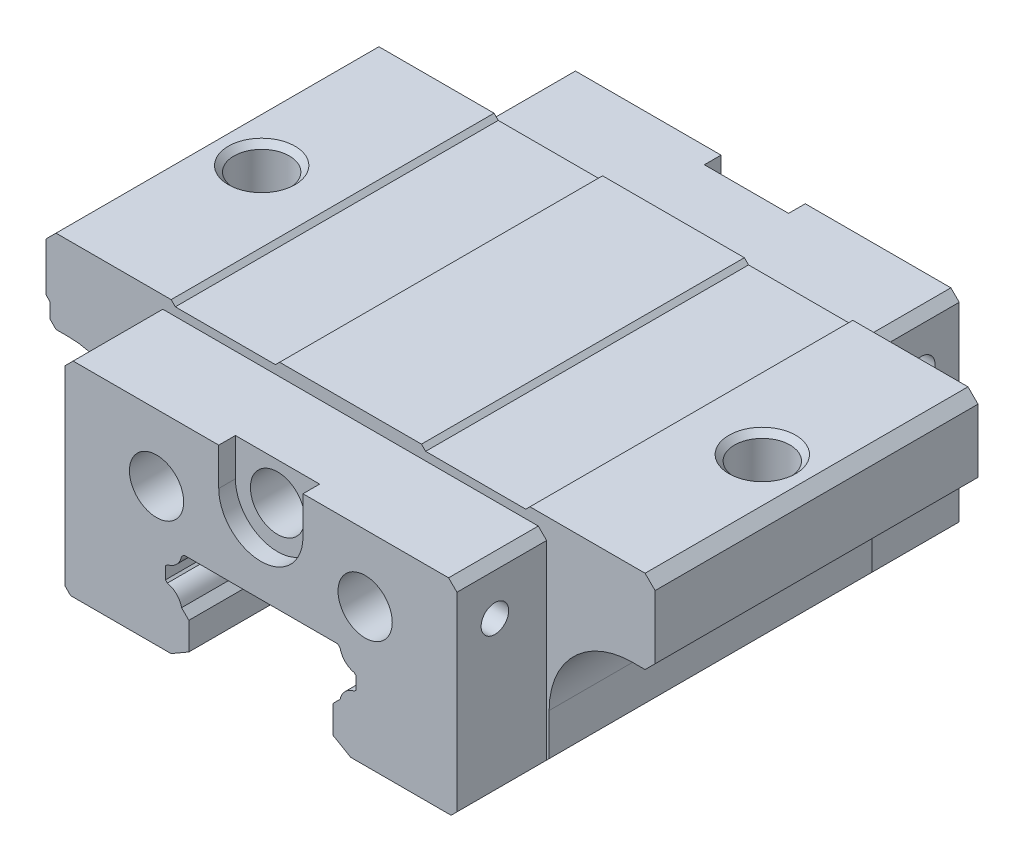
ISO-10303-21;
HEADER;
FILE_DESCRIPTION(('STEP AP214'),'2;1');
FILE_NAME('part.step','',(''),(''),'','','');
FILE_SCHEMA(('AUTOMOTIVE_DESIGN { 1 0 10303 214 1 1 1 1 }'));
ENDSEC;
DATA;
#1=APPLICATION_CONTEXT('core data for automotive mechanical design processes');
#2=APPLICATION_PROTOCOL_DEFINITION('international standard','automotive_design',2000,#1);
#3=PRODUCT_CONTEXT('',#1,'mechanical');
#4=PRODUCT('Part','Part','',(#3));
#5=PRODUCT_RELATED_PRODUCT_CATEGORY('part','',(#4));
#6=PRODUCT_DEFINITION_FORMATION('','',#4);
#7=PRODUCT_DEFINITION_CONTEXT('part definition',#1,'design');
#8=PRODUCT_DEFINITION('design','',#6,#7);
#9=PRODUCT_DEFINITION_SHAPE('','',#8);
#10=(LENGTH_UNIT() NAMED_UNIT(*) SI_UNIT(.MILLI.,.METRE.));
#11=(NAMED_UNIT(*) PLANE_ANGLE_UNIT() SI_UNIT($,.RADIAN.));
#12=(NAMED_UNIT(*) SI_UNIT($,.STERADIAN.) SOLID_ANGLE_UNIT());
#13=UNCERTAINTY_MEASURE_WITH_UNIT(LENGTH_MEASURE(1.E-05),#10,'distance_accuracy_value','');
#14=(GEOMETRIC_REPRESENTATION_CONTEXT(3) GLOBAL_UNCERTAINTY_ASSIGNED_CONTEXT((#13)) GLOBAL_UNIT_ASSIGNED_CONTEXT((#10,
#11,#12)) REPRESENTATION_CONTEXT('',''));
#15=CARTESIAN_POINT('',(0.,0.,0.));
#16=DIRECTION('',(0.,0.,1.));
#17=DIRECTION('',(1.,0.,0.));
#18=AXIS2_PLACEMENT_3D('',#15,#16,#17);
#19=CARTESIAN_POINT('',(-33.8,-20.,-60.2));
#20=DIRECTION('',(0.,0.,1.));
#21=DIRECTION('',(1.,0.,0.));
#22=AXIS2_PLACEMENT_3D('',#19,#20,#21);
#23=CYLINDRICAL_SURFACE('',#22,10.);
#24=CARTESIAN_POINT('',(-24.25,-17.0339200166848,-30.1000000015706));
#25=CARTESIAN_POINT('',(-24.2499998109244,-17.0339233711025,-30.0794525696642));
#26=CARTESIAN_POINT('',(-24.2501101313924,-17.0335706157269,-30.0589052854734));
#27=CARTESIAN_POINT('',(-24.250550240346,-17.0321596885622,-30.017854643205));
#28=CARTESIAN_POINT('',(-24.2508798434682,-17.0311021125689,-29.9973512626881));
#29=CARTESIAN_POINT('',(-24.2517573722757,-17.0282870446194,-29.9563785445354));
#30=CARTESIAN_POINT('',(-24.2523054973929,-17.0265289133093,-29.935909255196));
#31=CARTESIAN_POINT('',(-24.2536191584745,-17.0223195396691,-29.8949945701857));
#32=CARTESIAN_POINT('',(-24.2543852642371,-17.0198664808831,-29.874549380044));
#33=CARTESIAN_POINT('',(-24.2561345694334,-17.0142736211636,-29.8336727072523));
#34=CARTESIAN_POINT('',(-24.2571186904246,-17.011130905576,-29.8132416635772));
#35=CARTESIAN_POINT('',(-24.2593042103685,-17.0041651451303,-29.7723830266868));
#36=CARTESIAN_POINT('',(-24.2605068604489,-17.0003381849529,-29.7519561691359));
#37=CARTESIAN_POINT('',(-24.2631301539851,-16.9920100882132,-29.7110956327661));
#38=CARTESIAN_POINT('',(-24.2645523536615,-16.9875041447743,-29.6906630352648));
#39=CARTESIAN_POINT('',(-24.2676159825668,-16.9778246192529,-29.6497807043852));
#40=CARTESIAN_POINT('',(-24.2692592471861,-16.9726454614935,-29.6293324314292));
#41=CARTESIAN_POINT('',(-24.2727667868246,-16.9616240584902,-29.5884086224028));
#42=CARTESIAN_POINT('',(-24.2746331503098,-16.9557755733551,-29.5679349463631));
#43=CARTESIAN_POINT('',(-24.2785771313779,-16.9434644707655,-29.5270740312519));
#44=CARTESIAN_POINT('',(-24.2806558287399,-16.9369987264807,-29.5066878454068));
#45=CARTESIAN_POINT('',(-24.2870874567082,-16.9171456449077,-29.4467634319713));
#46=CARTESIAN_POINT('',(-24.2917195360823,-16.9030352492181,-29.4074917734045));
#47=CARTESIAN_POINT('',(-24.3015413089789,-16.8733352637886,-29.330898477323));
#48=CARTESIAN_POINT('',(-24.3067111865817,-16.8577997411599,-29.2935532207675));
#49=CARTESIAN_POINT('',(-24.3175389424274,-16.8254454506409,-29.2205299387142));
#50=CARTESIAN_POINT('',(-24.3231830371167,-16.8086639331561,-29.1848333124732));
#51=CARTESIAN_POINT('',(-24.3349155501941,-16.7739973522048,-29.114831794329));
#52=CARTESIAN_POINT('',(-24.3409947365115,-16.7561360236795,-29.080513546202));
#53=CARTESIAN_POINT('',(-24.353578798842,-16.7194955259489,-29.0129887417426));
#54=CARTESIAN_POINT('',(-24.3600778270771,-16.7007296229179,-28.979773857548));
#55=CARTESIAN_POINT('',(-24.373555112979,-16.6622885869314,-28.9139362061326));
#56=CARTESIAN_POINT('',(-24.3805337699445,-16.6426127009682,-28.8813139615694));
#57=CARTESIAN_POINT('',(-24.3950015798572,-16.6022834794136,-28.8164083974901));
#58=CARTESIAN_POINT('',(-24.4024944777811,-16.5816234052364,-28.7841301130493));
#59=CARTESIAN_POINT('',(-24.4257788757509,-16.5181427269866,-28.6875645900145));
#60=CARTESIAN_POINT('',(-24.4422460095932,-16.4741940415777,-28.6241782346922));
#61=CARTESIAN_POINT('',(-24.4769635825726,-16.383582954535,-28.4991215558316));
#62=CARTESIAN_POINT('',(-24.4952266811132,-16.3369023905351,-28.4374680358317));
#63=CARTESIAN_POINT('',(-24.5333480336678,-16.2415886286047,-28.3161095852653));
#64=CARTESIAN_POINT('',(-24.5532076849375,-16.1929537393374,-28.2564064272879));
#65=CARTESIAN_POINT('',(-24.594310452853,-16.0945033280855,-28.1391701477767));
#66=CARTESIAN_POINT('',(-24.6155439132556,-16.0446973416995,-28.0816255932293));
#67=CARTESIAN_POINT('',(-24.6591616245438,-15.94467777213,-27.9689094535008));
#68=CARTESIAN_POINT('',(-24.6815252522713,-15.8944800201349,-27.9137157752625));
#69=CARTESIAN_POINT('',(-24.7276144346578,-15.7934711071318,-27.8048025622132));
#70=CARTESIAN_POINT('',(-24.7513357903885,-15.7426621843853,-27.7510791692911));
#71=CARTESIAN_POINT('',(-24.8019849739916,-15.6364335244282,-27.6409156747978));
#72=CARTESIAN_POINT('',(-24.8290194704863,-15.5809569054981,-27.5845795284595));
#73=CARTESIAN_POINT('',(-24.8863809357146,-15.4661249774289,-27.4698374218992));
#74=CARTESIAN_POINT('',(-24.916808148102,-15.4067383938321,-27.4115129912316));
#75=CARTESIAN_POINT('',(-24.9806108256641,-15.2853852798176,-27.2941387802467));
#76=CARTESIAN_POINT('',(-25.0140534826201,-15.2234039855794,-27.2351408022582));
#77=CARTESIAN_POINT('',(-25.0833987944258,-15.0981914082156,-27.1176761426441));
#78=CARTESIAN_POINT('',(-25.1193316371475,-15.0349556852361,-27.0592320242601));
#79=CARTESIAN_POINT('',(-25.1930119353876,-14.9085636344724,-26.9440500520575));
#80=CARTESIAN_POINT('',(-25.230751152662,-14.8454080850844,-26.8873060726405));
#81=CARTESIAN_POINT('',(-25.3072489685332,-14.7205117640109,-26.776597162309));
#82=CARTESIAN_POINT('',(-25.345961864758,-14.6587731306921,-26.7225982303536));
#83=CARTESIAN_POINT('',(-25.4234742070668,-14.5380492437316,-26.6183421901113));
#84=CARTESIAN_POINT('',(-25.4621931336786,-14.4790637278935,-26.5680255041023));
#85=CARTESIAN_POINT('',(-25.5386661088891,-14.3651881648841,-26.4719826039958));
#86=CARTESIAN_POINT('',(-25.5763084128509,-14.3102908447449,-26.426176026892));
#87=CARTESIAN_POINT('',(-25.6507959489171,-14.2040721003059,-26.3383471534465));
#88=CARTESIAN_POINT('',(-25.6875499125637,-14.1527366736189,-26.2962643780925));
#89=CARTESIAN_POINT('',(-25.7623880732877,-14.0502913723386,-26.2130633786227));
#90=CARTESIAN_POINT('',(-25.8004718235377,-13.9991814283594,-26.1719448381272));
#91=CARTESIAN_POINT('',(-25.8780562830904,-13.8971385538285,-26.0906056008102));
#92=CARTESIAN_POINT('',(-25.9175592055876,-13.8462060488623,-26.0503864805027));
#93=CARTESIAN_POINT('',(-25.9979853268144,-13.7445715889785,-25.9708862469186));
#94=CARTESIAN_POINT('',(-26.038910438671,-13.6938700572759,-25.931606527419));
#95=CARTESIAN_POINT('',(-26.1221859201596,-13.5927542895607,-25.8540254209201));
#96=CARTESIAN_POINT('',(-26.1645379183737,-13.5423404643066,-25.8157252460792));
#97=CARTESIAN_POINT('',(-26.2506713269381,-13.4418560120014,-25.7401467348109));
#98=CARTESIAN_POINT('',(-26.294454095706,-13.3917857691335,-25.7028694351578));
#99=CARTESIAN_POINT('',(-26.3834528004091,-13.2920446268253,-25.6293826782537));
#100=CARTESIAN_POINT('',(-26.4286698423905,-13.2423740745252,-25.5931740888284));
#101=CARTESIAN_POINT('',(-26.5205400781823,-13.1434884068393,-25.5218735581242));
#102=CARTESIAN_POINT('',(-26.5671941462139,-13.0942735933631,-25.4867823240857));
#103=CARTESIAN_POINT('',(-26.6619404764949,-12.9963555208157,-25.4177681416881));
#104=CARTESIAN_POINT('',(-26.7100334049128,-12.947652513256,-25.3838457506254));
#105=CARTESIAN_POINT('',(-26.807658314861,-12.8508141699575,-25.3172238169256));
#106=CARTESIAN_POINT('',(-26.8571907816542,-12.8026790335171,-25.2845246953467));
#107=CARTESIAN_POINT('',(-26.957694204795,-12.7070325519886,-25.2204068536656));
#108=CARTESIAN_POINT('',(-27.008665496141,-12.6595213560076,-25.1889884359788));
#109=CARTESIAN_POINT('',(-27.1120443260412,-12.5651788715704,-25.1274926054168));
#110=CARTESIAN_POINT('',(-27.1644520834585,-12.5183476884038,-25.0974153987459));
#111=CARTESIAN_POINT('',(-27.2706996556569,-12.4254213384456,-25.0386656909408));
#112=CARTESIAN_POINT('',(-27.3245396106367,-12.379326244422,-25.0099933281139));
#113=CARTESIAN_POINT('',(-27.4336451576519,-12.2879281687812,-24.954120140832));
#114=CARTESIAN_POINT('',(-27.488910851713,-12.2426252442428,-24.9269194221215));
#115=CARTESIAN_POINT('',(-27.600858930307,-12.1528675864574,-24.874059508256));
#116=CARTESIAN_POINT('',(-27.657541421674,-12.108412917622,-24.8484004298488));
#117=CARTESIAN_POINT('',(-27.7723113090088,-12.0204078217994,-24.7986969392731));
#118=CARTESIAN_POINT('',(-27.830398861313,-11.9768574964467,-24.7746527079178));
#119=CARTESIAN_POINT('',(-27.9479639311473,-11.8907171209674,-24.7282551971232));
#120=CARTESIAN_POINT('',(-28.0074416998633,-11.8481272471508,-24.7059022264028));
#121=CARTESIAN_POINT('',(-28.1277687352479,-11.7639637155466,-24.6629666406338));
#122=CARTESIAN_POINT('',(-28.1886183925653,-11.7223903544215,-24.6423845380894));
#123=CARTESIAN_POINT('',(-28.3116669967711,-11.6403159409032,-24.6030731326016));
#124=CARTESIAN_POINT('',(-28.3738665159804,-11.5998153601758,-24.5843446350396));
#125=CARTESIAN_POINT('',(-28.4995880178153,-11.5199417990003,-24.5488259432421));
#126=CARTESIAN_POINT('',(-28.5631107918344,-11.4805695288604,-24.5320369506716));
#127=CARTESIAN_POINT('',(-28.6914488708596,-11.4030106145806,-24.5004853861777));
#128=CARTESIAN_POINT('',(-28.7562652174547,-11.3648249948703,-24.4857245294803));
#129=CARTESIAN_POINT('',(-28.8871568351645,-11.2896817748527,-24.4583196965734));
#130=CARTESIAN_POINT('',(-28.9532335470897,-11.2527257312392,-24.4456783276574));
#131=CARTESIAN_POINT('',(-29.0866458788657,-11.1800890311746,-24.4225995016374));
#132=CARTESIAN_POINT('',(-29.1539838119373,-11.1444111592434,-24.4121666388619));
#133=CARTESIAN_POINT('',(-29.2899206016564,-11.0743777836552,-24.3935994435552));
#134=CARTESIAN_POINT('',(-29.3585226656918,-11.040026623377,-24.3854721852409));
#135=CARTESIAN_POINT('',(-29.496983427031,-10.972692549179,-24.3716202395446));
#136=CARTESIAN_POINT('',(-29.5668460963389,-10.9397157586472,-24.3659054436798));
#137=CARTESIAN_POINT('',(-29.707817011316,-10.8751764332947,-24.3569918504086));
#138=CARTESIAN_POINT('',(-29.7789298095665,-10.8436220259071,-24.3538061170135));
#139=CARTESIAN_POINT('',(-29.9223816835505,-10.7819727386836,-24.3500734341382));
#140=CARTESIAN_POINT('',(-29.9947256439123,-10.7518882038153,-24.3495430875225));
#141=CARTESIAN_POINT('',(-30.1406119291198,-10.6932254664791,-24.3512532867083));
#142=CARTESIAN_POINT('',(-30.2141591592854,-10.66466004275,-24.3535143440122));
#143=CARTESIAN_POINT('',(-30.3624112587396,-10.609075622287,-24.3609483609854));
#144=CARTESIAN_POINT('',(-30.4371206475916,-10.5820719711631,-24.3661461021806));
#145=CARTESIAN_POINT('',(-30.5873494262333,-10.5297813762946,-24.3795769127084));
#146=CARTESIAN_POINT('',(-30.6628710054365,-10.504505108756,-24.3878271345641));
#147=CARTESIAN_POINT('',(-30.8142813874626,-10.4558476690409,-24.407436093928));
#148=CARTESIAN_POINT('',(-30.8901706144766,-10.4324701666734,-24.4188006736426));
#149=CARTESIAN_POINT('',(-31.0422523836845,-10.3875880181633,-24.4447209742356));
#150=CARTESIAN_POINT('',(-31.1184450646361,-10.3660901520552,-24.459287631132));
#151=CARTESIAN_POINT('',(-31.2710662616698,-10.3249545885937,-24.4917019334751));
#152=CARTESIAN_POINT('',(-31.3474940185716,-10.3053268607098,-24.5095658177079));
#153=CARTESIAN_POINT('',(-31.500506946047,-10.2679168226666,-24.5486708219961));
#154=CARTESIAN_POINT('',(-31.5770897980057,-10.25014761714,-24.5699335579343));
#155=CARTESIAN_POINT('',(-31.7301473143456,-10.2164766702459,-24.6158854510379));
#156=CARTESIAN_POINT('',(-31.8066187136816,-10.2005864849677,-24.6405939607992));
#157=CARTESIAN_POINT('',(-31.9586694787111,-10.1708274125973,-24.6932841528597));
#158=CARTESIAN_POINT('',(-32.0342501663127,-10.156955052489,-24.7212600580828));
#159=CARTESIAN_POINT('',(-32.1844076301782,-10.1311587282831,-24.7804724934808));
#160=CARTESIAN_POINT('',(-32.2589849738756,-10.1192336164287,-24.8117070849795));
#161=CARTESIAN_POINT('',(-32.4070984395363,-10.097245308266,-24.8774572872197));
#162=CARTESIAN_POINT('',(-32.4806327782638,-10.0871850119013,-24.911977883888));
#163=CARTESIAN_POINT('',(-32.6266139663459,-10.0688387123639,-24.984331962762));
#164=CARTESIAN_POINT('',(-32.6990559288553,-10.0605592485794,-25.0221769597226));
#165=CARTESIAN_POINT('',(-32.842795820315,-10.045687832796,-25.1012224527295));
#166=CARTESIAN_POINT('',(-32.9140850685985,-10.0391055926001,-25.1424405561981));
#167=CARTESIAN_POINT('',(-33.055450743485,-10.0275422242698,-25.2282846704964));
#168=CARTESIAN_POINT('',(-33.125514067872,-10.022573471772,-25.2729339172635));
#169=CARTESIAN_POINT('',(-33.2643454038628,-10.0141512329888,-25.3657012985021));
#170=CARTESIAN_POINT('',(-33.3330953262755,-10.0107122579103,-25.4138478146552));
#171=CARTESIAN_POINT('',(-33.4692007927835,-10.0052642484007,-25.513678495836));
#172=CARTESIAN_POINT('',(-33.5365327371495,-10.0032713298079,-25.5653957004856));
#173=CARTESIAN_POINT('',(-33.669688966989,-10.0006306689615,-25.6724410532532));
#174=CARTESIAN_POINT('',(-33.7354837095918,-10.0000001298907,-25.7278063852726));
#175=CARTESIAN_POINT('',(-33.8,-10.,-25.7846205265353));
#176=B_SPLINE_CURVE_WITH_KNOTS('',3,(#24,#25,#26,#27,#28,#29,#30,#31,#32,#33,#34,#35,#36,#37,
#38,#39,#40,#41,#42,#43,#44,#45,#46,#47,#48,#49,#50,#51,#52,#53,#54,#55,#56,#57,#58,#59,#60,#61,
#62,#63,#64,#65,#66,#67,#68,#69,#70,#71,#72,#73,#74,#75,#76,#77,#78,#79,#80,#81,#82,#83,#84,#85,
#86,#87,#88,#89,#90,#91,#92,#93,#94,#95,#96,#97,#98,#99,#100,#101,#102,#103,#104,#105,#106,#107,
#108,#109,#110,#111,#112,#113,#114,#115,#116,#117,#118,#119,#120,#121,#122,#123,#124,#125,#126,
#127,#128,#129,#130,#131,#132,#133,#134,#135,#136,#137,#138,#139,#140,#141,#142,#143,#144,#145,
#146,#147,#148,#149,#150,#151,#152,#153,#154,#155,#156,#157,#158,#159,#160,#161,#162,#163,#164,
#165,#166,#167,#168,#169,#170,#171,#172,#173,#174,#175),.UNSPECIFIED.,.F.,.F.,(4,2,2,2,2,2,2,2,
2,2,2,2,2,2,2,2,2,2,2,2,2,2,2,2,2,2,2,2,2,2,2,2,2,2,2,2,2,2,2,2,2,2,2,2,2,2,2,2,2,2,2,2,2,2,2,2,
2,2,2,2,2,2,2,2,2,2,2,2,2,2,2,2,2,2,2,4),(0.,0.0616386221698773,0.1232252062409,
0.184868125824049,0.246673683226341,0.308745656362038,0.371184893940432,0.434088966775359,
0.497551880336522,0.56166385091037,0.626119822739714,0.752013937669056,0.87429535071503,
0.993793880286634,1.11125203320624,1.22732868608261,1.34350317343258,1.46063856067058,
1.69714009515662,1.93544790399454,2.17396659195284,2.41096041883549,2.64458887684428,
2.87753022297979,3.12818018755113,3.39402341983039,3.66961307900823,3.94949231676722,
4.22819830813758,4.50026475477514,4.76022372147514,5.00260738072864,5.2302169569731,
5.45775077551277,5.68565630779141,5.91388128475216,6.14237621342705,6.37109477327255,
6.59999421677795,6.82903577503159,7.05818506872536,7.2874125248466,7.5166937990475,
7.74601020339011,7.97534913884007,8.20470453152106,8.43407727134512,8.66347565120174,
8.89291580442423,9.12242213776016,9.35202775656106,9.58177487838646,9.81171512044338,
10.0419361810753,10.2726315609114,10.5040273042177,10.7363628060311,10.969890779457,
11.2048770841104,11.4416004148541,11.6803518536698,11.9204657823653,12.1610332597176,
12.4024354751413,12.6450599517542,12.8892938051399,13.1349591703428,13.380196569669,
13.6252888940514,13.8707592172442,14.1171160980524,14.3648528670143,14.6144472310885,
14.8663611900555,15.1210412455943,15.37891887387),.UNSPECIFIED.);
#177=CARTESIAN_POINT('',(-24.250004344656,-17.0339206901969,-30.1000000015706));
#178=VERTEX_POINT('',#177);
#179=CARTESIAN_POINT('',(-33.8,-10.,-25.7846205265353));
#180=VERTEX_POINT('',#179);
#181=EDGE_CURVE('E446',#178,#180,#176,.T.);
#182=ORIENTED_EDGE('',*,*,#181,.F.);
#183=CARTESIAN_POINT('',(-33.8,-10.,-34.4153794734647));
#184=CARTESIAN_POINT('',(-33.7436145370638,-10.0000003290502,-34.4650325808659));
#185=CARTESIAN_POINT('',(-33.6862534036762,-10.0004785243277,-34.513579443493));
#186=CARTESIAN_POINT('',(-33.5706434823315,-10.0024662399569,-34.6076003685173));
#187=CARTESIAN_POINT('',(-33.5124248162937,-10.0039586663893,-34.653111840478));
#188=CARTESIAN_POINT('',(-33.3951906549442,-10.0080139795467,-34.7411716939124));
#189=CARTESIAN_POINT('',(-33.336200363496,-10.0105604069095,-34.7837543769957));
#190=CARTESIAN_POINT('',(-33.2174987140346,-10.0167629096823,-34.8660619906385));
#191=CARTESIAN_POINT('',(-33.1578079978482,-10.0204034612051,-34.9058178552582));
#192=CARTESIAN_POINT('',(-33.037765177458,-10.0288329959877,-34.9825707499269));
#193=CARTESIAN_POINT('',(-32.9774295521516,-10.0336077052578,-35.0195951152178));
#194=CARTESIAN_POINT('',(-32.8561425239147,-10.0443440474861,-35.0909768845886));
#195=CARTESIAN_POINT('',(-32.7952038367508,-10.0502929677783,-35.1253578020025));
#196=CARTESIAN_POINT('',(-32.672743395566,-10.0634159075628,-35.1915366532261));
#197=CARTESIAN_POINT('',(-32.6112310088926,-10.0705790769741,-35.2233540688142));
#198=CARTESIAN_POINT('',(-32.4876443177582,-10.0861683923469,-35.2844813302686));
#199=CARTESIAN_POINT('',(-32.4255764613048,-10.0945858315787,-35.3138064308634));
#200=CARTESIAN_POINT('',(-32.3008896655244,-10.1127213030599,-35.3700152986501));
#201=CARTESIAN_POINT('',(-32.2382746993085,-10.1224330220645,-35.3969099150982));
#202=CARTESIAN_POINT('',(-32.1124954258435,-10.1431943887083,-35.4483143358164));
#203=CARTESIAN_POINT('',(-32.0493330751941,-10.1542403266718,-35.4728304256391));
#204=CARTESIAN_POINT('',(-31.922452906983,-10.1777074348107,-35.5195240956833));
#205=CARTESIAN_POINT('',(-31.8587354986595,-10.1901276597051,-35.5417032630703));
#206=CARTESIAN_POINT('',(-31.7307323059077,-10.2163799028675,-35.5837587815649));
#207=CARTESIAN_POINT('',(-31.6664458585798,-10.2302138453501,-35.6036319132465));
#208=CARTESIAN_POINT('',(-31.5374765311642,-10.2592893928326,-35.6410446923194));
#209=CARTESIAN_POINT('',(-31.472793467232,-10.2745317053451,-35.6585831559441));
#210=CARTESIAN_POINT('',(-31.3433182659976,-10.3064082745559,-35.6912829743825));
#211=CARTESIAN_POINT('',(-31.2785266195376,-10.3230396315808,-35.7064491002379));
#212=CARTESIAN_POINT('',(-31.1488667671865,-10.3577187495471,-35.7344477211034));
#213=CARTESIAN_POINT('',(-31.083998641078,-10.3757655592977,-35.7472817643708));
#214=CARTESIAN_POINT('',(-30.9542121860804,-10.4133019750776,-35.7706551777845));
#215=CARTESIAN_POINT('',(-30.8892938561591,-10.4327926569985,-35.7811928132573));
#216=CARTESIAN_POINT('',(-30.7594291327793,-10.473241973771,-35.8000071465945));
#217=CARTESIAN_POINT('',(-30.6944829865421,-10.4942037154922,-35.8082788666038));
#218=CARTESIAN_POINT('',(-30.564588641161,-10.5376215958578,-35.8225889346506));
#219=CARTESIAN_POINT('',(-30.4996412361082,-10.5600827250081,-35.8286193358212));
#220=CARTESIAN_POINT('',(-30.3700402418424,-10.6064135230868,-35.8384489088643));
#221=CARTESIAN_POINT('',(-30.3053868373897,-10.6302839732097,-35.8422468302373));
#222=CARTESIAN_POINT('',(-30.1765752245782,-10.6793597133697,-35.8476492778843));
#223=CARTESIAN_POINT('',(-30.1124165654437,-10.7045635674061,-35.8492561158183));
#224=CARTESIAN_POINT('',(-29.9846521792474,-10.7562810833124,-35.850334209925));
#225=CARTESIAN_POINT('',(-29.9210461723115,-10.7827940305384,-35.8498066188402));
#226=CARTESIAN_POINT('',(-29.7944404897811,-10.8371035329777,-35.8466733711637));
#227=CARTESIAN_POINT('',(-29.7314407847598,-10.864900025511,-35.8440678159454));
#228=CARTESIAN_POINT('',(-29.6060975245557,-10.9217508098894,-35.8368356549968));
#229=CARTESIAN_POINT('',(-29.5437542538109,-10.9508056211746,-35.8322082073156));
#230=CARTESIAN_POINT('',(-29.4197701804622,-11.0101472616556,-35.8209886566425));
#231=CARTESIAN_POINT('',(-29.3581300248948,-11.0404351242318,-35.814394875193));
#232=CARTESIAN_POINT('',(-29.2355950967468,-11.1022170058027,-35.7992982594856));
#233=CARTESIAN_POINT('',(-29.1747013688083,-11.1337125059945,-35.7907930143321));
#234=CARTESIAN_POINT('',(-29.0537310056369,-11.1978677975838,-35.7719332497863));
#235=CARTESIAN_POINT('',(-28.993655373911,-11.2305288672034,-35.7615766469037));
#236=CARTESIAN_POINT('',(-28.8744740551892,-11.2969076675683,-35.7390927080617));
#237=CARTESIAN_POINT('',(-28.8153678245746,-11.3306247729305,-35.7269664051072));
#238=CARTESIAN_POINT('',(-28.6981693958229,-11.3990670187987,-35.7010121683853));
#239=CARTESIAN_POINT('',(-28.6400766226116,-11.4337915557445,-35.6871852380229));
#240=CARTESIAN_POINT('',(-28.5249330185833,-11.5042048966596,-35.6578957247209));
#241=CARTESIAN_POINT('',(-28.4678817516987,-11.5398932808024,-35.6424338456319));
#242=CARTESIAN_POINT('',(-28.3548460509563,-11.6121909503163,-35.6099388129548));
#243=CARTESIAN_POINT('',(-28.2988613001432,-11.6487999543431,-35.5929061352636));
#244=CARTESIAN_POINT('',(-28.187980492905,-11.7228954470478,-35.5573321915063));
#245=CARTESIAN_POINT('',(-28.1330842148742,-11.7603817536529,-35.5387912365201));
#246=CARTESIAN_POINT('',(-28.0243994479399,-11.836188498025,-35.5002616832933));
#247=CARTESIAN_POINT('',(-27.9706108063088,-11.8745088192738,-35.4802732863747));
#248=CARTESIAN_POINT('',(-27.8641578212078,-11.9519402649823,-35.4389080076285));
#249=CARTESIAN_POINT('',(-27.8114933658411,-11.9910513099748,-35.4175312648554));
#250=CARTESIAN_POINT('',(-27.7073028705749,-12.0700209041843,-35.37344663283));
#251=CARTESIAN_POINT('',(-27.6557767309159,-12.109879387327,-35.3507388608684));
#252=CARTESIAN_POINT('',(-27.5538747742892,-12.1903005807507,-35.3040476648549));
#253=CARTESIAN_POINT('',(-27.5034988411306,-12.2308632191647,-35.2800643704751));
#254=CARTESIAN_POINT('',(-27.403907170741,-12.3126494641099,-35.2308757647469));
#255=CARTESIAN_POINT('',(-27.3546912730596,-12.3538729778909,-35.2056706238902));
#256=CARTESIAN_POINT('',(-27.2574276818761,-12.4369377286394,-35.1540900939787));
#257=CARTESIAN_POINT('',(-27.2093797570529,-12.478778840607,-35.1277149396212));
#258=CARTESIAN_POINT('',(-27.1144584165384,-12.563035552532,-35.0738442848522));
#259=CARTESIAN_POINT('',(-27.0675846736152,-12.6054509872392,-35.0463491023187));
#260=CARTESIAN_POINT('',(-26.9750164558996,-12.6908131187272,-34.9902864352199));
#261=CARTESIAN_POINT('',(-26.9293215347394,-12.7337596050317,-34.9617193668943));
#262=CARTESIAN_POINT('',(-26.8391143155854,-12.8201406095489,-34.9035591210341));
#263=CARTESIAN_POINT('',(-26.7946014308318,-12.8635748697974,-34.8739664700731));
#264=CARTESIAN_POINT('',(-26.706760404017,-12.9508882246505,-34.8137994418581));
#265=CARTESIAN_POINT('',(-26.6634315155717,-12.9947670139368,-34.7832257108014));
#266=CARTESIAN_POINT('',(-26.5779594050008,-13.0829261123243,-34.7211390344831));
#267=CARTESIAN_POINT('',(-26.5358152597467,-13.127206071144,-34.6896268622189));
#268=CARTESIAN_POINT('',(-26.4527128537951,-13.2161246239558,-34.6257042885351));
#269=CARTESIAN_POINT('',(-26.4117534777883,-13.2607628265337,-34.593294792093));
#270=CARTESIAN_POINT('',(-26.3310186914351,-13.3503536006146,-34.5276157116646));
#271=CARTESIAN_POINT('',(-26.2912419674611,-13.3953057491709,-34.4943471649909));
#272=CARTESIAN_POINT('',(-26.21281688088,-13.485551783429,-34.426940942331));
#273=CARTESIAN_POINT('',(-26.1741686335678,-13.5308457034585,-34.3928031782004));
#274=CARTESIAN_POINT('',(-26.0979601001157,-13.6217814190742,-34.3236518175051));
#275=CARTESIAN_POINT('',(-26.0604009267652,-13.6674235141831,-34.2886373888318));
#276=CARTESIAN_POINT('',(-25.9863754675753,-13.7590061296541,-34.2177598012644));
#277=CARTESIAN_POINT('',(-25.9499099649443,-13.8049468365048,-34.1818960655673));
#278=CARTESIAN_POINT('',(-25.8780772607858,-13.8970782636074,-34.1093465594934));
#279=CARTESIAN_POINT('',(-25.8427105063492,-13.9432690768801,-34.0726604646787));
#280=CARTESIAN_POINT('',(-25.7730803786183,-14.0358519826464,-33.9984917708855));
#281=CARTESIAN_POINT('',(-25.7388171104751,-14.0822440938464,-33.9610090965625));
#282=CARTESIAN_POINT('',(-25.6713990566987,-14.1751809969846,-33.8852719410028));
#283=CARTESIAN_POINT('',(-25.638244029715,-14.2217257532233,-33.8470176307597));
#284=CARTESIAN_POINT('',(-25.5730474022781,-14.3149190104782,-33.7697607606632));
#285=CARTESIAN_POINT('',(-25.5410052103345,-14.3615674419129,-33.7307586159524));
#286=CARTESIAN_POINT('',(-25.478039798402,-14.4549202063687,-33.6520296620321));
#287=CARTESIAN_POINT('',(-25.4471156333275,-14.5016244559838,-33.6123035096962));
#288=CARTESIAN_POINT('',(-25.3862851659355,-14.5951980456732,-33.5320077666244));
#289=CARTESIAN_POINT('',(-25.3563813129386,-14.6420675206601,-33.4914364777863));
#290=CARTESIAN_POINT('',(-25.2962330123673,-14.7381615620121,-33.4075475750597));
#291=CARTESIAN_POINT('',(-25.26604409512,-14.7873886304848,-33.3641930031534));
#292=CARTESIAN_POINT('',(-25.2053066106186,-14.8883264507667,-33.274351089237));
#293=CARTESIAN_POINT('',(-25.1748203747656,-14.9400338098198,-33.2278177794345));
#294=CARTESIAN_POINT('',(-25.1140050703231,-15.0452323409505,-33.1319787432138));
#295=CARTESIAN_POINT('',(-25.0837253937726,-15.0987171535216,-33.0826346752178));
#296=CARTESIAN_POINT('',(-25.023797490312,-15.20676501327,-32.9815701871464));
#297=CARTESIAN_POINT('',(-24.9941847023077,-15.2613210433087,-32.9298212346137));
#298=CARTESIAN_POINT('',(-24.9360175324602,-15.3708043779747,-32.8243820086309));
#299=CARTESIAN_POINT('',(-24.9074837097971,-15.4257262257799,-32.7706747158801));
#300=CARTESIAN_POINT('',(-24.8518471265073,-15.5352320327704,-32.661790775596));
#301=CARTESIAN_POINT('',(-24.8247492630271,-15.5898143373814,-32.6066099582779));
#302=CARTESIAN_POINT('',(-24.7722977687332,-15.6979291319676,-32.4952845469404));
#303=CARTESIAN_POINT('',(-24.7469328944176,-15.7514663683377,-32.4391498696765));
#304=CARTESIAN_POINT('',(-24.6981976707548,-15.8567784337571,-32.3264533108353));
#305=CARTESIAN_POINT('',(-24.6747998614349,-15.9085676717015,-32.2699168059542));
#306=CARTESIAN_POINT('',(-24.6301818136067,-16.0096600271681,-32.1569716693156));
#307=CARTESIAN_POINT('',(-24.6089183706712,-16.0589918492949,-32.1006058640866));
#308=CARTESIAN_POINT('',(-24.5686914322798,-16.1544679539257,-31.9885940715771));
#309=CARTESIAN_POINT('',(-24.5496698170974,-16.2006606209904,-31.9330103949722));
#310=CARTESIAN_POINT('',(-24.5139630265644,-16.2890556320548,-31.8230947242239));
#311=CARTESIAN_POINT('',(-24.4972075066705,-16.331339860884,-31.7688517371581));
#312=CARTESIAN_POINT('',(-24.4651662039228,-16.4137781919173,-31.6592756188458));
#313=CARTESIAN_POINT('',(-24.4498669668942,-16.4539498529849,-31.6039596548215));
#314=CARTESIAN_POINT('',(-24.4201780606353,-16.5334203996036,-31.4898450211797));
#315=CARTESIAN_POINT('',(-24.4058294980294,-16.5726568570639,-31.4309916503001));
#316=CARTESIAN_POINT('',(-24.385341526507,-16.6295943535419,-31.3405977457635));
#317=CARTESIAN_POINT('',(-24.3786377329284,-16.6483894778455,-31.3098720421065));
#318=CARTESIAN_POINT('',(-24.3655944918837,-16.6852607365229,-31.2476036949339));
#319=CARTESIAN_POINT('',(-24.3592580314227,-16.7033306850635,-31.2160567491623));
#320=CARTESIAN_POINT('',(-24.3469917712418,-16.7385885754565,-31.1521698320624));
#321=CARTESIAN_POINT('',(-24.341064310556,-16.755771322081,-31.1198265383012));
#322=CARTESIAN_POINT('',(-24.3296580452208,-16.7890978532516,-31.0543740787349));
#323=CARTESIAN_POINT('',(-24.3241809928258,-16.8052375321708,-31.0212625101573));
#324=CARTESIAN_POINT('',(-24.3137157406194,-16.8363060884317,-30.9542963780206));
#325=CARTESIAN_POINT('',(-24.3087287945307,-16.8512318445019,-30.9204401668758));
#326=CARTESIAN_POINT('',(-24.299274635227,-16.8797871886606,-30.8519510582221));
#327=CARTESIAN_POINT('',(-24.2948095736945,-16.893411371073,-30.8173156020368));
#328=CARTESIAN_POINT('',(-24.286396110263,-16.9192727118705,-30.746919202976));
#329=CARTESIAN_POINT('',(-24.2824556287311,-16.9314882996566,-30.7111493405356));
#330=CARTESIAN_POINT('',(-24.2751094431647,-16.9543356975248,-30.6380606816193));
#331=CARTESIAN_POINT('',(-24.2717194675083,-16.9649205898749,-30.600725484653));
#332=CARTESIAN_POINT('',(-24.2671204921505,-16.9793660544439,-30.5438103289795));
#333=CARTESIAN_POINT('',(-24.2656535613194,-16.9839903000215,-30.5244417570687));
#334=CARTESIAN_POINT('',(-24.2629070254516,-16.9926758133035,-30.4855445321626));
#335=CARTESIAN_POINT('',(-24.2616276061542,-16.9967365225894,-30.4660157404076));
#336=CARTESIAN_POINT('',(-24.259275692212,-17.0042132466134,-30.4270491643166));
#337=CARTESIAN_POINT('',(-24.2582010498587,-17.0076359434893,-30.4076127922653));
#338=CARTESIAN_POINT('',(-24.2562549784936,-17.013844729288,-30.3688242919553));
#339=CARTESIAN_POINT('',(-24.2553816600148,-17.0166367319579,-30.3494732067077));
#340=CARTESIAN_POINT('',(-24.2538348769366,-17.0215882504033,-30.3108478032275));
#341=CARTESIAN_POINT('',(-24.2531597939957,-17.0237528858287,-30.2915742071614));
#342=CARTESIAN_POINT('',(-24.2520064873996,-17.0274549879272,-30.253096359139));
#343=CARTESIAN_POINT('',(-24.2515269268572,-17.0289967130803,-30.2338925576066));
#344=CARTESIAN_POINT('',(-24.250762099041,-17.0314578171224,-30.1955466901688));
#345=CARTESIAN_POINT('',(-24.2504757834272,-17.0323805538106,-30.1764048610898));
#346=CARTESIAN_POINT('',(-24.250095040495,-17.0336096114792,-30.1381753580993));
#347=CARTESIAN_POINT('',(-24.2499998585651,-17.0339183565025,-30.1190877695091));
#348=CARTESIAN_POINT('',(-24.25,-17.0339200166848,-30.1000000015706));
#349=B_SPLINE_CURVE_WITH_KNOTS('',3,(#183,#184,#185,#186,#187,#188,#189,#190,#191,#192,#193,
#194,#195,#196,#197,#198,#199,#200,#201,#202,#203,#204,#205,#206,#207,#208,#209,#210,#211,#212,
#213,#214,#215,#216,#217,#218,#219,#220,#221,#222,#223,#224,#225,#226,#227,#228,#229,#230,#231,
#232,#233,#234,#235,#236,#237,#238,#239,#240,#241,#242,#243,#244,#245,#246,#247,#248,#249,#250,
#251,#252,#253,#254,#255,#256,#257,#258,#259,#260,#261,#262,#263,#264,#265,#266,#267,#268,#269,
#270,#271,#272,#273,#274,#275,#276,#277,#278,#279,#280,#281,#282,#283,#284,#285,#286,#287,#288,
#289,#290,#291,#292,#293,#294,#295,#296,#297,#298,#299,#300,#301,#302,#303,#304,#305,#306,#307,
#308,#309,#310,#311,#312,#313,#314,#315,#316,#317,#318,#319,#320,#321,#322,#323,#324,#325,#326,
#327,#328,#329,#330,#331,#332,#333,#334,#335,#336,#337,#338,#339,#340,#341,#342,#343,#344,#345,
#346,#347,#348),.UNSPECIFIED.,.F.,.F.,(4,2,2,2,2,2,2,2,2,2,2,2,2,2,2,2,2,2,2,2,2,2,2,2,2,2,2,2,
2,2,2,2,2,2,2,2,2,2,2,2,2,2,2,2,2,2,2,2,2,2,2,2,2,2,2,2,2,2,2,2,2,2,2,2,2,2,2,2,2,2,2,2,2,2,2,2,
2,2,2,2,2,2,4),(0.,0.225380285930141,0.447053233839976,0.665387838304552,0.88076018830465,
1.09355354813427,1.30415831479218,1.51297184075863,1.72039811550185,1.92684730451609,
2.13273515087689,2.33848225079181,2.54451322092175,2.75064826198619,2.95636325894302,
3.16194117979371,3.36767385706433,3.57385493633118,3.78076023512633,3.98778131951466,
4.19458382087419,4.40127464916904,4.60795539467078,4.81472228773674,5.02166618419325,
5.22887257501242,5.43631363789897,5.64363409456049,5.85083280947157,6.05794268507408,
6.26499001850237,6.47199475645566,6.67897075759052,6.88592606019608,7.09286315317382,
7.29977924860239,7.50666655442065,7.71351254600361,7.92030023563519,8.12700843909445,
8.33361203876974,8.54008224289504,8.74638684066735,8.95249045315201,9.15835586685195,
9.36424224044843,9.57033205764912,9.77656609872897,9.98288298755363,10.1892194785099,
10.395510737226,10.6016906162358,10.807691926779,11.0141571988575,11.2307727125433,
11.4586055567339,11.6950404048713,11.9374659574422,12.1832774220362,12.429879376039,
12.67468942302,12.9151431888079,13.1487014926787,13.3728610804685,13.5851783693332,
13.7952911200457,14.0117130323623,14.1216096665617,14.2323014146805,14.3435811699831,
14.4552751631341,14.5672478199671,14.6796669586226,14.7936269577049,14.9104197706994,
14.9703129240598,15.0302650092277,15.0895487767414,15.1482511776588,15.2064601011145,
15.2642640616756,15.3217518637,15.3790122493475),.UNSPECIFIED.);
#350=CARTESIAN_POINT('',(-33.8,-10.,-34.4153794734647));
#351=VERTEX_POINT('',#350);
#352=EDGE_CURVE('E450',#351,#178,#349,.T.);
#353=ORIENTED_EDGE('',*,*,#352,.F.);
#354=DIRECTION('',(0.,0.,-1.));
#355=VECTOR('',#354,1.);
#356=CARTESIAN_POINT('',(-33.8,-10.,-34.4153794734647));
#357=LINE('',#356,#355);
#358=CARTESIAN_POINT('',(-33.8,-10.,-49.45));
#359=VERTEX_POINT('',#358);
#360=EDGE_CURVE('E463',#359,#351,#357,.F.);
#361=ORIENTED_EDGE('',*,*,#360,.F.);
#362=CARTESIAN_POINT('',(-33.8,-20.,-49.45));
#363=DIRECTION('',(0.,0.,-1.));
#364=DIRECTION('',(0.,1.,0.));
#365=AXIS2_PLACEMENT_3D('',#362,#363,#364);
#366=CIRCLE('',#365,10.);
#367=CARTESIAN_POINT('',(-23.8,-20.,-49.45));
#368=VERTEX_POINT('',#367);
#369=EDGE_CURVE('E1558',#359,#368,#366,.T.);
#370=ORIENTED_EDGE('',*,*,#369,.T.);
#371=DIRECTION('',(0.,0.,1.));
#372=VECTOR('',#371,1.);
#373=CARTESIAN_POINT('',(-23.8,-20.,-49.45));
#374=LINE('',#373,#372);
#375=CARTESIAN_POINT('',(-23.8,-20.,-10.75));
#376=VERTEX_POINT('',#375);
#377=EDGE_CURVE('E1563',#368,#376,#374,.T.);
#378=ORIENTED_EDGE('',*,*,#377,.T.);
#379=CARTESIAN_POINT('',(-33.8,-20.,-10.75));
#380=DIRECTION('',(0.,0.,1.));
#381=DIRECTION('',(1.,0.,0.));
#382=AXIS2_PLACEMENT_3D('',#379,#380,#381);
#383=CIRCLE('',#382,10.);
#384=CARTESIAN_POINT('',(-33.8,-10.,-10.75));
#385=VERTEX_POINT('',#384);
#386=EDGE_CURVE('E1568',#385,#376,#383,.F.);
#387=ORIENTED_EDGE('',*,*,#386,.F.);
#388=DIRECTION('',(0.,0.,-1.));
#389=VECTOR('',#388,1.);
#390=CARTESIAN_POINT('',(-33.8,-10.,-10.75));
#391=LINE('',#390,#389);
#392=EDGE_CURVE('E455',#180,#385,#391,.F.);
#393=ORIENTED_EDGE('',*,*,#392,.F.);
#394=EDGE_LOOP('',(#182,#353,#361,#370,#378,#387,#393));
#395=FACE_BOUND('',#394,.T.);
#396=ADVANCED_FACE('F17',(#395),#23,.F.);
#397=CARTESIAN_POINT('',(33.8000000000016,-20.0000000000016,-60.2));
#398=DIRECTION('',(0.,0.,1.));
#399=DIRECTION('',(-1.63807686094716E-13,1.,0.));
#400=AXIS2_PLACEMENT_3D('',#397,#398,#399);
#401=CYLINDRICAL_SURFACE('',#400,10.0000000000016);
#402=CARTESIAN_POINT('',(24.25,-17.0339200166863,-30.0999999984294));
#403=CARTESIAN_POINT('',(24.2499998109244,-17.033923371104,-30.1205474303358));
#404=CARTESIAN_POINT('',(24.2501101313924,-17.0335706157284,-30.1410947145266));
#405=CARTESIAN_POINT('',(24.250550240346,-17.0321596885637,-30.182145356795));
#406=CARTESIAN_POINT('',(24.2508798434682,-17.0311021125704,-30.2026487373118));
#407=CARTESIAN_POINT('',(24.2517573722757,-17.0282870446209,-30.2436214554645));
#408=CARTESIAN_POINT('',(24.2523054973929,-17.0265289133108,-30.2640907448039));
#409=CARTESIAN_POINT('',(24.2536191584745,-17.0223195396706,-30.3050054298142));
#410=CARTESIAN_POINT('',(24.2543852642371,-17.0198664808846,-30.3254506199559));
#411=CARTESIAN_POINT('',(24.2561345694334,-17.0142736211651,-30.3663272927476));
#412=CARTESIAN_POINT('',(24.2571186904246,-17.0111309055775,-30.3867583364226));
#413=CARTESIAN_POINT('',(24.2593042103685,-17.0041651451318,-30.427616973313));
#414=CARTESIAN_POINT('',(24.2605068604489,-17.0003381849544,-30.4480438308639));
#415=CARTESIAN_POINT('',(24.2631301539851,-16.9920100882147,-30.4889043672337));
#416=CARTESIAN_POINT('',(24.2645523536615,-16.9875041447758,-30.509336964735));
#417=CARTESIAN_POINT('',(24.2676159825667,-16.9778246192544,-30.5502192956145));
#418=CARTESIAN_POINT('',(24.2692592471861,-16.972645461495,-30.5706675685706));
#419=CARTESIAN_POINT('',(24.2727667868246,-16.9616240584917,-30.6115913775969));
#420=CARTESIAN_POINT('',(24.2746331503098,-16.9557755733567,-30.6320650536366));
#421=CARTESIAN_POINT('',(24.2785771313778,-16.943464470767,-30.6729259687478));
#422=CARTESIAN_POINT('',(24.2806558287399,-16.9369987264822,-30.6933121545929));
#423=CARTESIAN_POINT('',(24.2870874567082,-16.9171456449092,-30.7532365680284));
#424=CARTESIAN_POINT('',(24.2917195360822,-16.9030352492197,-30.7925082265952));
#425=CARTESIAN_POINT('',(24.3015413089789,-16.8733352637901,-30.8691015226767));
#426=CARTESIAN_POINT('',(24.3067111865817,-16.8577997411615,-30.9064467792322));
#427=CARTESIAN_POINT('',(24.3175389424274,-16.8254454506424,-30.9794700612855));
#428=CARTESIAN_POINT('',(24.3231830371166,-16.8086639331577,-31.0151666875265));
#429=CARTESIAN_POINT('',(24.3349155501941,-16.7739973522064,-31.0851682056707));
#430=CARTESIAN_POINT('',(24.3409947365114,-16.7561360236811,-31.1194864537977));
#431=CARTESIAN_POINT('',(24.3535787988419,-16.7194955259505,-31.1870112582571));
#432=CARTESIAN_POINT('',(24.360077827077,-16.7007296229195,-31.2202261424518));
#433=CARTESIAN_POINT('',(24.373555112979,-16.662288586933,-31.2860637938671));
#434=CARTESIAN_POINT('',(24.3805337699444,-16.6426127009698,-31.3186860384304));
#435=CARTESIAN_POINT('',(24.3950015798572,-16.6022834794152,-31.3835916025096));
#436=CARTESIAN_POINT('',(24.402494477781,-16.581623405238,-31.4158698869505));
#437=CARTESIAN_POINT('',(24.4257788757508,-16.5181427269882,-31.5124354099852));
#438=CARTESIAN_POINT('',(24.4422460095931,-16.4741940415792,-31.5758217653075));
#439=CARTESIAN_POINT('',(24.4769635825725,-16.3835829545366,-31.7008784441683));
#440=CARTESIAN_POINT('',(24.4952266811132,-16.3369023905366,-31.7625319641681));
#441=CARTESIAN_POINT('',(24.5333480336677,-16.2415886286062,-31.8838904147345));
#442=CARTESIAN_POINT('',(24.5532076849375,-16.1929537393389,-31.943593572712));
#443=CARTESIAN_POINT('',(24.594310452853,-16.094503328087,-32.0608298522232));
#444=CARTESIAN_POINT('',(24.6155439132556,-16.0446973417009,-32.1183744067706));
#445=CARTESIAN_POINT('',(24.6591616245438,-15.9446777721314,-32.2310905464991));
#446=CARTESIAN_POINT('',(24.6815252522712,-15.8944800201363,-32.2862842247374));
#447=CARTESIAN_POINT('',(24.7276144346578,-15.7934711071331,-32.3951974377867));
#448=CARTESIAN_POINT('',(24.7513357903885,-15.7426621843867,-32.4489208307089));
#449=CARTESIAN_POINT('',(24.8019849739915,-15.6364335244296,-32.5590843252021));
#450=CARTESIAN_POINT('',(24.8290194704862,-15.5809569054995,-32.6154204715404));
#451=CARTESIAN_POINT('',(24.8863809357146,-15.4661249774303,-32.7301625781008));
#452=CARTESIAN_POINT('',(24.916808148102,-15.4067383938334,-32.7884870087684));
#453=CARTESIAN_POINT('',(24.9806108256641,-15.2853852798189,-32.9058612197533));
#454=CARTESIAN_POINT('',(25.0140534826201,-15.2234039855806,-32.9648591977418));
#455=CARTESIAN_POINT('',(25.0833987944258,-15.0981914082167,-33.082323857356));
#456=CARTESIAN_POINT('',(25.1193316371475,-15.0349556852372,-33.14076797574));
#457=CARTESIAN_POINT('',(25.1930119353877,-14.9085636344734,-33.2559499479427));
#458=CARTESIAN_POINT('',(25.2307511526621,-14.8454080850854,-33.3126939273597));
#459=CARTESIAN_POINT('',(25.3072489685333,-14.7205117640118,-33.4234028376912));
#460=CARTESIAN_POINT('',(25.3459618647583,-14.6587731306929,-33.4774017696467));
#461=CARTESIAN_POINT('',(25.4234742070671,-14.5380492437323,-33.581657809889));
#462=CARTESIAN_POINT('',(25.4621931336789,-14.4790637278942,-33.6319744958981));
#463=CARTESIAN_POINT('',(25.5386661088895,-14.3651881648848,-33.7280173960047));
#464=CARTESIAN_POINT('',(25.5763084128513,-14.3102908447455,-33.7738239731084));
#465=CARTESIAN_POINT('',(25.6507959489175,-14.2040721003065,-33.861652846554));
#466=CARTESIAN_POINT('',(25.6875499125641,-14.1527366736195,-33.903735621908));
#467=CARTESIAN_POINT('',(25.7623880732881,-14.0502913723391,-33.9869366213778));
#468=CARTESIAN_POINT('',(25.8004718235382,-13.99918142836,-34.0280551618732));
#469=CARTESIAN_POINT('',(25.8780562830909,-13.8971385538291,-34.1093943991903));
#470=CARTESIAN_POINT('',(25.917559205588,-13.8462060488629,-34.1496135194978));
#471=CARTESIAN_POINT('',(25.9979853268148,-13.744571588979,-34.2291137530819));
#472=CARTESIAN_POINT('',(26.0389104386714,-13.6938700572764,-34.2683934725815));
#473=CARTESIAN_POINT('',(26.1221859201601,-13.5927542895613,-34.3459745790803));
#474=CARTESIAN_POINT('',(26.1645379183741,-13.5423404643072,-34.3842747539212));
#475=CARTESIAN_POINT('',(26.2506713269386,-13.4418560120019,-34.4598532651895));
#476=CARTESIAN_POINT('',(26.2944540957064,-13.3917857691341,-34.4971305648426));
#477=CARTESIAN_POINT('',(26.3834528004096,-13.2920446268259,-34.5706173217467));
#478=CARTESIAN_POINT('',(26.4286698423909,-13.2423740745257,-34.6068259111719));
#479=CARTESIAN_POINT('',(26.5205400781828,-13.1434884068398,-34.6781264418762));
#480=CARTESIAN_POINT('',(26.5671941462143,-13.0942735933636,-34.7132176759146));
#481=CARTESIAN_POINT('',(26.6619404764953,-12.9963555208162,-34.7822318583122));
#482=CARTESIAN_POINT('',(26.7100334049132,-12.9476525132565,-34.8161542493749));
#483=CARTESIAN_POINT('',(26.8076583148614,-12.850814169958,-34.8827761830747));
#484=CARTESIAN_POINT('',(26.8571907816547,-12.8026790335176,-34.9154753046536));
#485=CARTESIAN_POINT('',(26.9576942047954,-12.7070325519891,-34.9795931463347));
#486=CARTESIAN_POINT('',(27.0086654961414,-12.6595213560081,-35.0110115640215));
#487=CARTESIAN_POINT('',(27.1120443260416,-12.5651788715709,-35.0725073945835));
#488=CARTESIAN_POINT('',(27.1644520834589,-12.5183476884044,-35.1025846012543));
#489=CARTESIAN_POINT('',(27.2706996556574,-12.4254213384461,-35.1613343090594));
#490=CARTESIAN_POINT('',(27.3245396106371,-12.3793262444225,-35.1900066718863));
#491=CARTESIAN_POINT('',(27.4336451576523,-12.2879281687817,-35.2458798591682));
#492=CARTESIAN_POINT('',(27.4889108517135,-12.2426252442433,-35.2730805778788));
#493=CARTESIAN_POINT('',(27.6008589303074,-12.1528675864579,-35.3259404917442));
#494=CARTESIAN_POINT('',(27.6575414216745,-12.1084129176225,-35.3515995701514));
#495=CARTESIAN_POINT('',(27.7723113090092,-12.0204078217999,-35.4013030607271));
#496=CARTESIAN_POINT('',(27.8303988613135,-11.9768574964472,-35.4253472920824));
#497=CARTESIAN_POINT('',(27.9479639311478,-11.8907171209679,-35.471744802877));
#498=CARTESIAN_POINT('',(28.0074416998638,-11.8481272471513,-35.4940977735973));
#499=CARTESIAN_POINT('',(28.1277687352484,-11.763963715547,-35.5370333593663));
#500=CARTESIAN_POINT('',(28.1886183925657,-11.722390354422,-35.5576154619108));
#501=CARTESIAN_POINT('',(28.3116669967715,-11.6403159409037,-35.5969268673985));
#502=CARTESIAN_POINT('',(28.3738665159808,-11.5998153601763,-35.6156553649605));
#503=CARTESIAN_POINT('',(28.4995880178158,-11.5199417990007,-35.651174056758));
#504=CARTESIAN_POINT('',(28.5631107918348,-11.4805695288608,-35.6679630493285));
#505=CARTESIAN_POINT('',(28.69144887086,-11.403010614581,-35.6995146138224));
#506=CARTESIAN_POINT('',(28.7562652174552,-11.3648249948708,-35.7142754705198));
#507=CARTESIAN_POINT('',(28.887156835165,-11.2896817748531,-35.7416803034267));
#508=CARTESIAN_POINT('',(28.9532335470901,-11.2527257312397,-35.7543216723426));
#509=CARTESIAN_POINT('',(29.0866458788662,-11.180089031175,-35.7774004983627));
#510=CARTESIAN_POINT('',(29.1539838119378,-11.1444111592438,-35.7878333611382));
#511=CARTESIAN_POINT('',(29.2899206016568,-11.0743777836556,-35.8064005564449));
#512=CARTESIAN_POINT('',(29.3585226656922,-11.0400266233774,-35.8145278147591));
#513=CARTESIAN_POINT('',(29.4969834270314,-10.9726925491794,-35.8283797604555));
#514=CARTESIAN_POINT('',(29.5668460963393,-10.9397157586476,-35.8340945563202));
#515=CARTESIAN_POINT('',(29.7078170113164,-10.8751764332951,-35.8430081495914));
#516=CARTESIAN_POINT('',(29.7789298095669,-10.8436220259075,-35.8461938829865));
#517=CARTESIAN_POINT('',(29.922381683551,-10.781972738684,-35.8499265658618));
#518=CARTESIAN_POINT('',(29.9947256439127,-10.7518882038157,-35.8504569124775));
#519=CARTESIAN_POINT('',(30.1406119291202,-10.6932254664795,-35.8487467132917));
#520=CARTESIAN_POINT('',(30.2141591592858,-10.6646600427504,-35.8464856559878));
#521=CARTESIAN_POINT('',(30.36241125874,-10.6090756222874,-35.8390516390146));
#522=CARTESIAN_POINT('',(30.437120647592,-10.5820719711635,-35.8338538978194));
#523=CARTESIAN_POINT('',(30.5873494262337,-10.5297813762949,-35.8204230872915));
#524=CARTESIAN_POINT('',(30.6628710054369,-10.5045051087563,-35.8121728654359));
#525=CARTESIAN_POINT('',(30.8142813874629,-10.4558476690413,-35.7925639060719));
#526=CARTESIAN_POINT('',(30.890170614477,-10.4324701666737,-35.7811993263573));
#527=CARTESIAN_POINT('',(31.0422523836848,-10.3875880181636,-35.7552790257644));
#528=CARTESIAN_POINT('',(31.1184450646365,-10.3660901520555,-35.740712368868));
#529=CARTESIAN_POINT('',(31.2710662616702,-10.324954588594,-35.7082980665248));
#530=CARTESIAN_POINT('',(31.347494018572,-10.3053268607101,-35.690434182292));
#531=CARTESIAN_POINT('',(31.5005069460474,-10.2679168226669,-35.6513291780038));
#532=CARTESIAN_POINT('',(31.5770897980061,-10.2501476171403,-35.6300664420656));
#533=CARTESIAN_POINT('',(31.7301473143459,-10.2164766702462,-35.584114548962));
#534=CARTESIAN_POINT('',(31.8066187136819,-10.200586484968,-35.5594060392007));
#535=CARTESIAN_POINT('',(31.9586694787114,-10.1708274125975,-35.5067158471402));
#536=CARTESIAN_POINT('',(32.034250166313,-10.1569550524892,-35.4787399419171));
#537=CARTESIAN_POINT('',(32.1844076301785,-10.1311587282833,-35.419527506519));
#538=CARTESIAN_POINT('',(32.2589849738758,-10.1192336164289,-35.3882929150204));
#539=CARTESIAN_POINT('',(32.4070984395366,-10.0972453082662,-35.3225427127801));
#540=CARTESIAN_POINT('',(32.480632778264,-10.0871850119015,-35.2880221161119));
#541=CARTESIAN_POINT('',(32.6266139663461,-10.0688387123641,-35.2156680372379));
#542=CARTESIAN_POINT('',(32.6990559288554,-10.0605592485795,-35.1778230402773));
#543=CARTESIAN_POINT('',(32.8427958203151,-10.0456878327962,-35.0987775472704));
#544=CARTESIAN_POINT('',(32.9140850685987,-10.0391055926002,-35.0575594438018));
#545=CARTESIAN_POINT('',(33.0554507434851,-10.0275422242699,-34.9717153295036));
#546=CARTESIAN_POINT('',(33.1255140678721,-10.0225734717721,-34.9270660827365));
#547=CARTESIAN_POINT('',(33.2643454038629,-10.0141512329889,-34.8342987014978));
#548=CARTESIAN_POINT('',(33.3330953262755,-10.0107122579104,-34.7861521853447));
#549=CARTESIAN_POINT('',(33.4692007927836,-10.0052642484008,-34.6863215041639));
#550=CARTESIAN_POINT('',(33.5365327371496,-10.003271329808,-34.6346042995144));
#551=CARTESIAN_POINT('',(33.669688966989,-10.0006306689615,-34.5275589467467));
#552=CARTESIAN_POINT('',(33.7354837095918,-10.0000001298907,-34.4721936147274));
#553=CARTESIAN_POINT('',(33.8,-10.,-34.4153794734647));
#554=B_SPLINE_CURVE_WITH_KNOTS('',3,(#402,#403,#404,#405,#406,#407,#408,#409,#410,#411,#412,
#413,#414,#415,#416,#417,#418,#419,#420,#421,#422,#423,#424,#425,#426,#427,#428,#429,#430,#431,
#432,#433,#434,#435,#436,#437,#438,#439,#440,#441,#442,#443,#444,#445,#446,#447,#448,#449,#450,
#451,#452,#453,#454,#455,#456,#457,#458,#459,#460,#461,#462,#463,#464,#465,#466,#467,#468,#469,
#470,#471,#472,#473,#474,#475,#476,#477,#478,#479,#480,#481,#482,#483,#484,#485,#486,#487,#488,
#489,#490,#491,#492,#493,#494,#495,#496,#497,#498,#499,#500,#501,#502,#503,#504,#505,#506,#507,
#508,#509,#510,#511,#512,#513,#514,#515,#516,#517,#518,#519,#520,#521,#522,#523,#524,#525,#526,
#527,#528,#529,#530,#531,#532,#533,#534,#535,#536,#537,#538,#539,#540,#541,#542,#543,#544,#545,
#546,#547,#548,#549,#550,#551,#552,#553),.UNSPECIFIED.,.F.,.F.,(4,2,2,2,2,2,2,2,2,2,2,2,2,2,2,2,
2,2,2,2,2,2,2,2,2,2,2,2,2,2,2,2,2,2,2,2,2,2,2,2,2,2,2,2,2,2,2,2,2,2,2,2,2,2,2,2,2,2,2,2,2,2,2,2,
2,2,2,2,2,2,2,2,2,2,2,4),(0.,0.0616386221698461,0.123225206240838,0.184868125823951,
0.246673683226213,0.308745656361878,0.371184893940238,0.434088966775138,0.497551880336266,
0.561663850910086,0.626119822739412,0.752013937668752,0.874295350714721,0.993793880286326,
1.11125203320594,1.22732868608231,1.34350317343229,1.46063856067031,1.6971400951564,
1.93544790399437,2.17396659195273,2.41096041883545,2.64458887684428,2.87753022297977,
3.12818018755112,3.39402341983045,3.66961307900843,3.94949231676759,4.22819830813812,
4.50026475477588,4.76022372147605,5.00260738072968,5.23021695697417,5.45775077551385,
5.68565630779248,5.91388128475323,6.14237621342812,6.37109477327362,6.59999421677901,
6.82903577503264,7.0581850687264,7.28741252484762,7.51669379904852,7.74601020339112,
7.97534913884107,8.20470453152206,8.43407727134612,8.66347565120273,8.89291580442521,
9.12242213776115,9.35202775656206,9.58177487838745,9.81171512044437,10.0419361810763,
10.2726315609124,10.5040273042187,10.7363628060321,10.969890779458,11.2048770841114,
11.441600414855,11.6803518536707,11.9204657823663,12.1610332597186,12.4024354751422,
12.6450599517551,12.8892938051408,13.1349591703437,13.3801965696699,13.6252888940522,
13.8707592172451,14.1171160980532,14.3648528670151,14.6144472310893,14.8663611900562,
15.121041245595,15.3789188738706),.UNSPECIFIED.);
#555=CARTESIAN_POINT('',(24.250004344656,-17.0339206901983,-30.0999999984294));
#556=VERTEX_POINT('',#555);
#557=CARTESIAN_POINT('',(33.8,-10.,-34.4153794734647));
#558=VERTEX_POINT('',#557);
#559=EDGE_CURVE('E521',#556,#558,#554,.T.);
#560=ORIENTED_EDGE('',*,*,#559,.F.);
#561=CARTESIAN_POINT('',(33.8,-10.,-25.7846205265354));
#562=CARTESIAN_POINT('',(33.7436145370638,-10.0000003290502,-25.7349674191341));
#563=CARTESIAN_POINT('',(33.6862534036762,-10.0004785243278,-25.686420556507));
#564=CARTESIAN_POINT('',(33.5706434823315,-10.002466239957,-25.5923996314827));
#565=CARTESIAN_POINT('',(33.5124248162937,-10.0039586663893,-25.546888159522));
#566=CARTESIAN_POINT('',(33.3951906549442,-10.0080139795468,-25.4588283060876));
#567=CARTESIAN_POINT('',(33.336200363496,-10.0105604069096,-25.4162456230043));
#568=CARTESIAN_POINT('',(33.2174987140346,-10.0167629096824,-25.3339380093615));
#569=CARTESIAN_POINT('',(33.1578079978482,-10.0204034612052,-25.2941821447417));
#570=CARTESIAN_POINT('',(33.0377651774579,-10.0288329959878,-25.2174292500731));
#571=CARTESIAN_POINT('',(32.9774295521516,-10.0336077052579,-25.1804048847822));
#572=CARTESIAN_POINT('',(32.8561425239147,-10.0443440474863,-25.1090231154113));
#573=CARTESIAN_POINT('',(32.7952038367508,-10.0502929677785,-25.0746421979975));
#574=CARTESIAN_POINT('',(32.6727433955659,-10.063415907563,-25.0084633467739));
#575=CARTESIAN_POINT('',(32.6112310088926,-10.0705790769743,-24.9766459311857));
#576=CARTESIAN_POINT('',(32.4876443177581,-10.0861683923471,-24.9155186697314));
#577=CARTESIAN_POINT('',(32.4255764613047,-10.0945858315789,-24.8861935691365));
#578=CARTESIAN_POINT('',(32.3008896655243,-10.1127213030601,-24.8299847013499));
#579=CARTESIAN_POINT('',(32.2382746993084,-10.1224330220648,-24.8030900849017));
#580=CARTESIAN_POINT('',(32.1124954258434,-10.1431943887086,-24.7516856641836));
#581=CARTESIAN_POINT('',(32.049333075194,-10.1542403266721,-24.7271695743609));
#582=CARTESIAN_POINT('',(31.9224529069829,-10.177707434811,-24.6804759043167));
#583=CARTESIAN_POINT('',(31.8587354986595,-10.1901276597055,-24.6582967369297));
#584=CARTESIAN_POINT('',(31.7307323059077,-10.2163799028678,-24.6162412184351));
#585=CARTESIAN_POINT('',(31.6664458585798,-10.2302138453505,-24.5963680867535));
#586=CARTESIAN_POINT('',(31.5374765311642,-10.259289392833,-24.5589553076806));
#587=CARTESIAN_POINT('',(31.472793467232,-10.2745317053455,-24.5414168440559));
#588=CARTESIAN_POINT('',(31.3433182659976,-10.3064082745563,-24.5087170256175));
#589=CARTESIAN_POINT('',(31.2785266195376,-10.3230396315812,-24.4935508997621));
#590=CARTESIAN_POINT('',(31.1488667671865,-10.3577187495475,-24.4655522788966));
#591=CARTESIAN_POINT('',(31.0839986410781,-10.3757655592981,-24.4527182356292));
#592=CARTESIAN_POINT('',(30.9542121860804,-10.413301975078,-24.4293448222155));
#593=CARTESIAN_POINT('',(30.8892938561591,-10.4327926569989,-24.4188071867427));
#594=CARTESIAN_POINT('',(30.7594291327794,-10.4732419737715,-24.3999928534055));
#595=CARTESIAN_POINT('',(30.6944829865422,-10.4942037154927,-24.3917211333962));
#596=CARTESIAN_POINT('',(30.564588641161,-10.5376215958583,-24.3774110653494));
#597=CARTESIAN_POINT('',(30.4996412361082,-10.5600827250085,-24.3713806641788));
#598=CARTESIAN_POINT('',(30.3700402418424,-10.6064135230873,-24.3615510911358));
#599=CARTESIAN_POINT('',(30.3053868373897,-10.6302839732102,-24.3577531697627));
#600=CARTESIAN_POINT('',(30.1765752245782,-10.6793597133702,-24.3523507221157));
#601=CARTESIAN_POINT('',(30.1124165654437,-10.7045635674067,-24.3507438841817));
#602=CARTESIAN_POINT('',(29.9846521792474,-10.7562810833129,-24.349665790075));
#603=CARTESIAN_POINT('',(29.9210461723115,-10.7827940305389,-24.3501933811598));
#604=CARTESIAN_POINT('',(29.7944404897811,-10.8371035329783,-24.3533266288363));
#605=CARTESIAN_POINT('',(29.7314407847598,-10.8649000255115,-24.3559321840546));
#606=CARTESIAN_POINT('',(29.6060975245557,-10.92175080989,-24.3631643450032));
#607=CARTESIAN_POINT('',(29.543754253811,-10.9508056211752,-24.3677917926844));
#608=CARTESIAN_POINT('',(29.4197701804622,-11.0101472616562,-24.3790113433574));
#609=CARTESIAN_POINT('',(29.3581300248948,-11.0404351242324,-24.385605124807));
#610=CARTESIAN_POINT('',(29.2355950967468,-11.1022170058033,-24.4007017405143));
#611=CARTESIAN_POINT('',(29.1747013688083,-11.1337125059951,-24.4092069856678));
#612=CARTESIAN_POINT('',(29.0537310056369,-11.1978677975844,-24.4280667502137));
#613=CARTESIAN_POINT('',(28.9936553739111,-11.2305288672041,-24.4384233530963));
#614=CARTESIAN_POINT('',(28.8744740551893,-11.296907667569,-24.4609072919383));
#615=CARTESIAN_POINT('',(28.8153678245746,-11.3306247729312,-24.4730335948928));
#616=CARTESIAN_POINT('',(28.698169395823,-11.3990670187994,-24.4989878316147));
#617=CARTESIAN_POINT('',(28.6400766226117,-11.4337915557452,-24.5128147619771));
#618=CARTESIAN_POINT('',(28.5249330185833,-11.5042048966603,-24.542104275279));
#619=CARTESIAN_POINT('',(28.4678817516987,-11.5398932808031,-24.5575661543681));
#620=CARTESIAN_POINT('',(28.3548460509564,-11.612190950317,-24.5900611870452));
#621=CARTESIAN_POINT('',(28.2988613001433,-11.6487999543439,-24.6070938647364));
#622=CARTESIAN_POINT('',(28.187980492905,-11.7228954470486,-24.6426678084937));
#623=CARTESIAN_POINT('',(28.1330842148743,-11.7603817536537,-24.6612087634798));
#624=CARTESIAN_POINT('',(28.02439944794,-11.8361884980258,-24.6997383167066));
#625=CARTESIAN_POINT('',(27.9706108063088,-11.8745088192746,-24.7197267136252));
#626=CARTESIAN_POINT('',(27.8641578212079,-11.951940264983,-24.7610919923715));
#627=CARTESIAN_POINT('',(27.8114933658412,-11.9910513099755,-24.7824687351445));
#628=CARTESIAN_POINT('',(27.7073028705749,-12.0700209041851,-24.8265533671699));
#629=CARTESIAN_POINT('',(27.655776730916,-12.1098793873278,-24.8492611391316));
#630=CARTESIAN_POINT('',(27.5538747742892,-12.1903005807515,-24.895952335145));
#631=CARTESIAN_POINT('',(27.5034988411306,-12.2308632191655,-24.9199356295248));
#632=CARTESIAN_POINT('',(27.4039071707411,-12.3126494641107,-24.969124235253));
#633=CARTESIAN_POINT('',(27.3546912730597,-12.3538729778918,-24.9943293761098));
#634=CARTESIAN_POINT('',(27.2574276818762,-12.4369377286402,-25.0459099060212));
#635=CARTESIAN_POINT('',(27.209379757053,-12.4787788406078,-25.0722850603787));
#636=CARTESIAN_POINT('',(27.1144584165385,-12.5630355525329,-25.1261557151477));
#637=CARTESIAN_POINT('',(27.0675846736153,-12.6054509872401,-25.1536508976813));
#638=CARTESIAN_POINT('',(26.9750164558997,-12.6908131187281,-25.2097135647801));
#639=CARTESIAN_POINT('',(26.9293215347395,-12.7337596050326,-25.2382806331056));
#640=CARTESIAN_POINT('',(26.8391143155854,-12.8201406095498,-25.2964408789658));
#641=CARTESIAN_POINT('',(26.7946014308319,-12.8635748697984,-25.3260335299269));
#642=CARTESIAN_POINT('',(26.706760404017,-12.9508882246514,-25.3862005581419));
#643=CARTESIAN_POINT('',(26.6634315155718,-12.9947670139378,-25.4167742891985));
#644=CARTESIAN_POINT('',(26.5779594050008,-13.0829261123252,-25.4788609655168));
#645=CARTESIAN_POINT('',(26.5358152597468,-13.127206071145,-25.510373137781));
#646=CARTESIAN_POINT('',(26.4527128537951,-13.2161246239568,-25.5742957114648));
#647=CARTESIAN_POINT('',(26.4117534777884,-13.2607628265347,-25.606705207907));
#648=CARTESIAN_POINT('',(26.3310186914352,-13.3503536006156,-25.6723842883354));
#649=CARTESIAN_POINT('',(26.2912419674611,-13.3953057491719,-25.7056528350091));
#650=CARTESIAN_POINT('',(26.21281688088,-13.4855517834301,-25.773059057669));
#651=CARTESIAN_POINT('',(26.1741686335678,-13.5308457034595,-25.8071968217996));
#652=CARTESIAN_POINT('',(26.0979601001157,-13.6217814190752,-25.8763481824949));
#653=CARTESIAN_POINT('',(26.0604009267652,-13.6674235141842,-25.9113626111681));
#654=CARTESIAN_POINT('',(25.9863754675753,-13.7590061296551,-25.9822401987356));
#655=CARTESIAN_POINT('',(25.9499099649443,-13.8049468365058,-26.0181039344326));
#656=CARTESIAN_POINT('',(25.8780772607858,-13.8970782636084,-26.0906534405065));
#657=CARTESIAN_POINT('',(25.8427105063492,-13.9432690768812,-26.1273395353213));
#658=CARTESIAN_POINT('',(25.7730803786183,-14.0358519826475,-26.2015082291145));
#659=CARTESIAN_POINT('',(25.7388171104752,-14.0822440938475,-26.2389909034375));
#660=CARTESIAN_POINT('',(25.6713990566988,-14.1751809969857,-26.3147280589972));
#661=CARTESIAN_POINT('',(25.638244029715,-14.2217257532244,-26.3529823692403));
#662=CARTESIAN_POINT('',(25.5730474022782,-14.3149190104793,-26.4302392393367));
#663=CARTESIAN_POINT('',(25.5410052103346,-14.361567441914,-26.4692413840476));
#664=CARTESIAN_POINT('',(25.478039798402,-14.4549202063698,-26.5479703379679));
#665=CARTESIAN_POINT('',(25.4471156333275,-14.5016244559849,-26.5876964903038));
#666=CARTESIAN_POINT('',(25.3862851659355,-14.5951980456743,-26.6679922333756));
#667=CARTESIAN_POINT('',(25.3563813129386,-14.6420675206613,-26.7085635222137));
#668=CARTESIAN_POINT('',(25.2962330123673,-14.7381615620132,-26.7924524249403));
#669=CARTESIAN_POINT('',(25.26604409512,-14.7873886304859,-26.8358069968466));
#670=CARTESIAN_POINT('',(25.2053066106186,-14.8883264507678,-26.9256489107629));
#671=CARTESIAN_POINT('',(25.1748203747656,-14.9400338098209,-26.9721822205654));
#672=CARTESIAN_POINT('',(25.1140050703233,-15.0452323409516,-27.068021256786));
#673=CARTESIAN_POINT('',(25.0837253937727,-15.0987171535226,-27.117365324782));
#674=CARTESIAN_POINT('',(25.0237974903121,-15.206765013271,-27.2184298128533));
#675=CARTESIAN_POINT('',(24.9941847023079,-15.2613210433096,-27.270178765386));
#676=CARTESIAN_POINT('',(24.9360175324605,-15.3708043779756,-27.3756179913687));
#677=CARTESIAN_POINT('',(24.9074837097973,-15.4257262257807,-27.4293252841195));
#678=CARTESIAN_POINT('',(24.8518471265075,-15.5352320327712,-27.5382092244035));
#679=CARTESIAN_POINT('',(24.8247492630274,-15.5898143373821,-27.5933900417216));
#680=CARTESIAN_POINT('',(24.7722977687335,-15.6979291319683,-27.704715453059));
#681=CARTESIAN_POINT('',(24.7469328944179,-15.7514663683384,-27.7608501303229));
#682=CARTESIAN_POINT('',(24.6981976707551,-15.8567784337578,-27.8735466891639));
#683=CARTESIAN_POINT('',(24.6747998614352,-15.9085676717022,-27.9300831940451));
#684=CARTESIAN_POINT('',(24.630181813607,-16.0096600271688,-28.0430283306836));
#685=CARTESIAN_POINT('',(24.6089183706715,-16.0589918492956,-28.0993941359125));
#686=CARTESIAN_POINT('',(24.5686914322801,-16.1544679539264,-28.2114059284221));
#687=CARTESIAN_POINT('',(24.5496698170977,-16.2006606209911,-28.266989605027));
#688=CARTESIAN_POINT('',(24.5139630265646,-16.2890556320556,-28.3769052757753));
#689=CARTESIAN_POINT('',(24.4972075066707,-16.3313398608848,-28.4311482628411));
#690=CARTESIAN_POINT('',(24.465166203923,-16.4137781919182,-28.5407243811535));
#691=CARTESIAN_POINT('',(24.4498669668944,-16.4539498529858,-28.5960403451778));
#692=CARTESIAN_POINT('',(24.4201780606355,-16.5334203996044,-28.7101549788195));
#693=CARTESIAN_POINT('',(24.4058294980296,-16.5726568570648,-28.7690083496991));
#694=CARTESIAN_POINT('',(24.3853415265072,-16.6295943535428,-28.8594022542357));
#695=CARTESIAN_POINT('',(24.3786377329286,-16.6483894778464,-28.8901279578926));
#696=CARTESIAN_POINT('',(24.3655944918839,-16.6852607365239,-28.9523963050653));
#697=CARTESIAN_POINT('',(24.3592580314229,-16.7033306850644,-28.9839432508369));
#698=CARTESIAN_POINT('',(24.346991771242,-16.7385885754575,-29.0478301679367));
#699=CARTESIAN_POINT('',(24.3410643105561,-16.755771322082,-29.080173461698));
#700=CARTESIAN_POINT('',(24.3296580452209,-16.7890978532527,-29.1456259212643));
#701=CARTESIAN_POINT('',(24.324180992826,-16.8052375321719,-29.1787374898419));
#702=CARTESIAN_POINT('',(24.3137157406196,-16.8363060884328,-29.2457036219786));
#703=CARTESIAN_POINT('',(24.3087287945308,-16.851231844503,-29.2795598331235));
#704=CARTESIAN_POINT('',(24.2992746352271,-16.8797871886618,-29.3480489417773));
#705=CARTESIAN_POINT('',(24.2948095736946,-16.8934113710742,-29.3826843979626));
#706=CARTESIAN_POINT('',(24.2863961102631,-16.9192727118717,-29.4530807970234));
#707=CARTESIAN_POINT('',(24.2824556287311,-16.9314882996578,-29.4888506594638));
#708=CARTESIAN_POINT('',(24.2751094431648,-16.9543356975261,-29.5619393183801));
#709=CARTESIAN_POINT('',(24.2717194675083,-16.9649205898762,-29.5992745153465));
#710=CARTESIAN_POINT('',(24.2671204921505,-16.9793660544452,-29.65618967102));
#711=CARTESIAN_POINT('',(24.2656535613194,-16.9839903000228,-29.6755582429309));
#712=CARTESIAN_POINT('',(24.2629070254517,-16.9926758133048,-29.7144554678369));
#713=CARTESIAN_POINT('',(24.2616276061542,-16.9967365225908,-29.733984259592));
#714=CARTESIAN_POINT('',(24.2592756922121,-17.0042132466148,-29.772950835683));
#715=CARTESIAN_POINT('',(24.2582010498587,-17.0076359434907,-29.7923872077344));
#716=CARTESIAN_POINT('',(24.2562549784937,-17.0138447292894,-29.8311757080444));
#717=CARTESIAN_POINT('',(24.2553816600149,-17.0166367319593,-29.850526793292));
#718=CARTESIAN_POINT('',(24.2538348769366,-17.0215882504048,-29.8891521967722));
#719=CARTESIAN_POINT('',(24.2531597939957,-17.0237528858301,-29.9084257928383));
#720=CARTESIAN_POINT('',(24.2520064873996,-17.0274549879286,-29.9469036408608));
#721=CARTESIAN_POINT('',(24.2515269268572,-17.0289967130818,-29.9661074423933));
#722=CARTESIAN_POINT('',(24.250762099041,-17.0314578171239,-30.0044533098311));
#723=CARTESIAN_POINT('',(24.2504757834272,-17.0323805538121,-30.0235951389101));
#724=CARTESIAN_POINT('',(24.250095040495,-17.0336096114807,-30.0618246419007));
#725=CARTESIAN_POINT('',(24.2499998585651,-17.033918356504,-30.0809122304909));
#726=CARTESIAN_POINT('',(24.25,-17.0339200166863,-30.0999999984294));
#727=B_SPLINE_CURVE_WITH_KNOTS('',3,(#561,#562,#563,#564,#565,#566,#567,#568,#569,#570,#571,
#572,#573,#574,#575,#576,#577,#578,#579,#580,#581,#582,#583,#584,#585,#586,#587,#588,#589,#590,
#591,#592,#593,#594,#595,#596,#597,#598,#599,#600,#601,#602,#603,#604,#605,#606,#607,#608,#609,
#610,#611,#612,#613,#614,#615,#616,#617,#618,#619,#620,#621,#622,#623,#624,#625,#626,#627,#628,
#629,#630,#631,#632,#633,#634,#635,#636,#637,#638,#639,#640,#641,#642,#643,#644,#645,#646,#647,
#648,#649,#650,#651,#652,#653,#654,#655,#656,#657,#658,#659,#660,#661,#662,#663,#664,#665,#666,
#667,#668,#669,#670,#671,#672,#673,#674,#675,#676,#677,#678,#679,#680,#681,#682,#683,#684,#685,
#686,#687,#688,#689,#690,#691,#692,#693,#694,#695,#696,#697,#698,#699,#700,#701,#702,#703,#704,
#705,#706,#707,#708,#709,#710,#711,#712,#713,#714,#715,#716,#717,#718,#719,#720,#721,#722,#723,
#724,#725,#726),.UNSPECIFIED.,.F.,.F.,(4,2,2,2,2,2,2,2,2,2,2,2,2,2,2,2,2,2,2,2,2,2,2,2,2,2,2,2,
2,2,2,2,2,2,2,2,2,2,2,2,2,2,2,2,2,2,2,2,2,2,2,2,2,2,2,2,2,2,2,2,2,2,2,2,2,2,2,2,2,2,2,2,2,2,2,2,
2,2,2,2,2,2,4),(0.,0.225380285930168,0.447053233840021,0.665387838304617,0.880760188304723,
1.09355354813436,1.30415831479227,1.51297184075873,1.72039811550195,1.92684730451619,
2.13273515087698,2.33848225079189,2.54451322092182,2.75064826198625,2.95636325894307,
3.16194117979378,3.36767385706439,3.57385493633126,3.78076023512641,3.98778131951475,
4.19458382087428,4.40127464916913,4.60795539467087,4.81472228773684,5.02166618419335,
5.22887257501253,5.43631363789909,5.64363409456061,5.85083280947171,6.05794268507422,
6.26499001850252,6.47199475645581,6.67897075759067,6.88592606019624,7.09286315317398,
7.29977924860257,7.50666655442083,7.71351254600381,7.9203002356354,8.12700843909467,
8.33361203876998,8.5400822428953,8.74638684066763,8.95249045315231,9.15835586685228,
9.36424224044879,9.57033205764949,9.77656609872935,9.98288298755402,10.1892194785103,
10.3955107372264,10.6016906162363,10.8076919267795,11.014157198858,11.2307727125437,
11.4586055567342,11.6950404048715,11.9374659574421,12.1832774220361,12.4298793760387,
12.6746894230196,12.9151431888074,13.1487014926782,13.372861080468,13.5851783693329,
13.7952911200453,14.0117130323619,14.1216096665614,14.2323014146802,14.3435811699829,
14.4552751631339,14.5672478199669,14.6796669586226,14.793626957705,14.9104197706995,
14.9703129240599,15.0302650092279,15.0895487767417,15.1482511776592,15.206460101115,
15.2642640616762,15.3217518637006,15.3790122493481),.UNSPECIFIED.);
#728=CARTESIAN_POINT('',(33.8,-10.,-25.7846205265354));
#729=VERTEX_POINT('',#728);
#730=EDGE_CURVE('E513',#729,#556,#727,.T.);
#731=ORIENTED_EDGE('',*,*,#730,.F.);
#732=DIRECTION('',(0.,0.,1.));
#733=VECTOR('',#732,1.);
#734=CARTESIAN_POINT('',(33.8,-10.,-25.7846205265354));
#735=LINE('',#734,#733);
#736=CARTESIAN_POINT('',(33.8,-10.,-10.75));
#737=VERTEX_POINT('',#736);
#738=EDGE_CURVE('E536',#729,#737,#735,.T.);
#739=ORIENTED_EDGE('',*,*,#738,.T.);
#740=CARTESIAN_POINT('',(33.8000000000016,-20.0000000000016,-10.75));
#741=DIRECTION('',(0.,0.,1.));
#742=DIRECTION('',(-1.64845914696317E-13,1.,0.));
#743=AXIS2_PLACEMENT_3D('',#740,#741,#742);
#744=CIRCLE('',#743,10.0000000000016);
#745=CARTESIAN_POINT('',(23.8,-20.,-10.75));
#746=VERTEX_POINT('',#745);
#747=EDGE_CURVE('E1595',#746,#737,#744,.F.);
#748=ORIENTED_EDGE('',*,*,#747,.F.);
#749=DIRECTION('',(0.,0.,-1.));
#750=VECTOR('',#749,1.);
#751=CARTESIAN_POINT('',(23.8,-20.,-10.75));
#752=LINE('',#751,#750);
#753=CARTESIAN_POINT('',(23.8,-20.,-49.45));
#754=VERTEX_POINT('',#753);
#755=EDGE_CURVE('E549',#754,#746,#752,.F.);
#756=ORIENTED_EDGE('',*,*,#755,.F.);
#757=CARTESIAN_POINT('',(33.8000000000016,-20.0000000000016,-49.45));
#758=DIRECTION('',(0.,0.,-1.));
#759=DIRECTION('',(-1.,1.65201186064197E-13,0.));
#760=AXIS2_PLACEMENT_3D('',#757,#758,#759);
#761=CIRCLE('',#760,10.0000000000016);
#762=CARTESIAN_POINT('',(33.8,-10.,-49.45));
#763=VERTEX_POINT('',#762);
#764=EDGE_CURVE('E543',#754,#763,#761,.T.);
#765=ORIENTED_EDGE('',*,*,#764,.T.);
#766=DIRECTION('',(0.,0.,1.));
#767=VECTOR('',#766,1.);
#768=CARTESIAN_POINT('',(33.8,-10.,-49.45));
#769=LINE('',#768,#767);
#770=EDGE_CURVE('E533',#763,#558,#769,.T.);
#771=ORIENTED_EDGE('',*,*,#770,.T.);
#772=EDGE_LOOP('',(#560,#731,#739,#748,#756,#765,#771));
#773=FACE_BOUND('',#772,.T.);
#774=ADVANCED_FACE('F541',(#773),#401,.F.);
#775=CARTESIAN_POINT('',(-23.5,-26.,-60.2));
#776=DIRECTION('',(0.,0.,-1.));
#777=DIRECTION('',(0.,1.,0.));
#778=AXIS2_PLACEMENT_3D('',#775,#776,#777);
#779=PLANE('',#778);
#780=DIRECTION('',(0.,-1.,0.));
#781=VECTOR('',#780,1.);
#782=CARTESIAN_POINT('',(-5.04666429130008,-1.5,-60.2));
#783=LINE('',#782,#781);
#784=CARTESIAN_POINT('',(-5.04666429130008,-1.5,-60.2));
#785=VERTEX_POINT('',#784);
#786=CARTESIAN_POINT('',(-5.0466642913,-5.9966792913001,-60.2));
#787=VERTEX_POINT('',#786);
#788=EDGE_CURVE('E544',#785,#787,#783,.T.);
#789=ORIENTED_EDGE('',*,*,#788,.T.);
#790=CARTESIAN_POINT('',(0.,-5.99667929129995,-60.2));
#791=DIRECTION('',(0.,0.,1.));
#792=DIRECTION('',(-1.,0.,0.));
#793=AXIS2_PLACEMENT_3D('',#790,#791,#792);
#794=CIRCLE('',#793,5.04666429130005);
#795=CARTESIAN_POINT('',(5.0466642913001,-5.99667929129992,-60.2));
#796=VERTEX_POINT('',#795);
#797=EDGE_CURVE('E547',#787,#796,#794,.T.);
#798=ORIENTED_EDGE('',*,*,#797,.T.);
#799=DIRECTION('',(0.,1.,0.));
#800=VECTOR('',#799,1.);
#801=CARTESIAN_POINT('',(5.0466642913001,-5.99667929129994,-60.2));
#802=LINE('',#801,#800);
#803=CARTESIAN_POINT('',(5.04666429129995,-1.5,-60.2));
#804=VERTEX_POINT('',#803);
#805=EDGE_CURVE('E560',#796,#804,#802,.T.);
#806=ORIENTED_EDGE('',*,*,#805,.T.);
#807=DIRECTION('',(1.,0.,0.));
#808=VECTOR('',#807,1.);
#809=CARTESIAN_POINT('',(5.04666429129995,-1.5,-60.2));
#810=LINE('',#809,#808);
#811=CARTESIAN_POINT('',(22.5,-1.5,-60.2));
#812=VERTEX_POINT('',#811);
#813=EDGE_CURVE('E565',#812,#804,#810,.F.);
#814=ORIENTED_EDGE('',*,*,#813,.F.);
#815=DIRECTION('',(0.707106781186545,-0.70710678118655,0.));
#816=VECTOR('',#815,1.);
#817=CARTESIAN_POINT('',(22.5,-1.5,-60.2));
#818=LINE('',#817,#816);
#819=CARTESIAN_POINT('',(23.5,-2.5,-60.2));
#820=VERTEX_POINT('',#819);
#821=EDGE_CURVE('E570',#820,#812,#818,.F.);
#822=ORIENTED_EDGE('',*,*,#821,.F.);
#823=DIRECTION('',(0.,-1.,0.));
#824=VECTOR('',#823,1.);
#825=CARTESIAN_POINT('',(23.5,-2.5,-60.2));
#826=LINE('',#825,#824);
#827=CARTESIAN_POINT('',(23.5,-25.3,-60.2));
#828=VERTEX_POINT('',#827);
#829=EDGE_CURVE('E574',#828,#820,#826,.F.);
#830=ORIENTED_EDGE('',*,*,#829,.F.);
#831=DIRECTION('',(-0.707106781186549,-0.707106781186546,0.));
#832=VECTOR('',#831,1.);
#833=CARTESIAN_POINT('',(23.5,-25.3,-60.2));
#834=LINE('',#833,#832);
#835=CARTESIAN_POINT('',(22.8,-26.,-60.2));
#836=VERTEX_POINT('',#835);
#837=EDGE_CURVE('E578',#836,#828,#834,.F.);
#838=ORIENTED_EDGE('',*,*,#837,.F.);
#839=DIRECTION('',(-1.,0.,0.));
#840=VECTOR('',#839,1.);
#841=CARTESIAN_POINT('',(22.8,-26.,-60.2));
#842=LINE('',#841,#840);
#843=CARTESIAN_POINT('',(10.7679491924,-26.,-60.2));
#844=VERTEX_POINT('',#843);
#845=EDGE_CURVE('E583',#844,#836,#842,.F.);
#846=ORIENTED_EDGE('',*,*,#845,.F.);
#847=DIRECTION('',(-0.866025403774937,0.500000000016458,0.));
#848=VECTOR('',#847,1.);
#849=CARTESIAN_POINT('',(10.7679491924,-26.,-60.2));
#850=LINE('',#849,#848);
#851=CARTESIAN_POINT('',(8.6300000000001,-24.7656544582,-60.2));
#852=VERTEX_POINT('',#851);
#853=EDGE_CURVE('E587',#852,#844,#850,.F.);
#854=ORIENTED_EDGE('',*,*,#853,.F.);
#855=DIRECTION('',(0.,1.,0.));
#856=VECTOR('',#855,1.);
#857=CARTESIAN_POINT('',(8.6300000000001,-24.7656544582,-60.2));
#858=LINE('',#857,#856);
#859=CARTESIAN_POINT('',(8.6300000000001,-21.478974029,-60.2));
#860=VERTEX_POINT('',#859);
#861=EDGE_CURVE('E592',#860,#852,#858,.F.);
#862=ORIENTED_EDGE('',*,*,#861,.F.);
#863=DIRECTION('',(0.707106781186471,0.707106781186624,0.));
#864=VECTOR('',#863,1.);
#865=CARTESIAN_POINT('',(8.6300000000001,-21.478974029,-60.2));
#866=LINE('',#865,#864);
#867=CARTESIAN_POINT('',(9.50272162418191,-20.606252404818,-60.2));
#868=VERTEX_POINT('',#867);
#869=EDGE_CURVE('E597',#868,#860,#866,.F.);
#870=ORIENTED_EDGE('',*,*,#869,.F.);
#871=CARTESIAN_POINT('',(11.6562149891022,-21.0562149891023,-60.2));
#872=DIRECTION('',(0.,0.,-1.));
#873=DIRECTION('',(-0.978860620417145,0.204528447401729,0.));
#874=AXIS2_PLACEMENT_3D('',#871,#872,#873);
#875=CIRCLE('',#874,2.20000000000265);
#876=CARTESIAN_POINT('',(11.206252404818,-18.902721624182,-60.2));
#877=VERTEX_POINT('',#876);
#878=EDGE_CURVE('E602',#877,#868,#875,.F.);
#879=ORIENTED_EDGE('',*,*,#878,.F.);
#880=DIRECTION('',(0.707106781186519,0.707106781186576,0.));
#881=VECTOR('',#880,1.);
#882=CARTESIAN_POINT('',(11.206252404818,-18.902721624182,-60.2));
#883=LINE('',#882,#881);
#884=CARTESIAN_POINT('',(11.43,-18.678974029,-60.2));
#885=VERTEX_POINT('',#884);
#886=EDGE_CURVE('E607',#885,#877,#883,.F.);
#887=ORIENTED_EDGE('',*,*,#886,.F.);
#888=DIRECTION('',(0.,1.,0.));
#889=VECTOR('',#888,1.);
#890=CARTESIAN_POINT('',(11.43,-18.678974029,-60.2));
#891=LINE('',#890,#889);
#892=CARTESIAN_POINT('',(11.43,-17.221025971,-60.2));
#893=VERTEX_POINT('',#892);
#894=EDGE_CURVE('E612',#893,#885,#891,.F.);
#895=ORIENTED_EDGE('',*,*,#894,.F.);
#896=DIRECTION('',(-0.707106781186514,0.707106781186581,0.));
#897=VECTOR('',#896,1.);
#898=CARTESIAN_POINT('',(11.43,-17.221025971,-60.2));
#899=LINE('',#898,#897);
#900=CARTESIAN_POINT('',(11.206252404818,-16.997278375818,-60.2));
#901=VERTEX_POINT('',#900);
#902=EDGE_CURVE('E617',#901,#893,#899,.F.);
#903=ORIENTED_EDGE('',*,*,#902,.F.);
#904=CARTESIAN_POINT('',(11.656214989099,-14.843785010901,-60.2));
#905=DIRECTION('',(0.,0.,-1.));
#906=DIRECTION('',(-0.204528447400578,-0.978860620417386,0.));
#907=AXIS2_PLACEMENT_3D('',#904,#905,#906);
#908=CIRCLE('',#907,2.19999999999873);
#909=CARTESIAN_POINT('',(9.50272162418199,-15.293747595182,-60.2));
#910=VERTEX_POINT('',#909);
#911=EDGE_CURVE('E622',#910,#901,#908,.F.);
#912=ORIENTED_EDGE('',*,*,#911,.F.);
#913=DIRECTION('',(-0.707106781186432,0.707106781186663,0.));
#914=VECTOR('',#913,1.);
#915=CARTESIAN_POINT('',(9.50272162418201,-15.293747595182,-60.2));
#916=LINE('',#915,#914);
#917=CARTESIAN_POINT('',(9.2089740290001,-15.,-60.2));
#918=VERTEX_POINT('',#917);
#919=EDGE_CURVE('E627',#918,#910,#916,.F.);
#920=ORIENTED_EDGE('',*,*,#919,.F.);
#921=DIRECTION('',(-1.,0.,0.));
#922=VECTOR('',#921,1.);
#923=CARTESIAN_POINT('',(9.2089740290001,-15.,-60.2));
#924=LINE('',#923,#922);
#925=CARTESIAN_POINT('',(-9.208974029,-15.,-60.2));
#926=VERTEX_POINT('',#925);
#927=EDGE_CURVE('E632',#926,#918,#924,.F.);
#928=ORIENTED_EDGE('',*,*,#927,.F.);
#929=DIRECTION('',(-0.707106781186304,-0.707106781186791,0.));
#930=VECTOR('',#929,1.);
#931=CARTESIAN_POINT('',(-9.208974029,-15.,-60.2));
#932=LINE('',#931,#930);
#933=CARTESIAN_POINT('',(-9.5027216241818,-15.293747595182,-60.2));
#934=VERTEX_POINT('',#933);
#935=EDGE_CURVE('E637',#934,#926,#932,.F.);
#936=ORIENTED_EDGE('',*,*,#935,.F.);
#937=CARTESIAN_POINT('',(-11.6562149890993,-14.8437850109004,-60.2));
#938=DIRECTION('',(0.,0.,-1.));
#939=DIRECTION('',(0.978860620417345,-0.204528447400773,0.));
#940=AXIS2_PLACEMENT_3D('',#937,#938,#939);
#941=CIRCLE('',#940,2.19999999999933);
#942=CARTESIAN_POINT('',(-11.206252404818,-16.997278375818,-60.2));
#943=VERTEX_POINT('',#942);
#944=EDGE_CURVE('E642',#943,#934,#941,.F.);
#945=ORIENTED_EDGE('',*,*,#944,.F.);
#946=DIRECTION('',(-0.707106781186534,-0.707106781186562,0.));
#947=VECTOR('',#946,1.);
#948=CARTESIAN_POINT('',(-11.206252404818,-16.997278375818,-60.2));
#949=LINE('',#948,#947);
#950=CARTESIAN_POINT('',(-11.43,-17.221025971,-60.2));
#951=VERTEX_POINT('',#950);
#952=EDGE_CURVE('E647',#951,#943,#949,.F.);
#953=ORIENTED_EDGE('',*,*,#952,.F.);
#954=DIRECTION('',(0.,-1.,0.));
#955=VECTOR('',#954,1.);
#956=CARTESIAN_POINT('',(-11.43,-17.221025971,-60.2));
#957=LINE('',#956,#955);
#958=CARTESIAN_POINT('',(-11.43,-18.678974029,-60.2));
#959=VERTEX_POINT('',#958);
#960=EDGE_CURVE('E652',#959,#951,#957,.F.);
#961=ORIENTED_EDGE('',*,*,#960,.F.);
#962=DIRECTION('',(0.707106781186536,-0.707106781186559,0.));
#963=VECTOR('',#962,1.);
#964=CARTESIAN_POINT('',(-11.43,-18.678974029,-60.2));
#965=LINE('',#964,#963);
#966=CARTESIAN_POINT('',(-11.206252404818,-18.902721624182,-60.2));
#967=VERTEX_POINT('',#966);
#968=EDGE_CURVE('E657',#967,#959,#965,.F.);
#969=ORIENTED_EDGE('',*,*,#968,.F.);
#970=CARTESIAN_POINT('',(-11.6562149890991,-21.0562149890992,-60.2));
#971=DIRECTION('',(0.,0.,-1.));
#972=DIRECTION('',(0.204528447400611,0.978860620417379,0.));
#973=AXIS2_PLACEMENT_3D('',#970,#971,#972);
#974=CIRCLE('',#973,2.19999999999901);
#975=CARTESIAN_POINT('',(-9.50272162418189,-20.606252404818,-60.2));
#976=VERTEX_POINT('',#975);
#977=EDGE_CURVE('E662',#976,#967,#974,.F.);
#978=ORIENTED_EDGE('',*,*,#977,.F.);
#979=DIRECTION('',(0.707106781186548,-0.707106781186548,0.));
#980=VECTOR('',#979,1.);
#981=CARTESIAN_POINT('',(-9.5027216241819,-20.606252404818,-60.2));
#982=LINE('',#981,#980);
#983=CARTESIAN_POINT('',(-8.6299999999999,-21.478974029,-60.2));
#984=VERTEX_POINT('',#983);
#985=EDGE_CURVE('E667',#984,#976,#982,.F.);
#986=ORIENTED_EDGE('',*,*,#985,.F.);
#987=DIRECTION('',(0.,-1.,0.));
#988=VECTOR('',#987,1.);
#989=CARTESIAN_POINT('',(-8.6299999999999,-21.478974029,-60.2));
#990=LINE('',#989,#988);
#991=CARTESIAN_POINT('',(-8.6299999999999,-24.7656544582,-60.2));
#992=VERTEX_POINT('',#991);
#993=EDGE_CURVE('E672',#992,#984,#990,.F.);
#994=ORIENTED_EDGE('',*,*,#993,.F.);
#995=DIRECTION('',(-0.866025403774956,-0.500000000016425,0.));
#996=VECTOR('',#995,1.);
#997=CARTESIAN_POINT('',(-8.6299999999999,-24.7656544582,-60.2));
#998=LINE('',#997,#996);
#999=CARTESIAN_POINT('',(-10.7679491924,-26.,-60.2));
#1000=VERTEX_POINT('',#999);
#1001=EDGE_CURVE('E677',#1000,#992,#998,.F.);
#1002=ORIENTED_EDGE('',*,*,#1001,.F.);
#1003=DIRECTION('',(-1.,0.,0.));
#1004=VECTOR('',#1003,1.);
#1005=CARTESIAN_POINT('',(-10.7679491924,-26.,-60.2));
#1006=LINE('',#1005,#1004);
#1007=CARTESIAN_POINT('',(-22.8,-26.,-60.2));
#1008=VERTEX_POINT('',#1007);
#1009=EDGE_CURVE('E682',#1008,#1000,#1006,.F.);
#1010=ORIENTED_EDGE('',*,*,#1009,.F.);
#1011=DIRECTION('',(-0.707106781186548,0.707106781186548,0.));
#1012=VECTOR('',#1011,1.);
#1013=CARTESIAN_POINT('',(-22.8,-26.,-60.2));
#1014=LINE('',#1013,#1012);
#1015=CARTESIAN_POINT('',(-23.5,-25.3,-60.2));
#1016=VERTEX_POINT('',#1015);
#1017=EDGE_CURVE('E687',#1016,#1008,#1014,.F.);
#1018=ORIENTED_EDGE('',*,*,#1017,.F.);
#1019=DIRECTION('',(0.,1.,0.));
#1020=VECTOR('',#1019,1.);
#1021=CARTESIAN_POINT('',(-23.5,-25.3,-60.2));
#1022=LINE('',#1021,#1020);
#1023=CARTESIAN_POINT('',(-23.5,-2.5,-60.2));
#1024=VERTEX_POINT('',#1023);
#1025=EDGE_CURVE('E692',#1024,#1016,#1022,.F.);
#1026=ORIENTED_EDGE('',*,*,#1025,.F.);
#1027=DIRECTION('',(0.707106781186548,0.707106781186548,0.));
#1028=VECTOR('',#1027,1.);
#1029=CARTESIAN_POINT('',(-23.5,-2.5,-60.2));
#1030=LINE('',#1029,#1028);
#1031=CARTESIAN_POINT('',(-22.5,-1.5,-60.2));
#1032=VERTEX_POINT('',#1031);
#1033=EDGE_CURVE('E696',#1032,#1024,#1030,.F.);
#1034=ORIENTED_EDGE('',*,*,#1033,.F.);
#1035=DIRECTION('',(1.,0.,0.));
#1036=VECTOR('',#1035,1.);
#1037=CARTESIAN_POINT('',(-22.5,-1.5,-60.2));
#1038=LINE('',#1037,#1036);
#1039=EDGE_CURVE('E701',#785,#1032,#1038,.F.);
#1040=ORIENTED_EDGE('',*,*,#1039,.F.);
#1041=EDGE_LOOP('',(#789,#798,#806,#814,#822,#830,#838,#846,#854,#862,#870,#879,#887,#895,#903,
#912,#920,#928,#936,#945,#953,#961,#969,#978,#986,#994,#1002,#1010,#1018,#1026,#1034,#1040));
#1042=FACE_BOUND('',#1041,.T.);
#1043=CARTESIAN_POINT('',(-12.5,-9.5,-60.2));
#1044=DIRECTION('',(0.,0.,1.));
#1045=DIRECTION('',(-1.,0.,0.));
#1046=AXIS2_PLACEMENT_3D('',#1043,#1044,#1045);
#1047=CIRCLE('',#1046,3.2499999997);
#1048=CARTESIAN_POINT('',(-15.7499999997,-9.5,-60.2));
#1049=VERTEX_POINT('',#1048);
#1050=EDGE_CURVE('E706',#1049,#1049,#1047,.T.);
#1051=ORIENTED_EDGE('',*,*,#1050,.T.);
#1052=EDGE_LOOP('',(#1051));
#1053=FACE_BOUND('',#1052,.T.);
#1054=CARTESIAN_POINT('',(12.5,-9.5,-60.2));
#1055=DIRECTION('',(0.,0.,1.));
#1056=DIRECTION('',(-1.,0.,0.));
#1057=AXIS2_PLACEMENT_3D('',#1054,#1055,#1056);
#1058=CIRCLE('',#1057,3.2499999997);
#1059=CARTESIAN_POINT('',(9.2500000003,-9.5,-60.2));
#1060=VERTEX_POINT('',#1059);
#1061=EDGE_CURVE('E711',#1060,#1060,#1058,.T.);
#1062=ORIENTED_EDGE('',*,*,#1061,.T.);
#1063=EDGE_LOOP('',(#1062));
#1064=FACE_BOUND('',#1063,.T.);
#1065=ADVANCED_FACE('F1540',(#1042,#1053,#1064),#779,.T.);
#1066=CARTESIAN_POINT('',(-22.5,-1.5,-49.45));
#1067=DIRECTION('',(0.,1.,0.));
#1068=DIRECTION('',(1.,0.,0.));
#1069=AXIS2_PLACEMENT_3D('',#1066,#1067,#1068);
#1070=PLANE('',#1069);
#1071=DIRECTION('',(0.,0.,-1.));
#1072=VECTOR('',#1071,1.);
#1073=CARTESIAN_POINT('',(-5.04666429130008,-1.5,-58.2));
#1074=LINE('',#1073,#1072);
#1075=CARTESIAN_POINT('',(-5.04666429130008,-1.5,-58.2));
#1076=VERTEX_POINT('',#1075);
#1077=EDGE_CURVE('E714',#785,#1076,#1074,.F.);
#1078=ORIENTED_EDGE('',*,*,#1077,.F.);
#1079=ORIENTED_EDGE('',*,*,#1039,.T.);
#1080=DIRECTION('',(0.,0.,1.));
#1081=VECTOR('',#1080,1.);
#1082=CARTESIAN_POINT('',(-22.5,-1.5,-60.2));
#1083=LINE('',#1082,#1081);
#1084=CARTESIAN_POINT('',(-22.5,-1.5,-49.45));
#1085=VERTEX_POINT('',#1084);
#1086=EDGE_CURVE('E717',#1085,#1032,#1083,.F.);
#1087=ORIENTED_EDGE('',*,*,#1086,.F.);
#1088=DIRECTION('',(1.,0.,0.));
#1089=VECTOR('',#1088,1.);
#1090=CARTESIAN_POINT('',(-22.5,-1.5,-49.45));
#1091=LINE('',#1090,#1089);
#1092=CARTESIAN_POINT('',(22.5,-1.5,-49.45));
#1093=VERTEX_POINT('',#1092);
#1094=EDGE_CURVE('E721',#1093,#1085,#1091,.F.);
#1095=ORIENTED_EDGE('',*,*,#1094,.F.);
#1096=DIRECTION('',(0.,0.,-1.));
#1097=VECTOR('',#1096,1.);
#1098=CARTESIAN_POINT('',(22.5,-1.5,-49.45));
#1099=LINE('',#1098,#1097);
#1100=EDGE_CURVE('E725',#1093,#812,#1099,.T.);
#1101=ORIENTED_EDGE('',*,*,#1100,.T.);
#1102=ORIENTED_EDGE('',*,*,#813,.T.);
#1103=DIRECTION('',(0.,0.,1.));
#1104=VECTOR('',#1103,1.);
#1105=CARTESIAN_POINT('',(5.04666429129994,-1.5,-60.2));
#1106=LINE('',#1105,#1104);
#1107=CARTESIAN_POINT('',(5.04666429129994,-1.5,-58.2));
#1108=VERTEX_POINT('',#1107);
#1109=EDGE_CURVE('E730',#1108,#804,#1106,.F.);
#1110=ORIENTED_EDGE('',*,*,#1109,.F.);
#1111=DIRECTION('',(-1.,0.,0.));
#1112=VECTOR('',#1111,1.);
#1113=CARTESIAN_POINT('',(5.04666429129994,-1.5,-58.2));
#1114=LINE('',#1113,#1112);
#1115=EDGE_CURVE('E734',#1108,#1076,#1114,.T.);
#1116=ORIENTED_EDGE('',*,*,#1115,.T.);
#1117=EDGE_LOOP('',(#1078,#1079,#1087,#1095,#1101,#1102,#1110,#1116));
#1118=FACE_BOUND('',#1117,.T.);
#1119=ADVANCED_FACE('F1751',(#1118),#1070,.T.);
#1120=CARTESIAN_POINT('',(-35.3,0.,-49.45));
#1121=DIRECTION('',(-0.707106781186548,0.707106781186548,0.));
#1122=DIRECTION('',(-0.707106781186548,-0.707106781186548,0.));
#1123=AXIS2_PLACEMENT_3D('',#1120,#1121,#1122);
#1124=PLANE('',#1123);
#1125=DIRECTION('',(-0.707106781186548,-0.707106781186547,0.));
#1126=VECTOR('',#1125,1.);
#1127=CARTESIAN_POINT('',(-35.3,0.,-49.45));
#1128=LINE('',#1127,#1126);
#1129=CARTESIAN_POINT('',(-36.5,-1.2,-49.45));
#1130=VERTEX_POINT('',#1129);
#1131=CARTESIAN_POINT('',(-35.3,0.,-49.45));
#1132=VERTEX_POINT('',#1131);
#1133=EDGE_CURVE('E739',#1130,#1132,#1128,.F.);
#1134=ORIENTED_EDGE('',*,*,#1133,.F.);
#1135=DIRECTION('',(0.,0.,1.));
#1136=VECTOR('',#1135,1.);
#1137=CARTESIAN_POINT('',(-36.5,-1.2,-49.45));
#1138=LINE('',#1137,#1136);
#1139=CARTESIAN_POINT('',(-36.5,-1.2,-10.75));
#1140=VERTEX_POINT('',#1139);
#1141=EDGE_CURVE('E743',#1130,#1140,#1138,.T.);
#1142=ORIENTED_EDGE('',*,*,#1141,.T.);
#1143=DIRECTION('',(0.707106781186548,0.707106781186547,0.));
#1144=VECTOR('',#1143,1.);
#1145=CARTESIAN_POINT('',(-36.5,-1.2,-10.75));
#1146=LINE('',#1145,#1144);
#1147=CARTESIAN_POINT('',(-35.3,0.,-10.75));
#1148=VERTEX_POINT('',#1147);
#1149=EDGE_CURVE('E748',#1140,#1148,#1146,.T.);
#1150=ORIENTED_EDGE('',*,*,#1149,.T.);
#1151=DIRECTION('',(0.,0.,-1.));
#1152=VECTOR('',#1151,1.);
#1153=CARTESIAN_POINT('',(-35.3,0.,-10.75));
#1154=LINE('',#1153,#1152);
#1155=EDGE_CURVE('E753',#1132,#1148,#1154,.F.);
#1156=ORIENTED_EDGE('',*,*,#1155,.F.);
#1157=EDGE_LOOP('',(#1134,#1142,#1150,#1156));
#1158=FACE_BOUND('',#1157,.T.);
#1159=ADVANCED_FACE('F1664',(#1158),#1124,.T.);
#1160=CARTESIAN_POINT('',(-36.5,-7.,-49.45));
#1161=DIRECTION('',(-1.,0.,0.));
#1162=DIRECTION('',(0.,0.,1.));
#1163=AXIS2_PLACEMENT_3D('',#1160,#1161,#1162);
#1164=PLANE('',#1163);
#1165=DIRECTION('',(0.,-1.,0.));
#1166=VECTOR('',#1165,1.);
#1167=CARTESIAN_POINT('',(-36.5,-1.2,-49.45));
#1168=LINE('',#1167,#1166);
#1169=CARTESIAN_POINT('',(-36.5,-7.,-49.45));
#1170=VERTEX_POINT('',#1169);
#1171=EDGE_CURVE('E758',#1170,#1130,#1168,.F.);
#1172=ORIENTED_EDGE('',*,*,#1171,.F.);
#1173=DIRECTION('',(0.,0.,1.));
#1174=VECTOR('',#1173,1.);
#1175=CARTESIAN_POINT('',(-36.5,-7.,-49.45));
#1176=LINE('',#1175,#1174);
#1177=CARTESIAN_POINT('',(-36.5,-7.,-10.75));
#1178=VERTEX_POINT('',#1177);
#1179=EDGE_CURVE('E762',#1170,#1178,#1176,.T.);
#1180=ORIENTED_EDGE('',*,*,#1179,.T.);
#1181=DIRECTION('',(0.,1.,0.));
#1182=VECTOR('',#1181,1.);
#1183=CARTESIAN_POINT('',(-36.5,-7.,-10.75));
#1184=LINE('',#1183,#1182);
#1185=EDGE_CURVE('E767',#1178,#1140,#1184,.T.);
#1186=ORIENTED_EDGE('',*,*,#1185,.T.);
#1187=ORIENTED_EDGE('',*,*,#1141,.F.);
#1188=EDGE_LOOP('',(#1172,#1180,#1186,#1187));
#1189=FACE_BOUND('',#1188,.T.);
#1190=ADVANCED_FACE('F1668',(#1189),#1164,.T.);
#1191=CARTESIAN_POINT('',(-36.5,-7.,-49.45));
#1192=DIRECTION('',(-0.707106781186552,-0.707106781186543,0.));
#1193=DIRECTION('',(0.707106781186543,-0.707106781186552,0.));
#1194=AXIS2_PLACEMENT_3D('',#1191,#1192,#1193);
#1195=PLANE('',#1194);
#1196=DIRECTION('',(0.707106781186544,-0.707106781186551,0.));
#1197=VECTOR('',#1196,1.);
#1198=CARTESIAN_POINT('',(-36.5,-7.,-49.45));
#1199=LINE('',#1198,#1197);
#1200=CARTESIAN_POINT('',(-36.,-7.50000000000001,-49.45));
#1201=VERTEX_POINT('',#1200);
#1202=EDGE_CURVE('E772',#1201,#1170,#1199,.F.);
#1203=ORIENTED_EDGE('',*,*,#1202,.F.);
#1204=DIRECTION('',(0.,0.,1.));
#1205=VECTOR('',#1204,1.);
#1206=CARTESIAN_POINT('',(-36.,-7.50000000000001,-49.45));
#1207=LINE('',#1206,#1205);
#1208=CARTESIAN_POINT('',(-36.,-7.50000000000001,-10.75));
#1209=VERTEX_POINT('',#1208);
#1210=EDGE_CURVE('E776',#1201,#1209,#1207,.T.);
#1211=ORIENTED_EDGE('',*,*,#1210,.T.);
#1212=DIRECTION('',(-0.707106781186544,0.707106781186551,0.));
#1213=VECTOR('',#1212,1.);
#1214=CARTESIAN_POINT('',(-36.,-7.50000000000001,-10.75));
#1215=LINE('',#1214,#1213);
#1216=EDGE_CURVE('E781',#1209,#1178,#1215,.T.);
#1217=ORIENTED_EDGE('',*,*,#1216,.T.);
#1218=ORIENTED_EDGE('',*,*,#1179,.F.);
#1219=EDGE_LOOP('',(#1203,#1211,#1217,#1218));
#1220=FACE_BOUND('',#1219,.T.);
#1221=ADVANCED_FACE('F1672',(#1220),#1195,.T.);
#1222=CARTESIAN_POINT('',(-36.,-9.3,-49.45));
#1223=DIRECTION('',(-1.,0.,0.));
#1224=DIRECTION('',(0.,0.,1.));
#1225=AXIS2_PLACEMENT_3D('',#1222,#1223,#1224);
#1226=PLANE('',#1225);
#1227=DIRECTION('',(0.,-1.,0.));
#1228=VECTOR('',#1227,1.);
#1229=CARTESIAN_POINT('',(-36.,-7.5,-49.45));
#1230=LINE('',#1229,#1228);
#1231=CARTESIAN_POINT('',(-36.,-9.3,-49.45));
#1232=VERTEX_POINT('',#1231);
#1233=EDGE_CURVE('E786',#1232,#1201,#1230,.F.);
#1234=ORIENTED_EDGE('',*,*,#1233,.F.);
#1235=DIRECTION('',(0.,0.,1.));
#1236=VECTOR('',#1235,1.);
#1237=CARTESIAN_POINT('',(-36.,-9.3,-49.45));
#1238=LINE('',#1237,#1236);
#1239=CARTESIAN_POINT('',(-36.,-9.3,-10.75));
#1240=VERTEX_POINT('',#1239);
#1241=EDGE_CURVE('E790',#1232,#1240,#1238,.T.);
#1242=ORIENTED_EDGE('',*,*,#1241,.T.);
#1243=DIRECTION('',(0.,1.,0.));
#1244=VECTOR('',#1243,1.);
#1245=CARTESIAN_POINT('',(-36.,-9.3,-10.75));
#1246=LINE('',#1245,#1244);
#1247=EDGE_CURVE('E795',#1240,#1209,#1246,.T.);
#1248=ORIENTED_EDGE('',*,*,#1247,.T.);
#1249=ORIENTED_EDGE('',*,*,#1210,.F.);
#1250=EDGE_LOOP('',(#1234,#1242,#1248,#1249));
#1251=FACE_BOUND('',#1250,.T.);
#1252=ADVANCED_FACE('F1676',(#1251),#1226,.T.);
#1253=CARTESIAN_POINT('',(-36.,-9.3,-49.45));
#1254=DIRECTION('',(-0.707106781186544,-0.707106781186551,0.));
#1255=DIRECTION('',(0.707106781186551,-0.707106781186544,0.));
#1256=AXIS2_PLACEMENT_3D('',#1253,#1254,#1255);
#1257=PLANE('',#1256);
#1258=DIRECTION('',(0.70710678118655,-0.707106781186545,0.));
#1259=VECTOR('',#1258,1.);
#1260=CARTESIAN_POINT('',(-36.,-9.3,-49.45));
#1261=LINE('',#1260,#1259);
#1262=CARTESIAN_POINT('',(-35.3,-10.,-49.45));
#1263=VERTEX_POINT('',#1262);
#1264=EDGE_CURVE('E800',#1263,#1232,#1261,.F.);
#1265=ORIENTED_EDGE('',*,*,#1264,.F.);
#1266=DIRECTION('',(0.,0.,1.));
#1267=VECTOR('',#1266,1.);
#1268=CARTESIAN_POINT('',(-35.3,-10.,-49.45));
#1269=LINE('',#1268,#1267);
#1270=CARTESIAN_POINT('',(-35.3,-10.,-10.75));
#1271=VERTEX_POINT('',#1270);
#1272=EDGE_CURVE('E804',#1263,#1271,#1269,.T.);
#1273=ORIENTED_EDGE('',*,*,#1272,.T.);
#1274=DIRECTION('',(-0.707106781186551,0.707106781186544,0.));
#1275=VECTOR('',#1274,1.);
#1276=CARTESIAN_POINT('',(-35.3,-10.,-10.75));
#1277=LINE('',#1276,#1275);
#1278=EDGE_CURVE('E809',#1271,#1240,#1277,.T.);
#1279=ORIENTED_EDGE('',*,*,#1278,.T.);
#1280=ORIENTED_EDGE('',*,*,#1241,.F.);
#1281=EDGE_LOOP('',(#1265,#1273,#1279,#1280));
#1282=FACE_BOUND('',#1281,.T.);
#1283=ADVANCED_FACE('F1680',(#1282),#1257,.T.);
#1284=CARTESIAN_POINT('',(-35.3,-10.,-10.75));
#1285=DIRECTION('',(0.,-1.,0.));
#1286=DIRECTION('',(0.,0.,-1.));
#1287=AXIS2_PLACEMENT_3D('',#1284,#1285,#1286);
#1288=PLANE('',#1287);
#1289=CARTESIAN_POINT('',(-30.,-10.,-30.1));
#1290=DIRECTION('',(0.,-1.,0.));
#1291=DIRECTION('',(1.,0.,6.74278927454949E-11));
#1292=AXIS2_PLACEMENT_3D('',#1289,#1290,#1291);
#1293=CIRCLE('',#1292,5.75);
#1294=EDGE_CURVE('E462',#351,#180,#1293,.T.);
#1295=ORIENTED_EDGE('',*,*,#1294,.T.);
#1296=ORIENTED_EDGE('',*,*,#392,.T.);
#1297=DIRECTION('',(-1.,0.,0.));
#1298=VECTOR('',#1297,1.);
#1299=CARTESIAN_POINT('',(-33.8,-10.,-10.75));
#1300=LINE('',#1299,#1298);
#1301=EDGE_CURVE('E817',#385,#1271,#1300,.T.);
#1302=ORIENTED_EDGE('',*,*,#1301,.T.);
#1303=ORIENTED_EDGE('',*,*,#1272,.F.);
#1304=DIRECTION('',(1.,0.,0.));
#1305=VECTOR('',#1304,1.);
#1306=CARTESIAN_POINT('',(-35.3,-10.,-49.45));
#1307=LINE('',#1306,#1305);
#1308=EDGE_CURVE('E822',#359,#1263,#1307,.F.);
#1309=ORIENTED_EDGE('',*,*,#1308,.F.);
#1310=ORIENTED_EDGE('',*,*,#360,.T.);
#1311=EDGE_LOOP('',(#1295,#1296,#1302,#1303,#1309,#1310));
#1312=FACE_BOUND('',#1311,.T.);
#1313=CARTESIAN_POINT('',(-30.,-10.,-30.1));
#1314=DIRECTION('',(0.,1.,0.));
#1315=DIRECTION('',(0.,0.,-1.));
#1316=AXIS2_PLACEMENT_3D('',#1313,#1314,#1315);
#1317=CIRCLE('',#1316,3.3235);
#1318=CARTESIAN_POINT('',(-30.,-10.,-33.4235));
#1319=VERTEX_POINT('',#1318);
#1320=EDGE_CURVE('E826',#1319,#1319,#1317,.F.);
#1321=ORIENTED_EDGE('',*,*,#1320,.F.);
#1322=EDGE_LOOP('',(#1321));
#1323=FACE_BOUND('',#1322,.T.);
#1324=ADVANCED_FACE('F1683',(#1312,#1323),#1288,.T.);
#1325=CARTESIAN_POINT('',(-23.8,-25.,-49.45));
#1326=DIRECTION('',(-1.,0.,0.));
#1327=DIRECTION('',(0.,0.,1.));
#1328=AXIS2_PLACEMENT_3D('',#1325,#1326,#1327);
#1329=PLANE('',#1328);
#1330=DIRECTION('',(0.,-1.,0.));
#1331=VECTOR('',#1330,1.);
#1332=CARTESIAN_POINT('',(-23.8,-20.,-49.45));
#1333=LINE('',#1332,#1331);
#1334=CARTESIAN_POINT('',(-23.8,-25.,-49.45));
#1335=VERTEX_POINT('',#1334);
#1336=EDGE_CURVE('E831',#1335,#368,#1333,.F.);
#1337=ORIENTED_EDGE('',*,*,#1336,.F.);
#1338=DIRECTION('',(0.,0.,1.));
#1339=VECTOR('',#1338,1.);
#1340=CARTESIAN_POINT('',(-23.8,-25.,-49.45));
#1341=LINE('',#1340,#1339);
#1342=CARTESIAN_POINT('',(-23.8,-25.,-10.75));
#1343=VERTEX_POINT('',#1342);
#1344=EDGE_CURVE('E833',#1335,#1343,#1341,.T.);
#1345=ORIENTED_EDGE('',*,*,#1344,.T.);
#1346=DIRECTION('',(0.,1.,0.));
#1347=VECTOR('',#1346,1.);
#1348=CARTESIAN_POINT('',(-23.8,-25.,-10.75));
#1349=LINE('',#1348,#1347);
#1350=EDGE_CURVE('E838',#1343,#376,#1349,.T.);
#1351=ORIENTED_EDGE('',*,*,#1350,.T.);
#1352=ORIENTED_EDGE('',*,*,#377,.F.);
#1353=EDGE_LOOP('',(#1337,#1345,#1351,#1352));
#1354=FACE_BOUND('',#1353,.T.);
#1355=ADVANCED_FACE('F1690',(#1354),#1329,.T.);
#1356=CARTESIAN_POINT('',(-23.8,-25.,-60.2));
#1357=DIRECTION('',(-0.707106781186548,-0.707106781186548,0.));
#1358=DIRECTION('',(0.707106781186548,-0.707106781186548,0.));
#1359=AXIS2_PLACEMENT_3D('',#1356,#1357,#1358);
#1360=PLANE('',#1359);
#1361=DIRECTION('',(0.707106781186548,-0.707106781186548,0.));
#1362=VECTOR('',#1361,1.);
#1363=CARTESIAN_POINT('',(-23.8,-25.,-49.45));
#1364=LINE('',#1363,#1362);
#1365=CARTESIAN_POINT('',(-23.5,-25.3,-49.45));
#1366=VERTEX_POINT('',#1365);
#1367=EDGE_CURVE('E843',#1366,#1335,#1364,.F.);
#1368=ORIENTED_EDGE('',*,*,#1367,.F.);
#1369=DIRECTION('',(0.,0.,-1.));
#1370=VECTOR('',#1369,1.);
#1371=CARTESIAN_POINT('',(-23.5,-25.3,-49.45));
#1372=LINE('',#1371,#1370);
#1373=EDGE_CURVE('E847',#1366,#1016,#1372,.T.);
#1374=ORIENTED_EDGE('',*,*,#1373,.T.);
#1375=ORIENTED_EDGE('',*,*,#1017,.T.);
#1376=DIRECTION('',(0.,0.,1.));
#1377=VECTOR('',#1376,1.);
#1378=CARTESIAN_POINT('',(-22.8,-26.,-60.2));
#1379=LINE('',#1378,#1377);
#1380=CARTESIAN_POINT('',(-22.8,-26.,0.));
#1381=VERTEX_POINT('',#1380);
#1382=EDGE_CURVE('E852',#1008,#1381,#1379,.T.);
#1383=ORIENTED_EDGE('',*,*,#1382,.T.);
#1384=DIRECTION('',(-0.707106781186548,0.707106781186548,0.));
#1385=VECTOR('',#1384,1.);
#1386=CARTESIAN_POINT('',(-22.8,-26.,0.));
#1387=LINE('',#1386,#1385);
#1388=CARTESIAN_POINT('',(-23.5,-25.3,0.));
#1389=VERTEX_POINT('',#1388);
#1390=EDGE_CURVE('E857',#1389,#1381,#1387,.F.);
#1391=ORIENTED_EDGE('',*,*,#1390,.F.);
#1392=DIRECTION('',(0.,0.,-1.));
#1393=VECTOR('',#1392,1.);
#1394=CARTESIAN_POINT('',(-23.5,-25.3,0.));
#1395=LINE('',#1394,#1393);
#1396=CARTESIAN_POINT('',(-23.5,-25.3,-10.75));
#1397=VERTEX_POINT('',#1396);
#1398=EDGE_CURVE('E862',#1397,#1389,#1395,.F.);
#1399=ORIENTED_EDGE('',*,*,#1398,.F.);
#1400=DIRECTION('',(-0.707106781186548,0.707106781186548,0.));
#1401=VECTOR('',#1400,1.);
#1402=CARTESIAN_POINT('',(-23.5,-25.3,-10.75));
#1403=LINE('',#1402,#1401);
#1404=EDGE_CURVE('E866',#1397,#1343,#1403,.T.);
#1405=ORIENTED_EDGE('',*,*,#1404,.T.);
#1406=ORIENTED_EDGE('',*,*,#1344,.F.);
#1407=EDGE_LOOP('',(#1368,#1374,#1375,#1383,#1391,#1399,#1405,#1406));
#1408=FACE_BOUND('',#1407,.T.);
#1409=ADVANCED_FACE('F1695',(#1408),#1360,.T.);
#1410=CARTESIAN_POINT('',(22.8,-26.,-60.2));
#1411=DIRECTION('',(0.707106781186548,-0.707106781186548,0.));
#1412=DIRECTION('',(0.707106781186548,0.707106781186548,0.));
#1413=AXIS2_PLACEMENT_3D('',#1410,#1411,#1412);
#1414=PLANE('',#1413);
#1415=DIRECTION('',(0.707106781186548,0.707106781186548,0.));
#1416=VECTOR('',#1415,1.);
#1417=CARTESIAN_POINT('',(23.5,-25.3,-49.45));
#1418=LINE('',#1417,#1416);
#1419=CARTESIAN_POINT('',(23.8,-25.,-49.45));
#1420=VERTEX_POINT('',#1419);
#1421=CARTESIAN_POINT('',(23.5,-25.3,-49.45));
#1422=VERTEX_POINT('',#1421);
#1423=EDGE_CURVE('E871',#1420,#1422,#1418,.F.);
#1424=ORIENTED_EDGE('',*,*,#1423,.F.);
#1425=DIRECTION('',(0.,0.,1.));
#1426=VECTOR('',#1425,1.);
#1427=CARTESIAN_POINT('',(23.8,-25.,-49.45));
#1428=LINE('',#1427,#1426);
#1429=CARTESIAN_POINT('',(23.8,-25.,-10.75));
#1430=VERTEX_POINT('',#1429);
#1431=EDGE_CURVE('E875',#1420,#1430,#1428,.T.);
#1432=ORIENTED_EDGE('',*,*,#1431,.T.);
#1433=DIRECTION('',(-0.707106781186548,-0.707106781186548,0.));
#1434=VECTOR('',#1433,1.);
#1435=CARTESIAN_POINT('',(23.8,-25.,-10.75));
#1436=LINE('',#1435,#1434);
#1437=CARTESIAN_POINT('',(23.5,-25.3,-10.75));
#1438=VERTEX_POINT('',#1437);
#1439=EDGE_CURVE('E880',#1430,#1438,#1436,.T.);
#1440=ORIENTED_EDGE('',*,*,#1439,.T.);
#1441=DIRECTION('',(0.,0.,1.));
#1442=VECTOR('',#1441,1.);
#1443=CARTESIAN_POINT('',(23.5,-25.3,-10.75));
#1444=LINE('',#1443,#1442);
#1445=CARTESIAN_POINT('',(23.5,-25.3,0.));
#1446=VERTEX_POINT('',#1445);
#1447=EDGE_CURVE('E885',#1438,#1446,#1444,.T.);
#1448=ORIENTED_EDGE('',*,*,#1447,.T.);
#1449=DIRECTION('',(-0.707106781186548,-0.707106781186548,0.));
#1450=VECTOR('',#1449,1.);
#1451=CARTESIAN_POINT('',(23.5,-25.3,0.));
#1452=LINE('',#1451,#1450);
#1453=CARTESIAN_POINT('',(22.8,-26.,0.));
#1454=VERTEX_POINT('',#1453);
#1455=EDGE_CURVE('E890',#1454,#1446,#1452,.F.);
#1456=ORIENTED_EDGE('',*,*,#1455,.F.);
#1457=DIRECTION('',(0.,0.,-1.));
#1458=VECTOR('',#1457,1.);
#1459=CARTESIAN_POINT('',(22.8,-26.,0.));
#1460=LINE('',#1459,#1458);
#1461=EDGE_CURVE('E895',#836,#1454,#1460,.F.);
#1462=ORIENTED_EDGE('',*,*,#1461,.F.);
#1463=ORIENTED_EDGE('',*,*,#837,.T.);
#1464=DIRECTION('',(0.,0.,1.));
#1465=VECTOR('',#1464,1.);
#1466=CARTESIAN_POINT('',(23.5,-25.3,-60.2));
#1467=LINE('',#1466,#1465);
#1468=EDGE_CURVE('E899',#1422,#828,#1467,.F.);
#1469=ORIENTED_EDGE('',*,*,#1468,.F.);
#1470=EDGE_LOOP('',(#1424,#1432,#1440,#1448,#1456,#1462,#1463,#1469));
#1471=FACE_BOUND('',#1470,.T.);
#1472=ADVANCED_FACE('F1728',(#1471),#1414,.T.);
#1473=CARTESIAN_POINT('',(23.8,-25.,-10.75));
#1474=DIRECTION('',(1.,0.,0.));
#1475=DIRECTION('',(0.,0.,-1.));
#1476=AXIS2_PLACEMENT_3D('',#1473,#1474,#1475);
#1477=PLANE('',#1476);
#1478=DIRECTION('',(0.,1.,0.));
#1479=VECTOR('',#1478,1.);
#1480=CARTESIAN_POINT('',(23.8,-25.,-49.45));
#1481=LINE('',#1480,#1479);
#1482=EDGE_CURVE('E903',#754,#1420,#1481,.F.);
#1483=ORIENTED_EDGE('',*,*,#1482,.F.);
#1484=ORIENTED_EDGE('',*,*,#755,.T.);
#1485=DIRECTION('',(0.,-1.,0.));
#1486=VECTOR('',#1485,1.);
#1487=CARTESIAN_POINT('',(23.8,-20.,-10.75));
#1488=LINE('',#1487,#1486);
#1489=EDGE_CURVE('E538',#746,#1430,#1488,.T.);
#1490=ORIENTED_EDGE('',*,*,#1489,.T.);
#1491=ORIENTED_EDGE('',*,*,#1431,.F.);
#1492=EDGE_LOOP('',(#1483,#1484,#1490,#1491));
#1493=FACE_BOUND('',#1492,.T.);
#1494=ADVANCED_FACE('F1606',(#1493),#1477,.T.);
#1495=CARTESIAN_POINT('',(24.2499668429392,-10.,-10.75));
#1496=DIRECTION('',(0.,-1.,0.));
#1497=DIRECTION('',(0.,0.,-1.));
#1498=AXIS2_PLACEMENT_3D('',#1495,#1496,#1497);
#1499=PLANE('',#1498);
#1500=CARTESIAN_POINT('',(30.,-10.,-30.1));
#1501=DIRECTION('',(0.,-1.,0.));
#1502=DIRECTION('',(-1.,0.,-6.74254212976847E-11));
#1503=AXIS2_PLACEMENT_3D('',#1500,#1501,#1502);
#1504=CIRCLE('',#1503,5.75);
#1505=EDGE_CURVE('E523',#729,#558,#1504,.T.);
#1506=ORIENTED_EDGE('',*,*,#1505,.T.);
#1507=ORIENTED_EDGE('',*,*,#770,.F.);
#1508=DIRECTION('',(1.,0.,0.));
#1509=VECTOR('',#1508,1.);
#1510=CARTESIAN_POINT('',(33.8,-10.,-49.45));
#1511=LINE('',#1510,#1509);
#1512=CARTESIAN_POINT('',(35.3,-10.,-49.45));
#1513=VERTEX_POINT('',#1512);
#1514=EDGE_CURVE('E537',#1513,#763,#1511,.F.);
#1515=ORIENTED_EDGE('',*,*,#1514,.F.);
#1516=DIRECTION('',(0.,0.,1.));
#1517=VECTOR('',#1516,1.);
#1518=CARTESIAN_POINT('',(35.3,-10.,-49.45));
#1519=LINE('',#1518,#1517);
#1520=CARTESIAN_POINT('',(35.3,-10.,-10.75));
#1521=VERTEX_POINT('',#1520);
#1522=EDGE_CURVE('E916',#1513,#1521,#1519,.T.);
#1523=ORIENTED_EDGE('',*,*,#1522,.T.);
#1524=DIRECTION('',(-1.,0.,0.));
#1525=VECTOR('',#1524,1.);
#1526=CARTESIAN_POINT('',(35.3,-10.,-10.75));
#1527=LINE('',#1526,#1525);
#1528=EDGE_CURVE('E921',#1521,#737,#1527,.T.);
#1529=ORIENTED_EDGE('',*,*,#1528,.T.);
#1530=ORIENTED_EDGE('',*,*,#738,.F.);
#1531=EDGE_LOOP('',(#1506,#1507,#1515,#1523,#1529,#1530));
#1532=FACE_BOUND('',#1531,.T.);
#1533=CARTESIAN_POINT('',(30.,-10.,-30.1));
#1534=DIRECTION('',(0.,1.,0.));
#1535=DIRECTION('',(0.,0.,-1.));
#1536=AXIS2_PLACEMENT_3D('',#1533,#1534,#1535);
#1537=CIRCLE('',#1536,3.3235);
#1538=CARTESIAN_POINT('',(30.,-10.,-33.4235));
#1539=VERTEX_POINT('',#1538);
#1540=EDGE_CURVE('E925',#1539,#1539,#1537,.F.);
#1541=ORIENTED_EDGE('',*,*,#1540,.F.);
#1542=EDGE_LOOP('',(#1541));
#1543=FACE_BOUND('',#1542,.T.);
#1544=ADVANCED_FACE('F530',(#1532,#1543),#1499,.T.);
#1545=CARTESIAN_POINT('',(35.3,-9.99999999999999,-49.45));
#1546=DIRECTION('',(0.707106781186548,-0.707106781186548,0.));
#1547=DIRECTION('',(0.707106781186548,0.707106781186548,0.));
#1548=AXIS2_PLACEMENT_3D('',#1545,#1546,#1547);
#1549=PLANE('',#1548);
#1550=DIRECTION('',(0.707106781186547,0.707106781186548,0.));
#1551=VECTOR('',#1550,1.);
#1552=CARTESIAN_POINT('',(35.3,-9.99999999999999,-49.45));
#1553=LINE('',#1552,#1551);
#1554=CARTESIAN_POINT('',(36.5,-8.79999999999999,-49.45));
#1555=VERTEX_POINT('',#1554);
#1556=EDGE_CURVE('E930',#1555,#1513,#1553,.F.);
#1557=ORIENTED_EDGE('',*,*,#1556,.F.);
#1558=DIRECTION('',(0.,0.,1.));
#1559=VECTOR('',#1558,1.);
#1560=CARTESIAN_POINT('',(36.5,-8.79999999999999,-49.45));
#1561=LINE('',#1560,#1559);
#1562=CARTESIAN_POINT('',(36.5,-8.8,-10.75));
#1563=VERTEX_POINT('',#1562);
#1564=EDGE_CURVE('E932',#1555,#1563,#1561,.T.);
#1565=ORIENTED_EDGE('',*,*,#1564,.T.);
#1566=DIRECTION('',(-0.707106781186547,-0.707106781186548,0.));
#1567=VECTOR('',#1566,1.);
#1568=CARTESIAN_POINT('',(36.5,-8.8,-10.75));
#1569=LINE('',#1568,#1567);
#1570=EDGE_CURVE('E937',#1563,#1521,#1569,.T.);
#1571=ORIENTED_EDGE('',*,*,#1570,.T.);
#1572=ORIENTED_EDGE('',*,*,#1522,.F.);
#1573=EDGE_LOOP('',(#1557,#1565,#1571,#1572));
#1574=FACE_BOUND('',#1573,.T.);
#1575=ADVANCED_FACE('F1614',(#1574),#1549,.T.);
#1576=CARTESIAN_POINT('',(36.5,-8.8,-10.75));
#1577=DIRECTION('',(1.,0.,0.));
#1578=DIRECTION('',(0.,0.,-1.));
#1579=AXIS2_PLACEMENT_3D('',#1576,#1577,#1578);
#1580=PLANE('',#1579);
#1581=DIRECTION('',(0.,1.,0.));
#1582=VECTOR('',#1581,1.);
#1583=CARTESIAN_POINT('',(36.5,-8.8,-49.45));
#1584=LINE('',#1583,#1582);
#1585=CARTESIAN_POINT('',(36.5,-1.2,-49.45));
#1586=VERTEX_POINT('',#1585);
#1587=EDGE_CURVE('E942',#1586,#1555,#1584,.F.);
#1588=ORIENTED_EDGE('',*,*,#1587,.F.);
#1589=DIRECTION('',(0.,0.,1.));
#1590=VECTOR('',#1589,1.);
#1591=CARTESIAN_POINT('',(36.5,-1.2,-49.45));
#1592=LINE('',#1591,#1590);
#1593=CARTESIAN_POINT('',(36.5,-1.2,-10.75));
#1594=VERTEX_POINT('',#1593);
#1595=EDGE_CURVE('E946',#1586,#1594,#1592,.T.);
#1596=ORIENTED_EDGE('',*,*,#1595,.T.);
#1597=DIRECTION('',(0.,-1.,0.));
#1598=VECTOR('',#1597,1.);
#1599=CARTESIAN_POINT('',(36.5,-1.2,-10.75));
#1600=LINE('',#1599,#1598);
#1601=EDGE_CURVE('E951',#1594,#1563,#1600,.T.);
#1602=ORIENTED_EDGE('',*,*,#1601,.T.);
#1603=ORIENTED_EDGE('',*,*,#1564,.F.);
#1604=EDGE_LOOP('',(#1588,#1596,#1602,#1603));
#1605=FACE_BOUND('',#1604,.T.);
#1606=ADVANCED_FACE('F1618',(#1605),#1580,.T.);
#1607=CARTESIAN_POINT('',(36.5,-1.20000000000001,-49.45));
#1608=DIRECTION('',(0.707106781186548,0.707106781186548,0.));
#1609=DIRECTION('',(-0.707106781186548,0.707106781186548,0.));
#1610=AXIS2_PLACEMENT_3D('',#1607,#1608,#1609);
#1611=PLANE('',#1610);
#1612=DIRECTION('',(-0.707106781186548,0.707106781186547,0.));
#1613=VECTOR('',#1612,1.);
#1614=CARTESIAN_POINT('',(36.5,-1.20000000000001,-49.45));
#1615=LINE('',#1614,#1613);
#1616=CARTESIAN_POINT('',(35.3,0.,-49.45));
#1617=VERTEX_POINT('',#1616);
#1618=EDGE_CURVE('E956',#1617,#1586,#1615,.F.);
#1619=ORIENTED_EDGE('',*,*,#1618,.F.);
#1620=DIRECTION('',(0.,0.,1.));
#1621=VECTOR('',#1620,1.);
#1622=CARTESIAN_POINT('',(35.3,0.,-49.45));
#1623=LINE('',#1622,#1621);
#1624=CARTESIAN_POINT('',(35.3,0.,-10.75));
#1625=VERTEX_POINT('',#1624);
#1626=EDGE_CURVE('E960',#1617,#1625,#1623,.T.);
#1627=ORIENTED_EDGE('',*,*,#1626,.T.);
#1628=DIRECTION('',(0.707106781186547,-0.707106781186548,0.));
#1629=VECTOR('',#1628,1.);
#1630=CARTESIAN_POINT('',(35.3,0.,-10.75));
#1631=LINE('',#1630,#1629);
#1632=EDGE_CURVE('E965',#1625,#1594,#1631,.T.);
#1633=ORIENTED_EDGE('',*,*,#1632,.T.);
#1634=ORIENTED_EDGE('',*,*,#1595,.F.);
#1635=EDGE_LOOP('',(#1619,#1627,#1633,#1634));
#1636=FACE_BOUND('',#1635,.T.);
#1637=ADVANCED_FACE('F1622',(#1636),#1611,.T.);
#1638=CARTESIAN_POINT('',(21.5,0.,-49.45));
#1639=DIRECTION('',(0.,1.,0.));
#1640=DIRECTION('',(0.,0.,1.));
#1641=AXIS2_PLACEMENT_3D('',#1638,#1639,#1640);
#1642=PLANE('',#1641);
#1643=DIRECTION('',(-1.,0.,0.));
#1644=VECTOR('',#1643,1.);
#1645=CARTESIAN_POINT('',(35.3,0.,-49.45));
#1646=LINE('',#1645,#1644);
#1647=CARTESIAN_POINT('',(21.5,0.,-49.45));
#1648=VERTEX_POINT('',#1647);
#1649=EDGE_CURVE('E970',#1648,#1617,#1646,.F.);
#1650=ORIENTED_EDGE('',*,*,#1649,.F.);
#1651=DIRECTION('',(0.,0.,1.));
#1652=VECTOR('',#1651,1.);
#1653=CARTESIAN_POINT('',(21.5,0.,-49.45));
#1654=LINE('',#1653,#1652);
#1655=CARTESIAN_POINT('',(21.5,0.,-10.75));
#1656=VERTEX_POINT('',#1655);
#1657=EDGE_CURVE('E974',#1648,#1656,#1654,.T.);
#1658=ORIENTED_EDGE('',*,*,#1657,.T.);
#1659=DIRECTION('',(1.,0.,0.));
#1660=VECTOR('',#1659,1.);
#1661=CARTESIAN_POINT('',(21.5,0.,-10.75));
#1662=LINE('',#1661,#1660);
#1663=EDGE_CURVE('E979',#1656,#1625,#1662,.T.);
#1664=ORIENTED_EDGE('',*,*,#1663,.T.);
#1665=ORIENTED_EDGE('',*,*,#1626,.F.);
#1666=EDGE_LOOP('',(#1650,#1658,#1664,#1665));
#1667=FACE_BOUND('',#1666,.T.);
#1668=CARTESIAN_POINT('',(30.,0.,-30.1));
#1669=DIRECTION('',(0.,-1.,0.));
#1670=DIRECTION('',(-1.42053860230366E-07,0.,0.99999999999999));
#1671=AXIS2_PLACEMENT_3D('',#1668,#1669,#1670);
#1672=CIRCLE('',#1671,4.);
#1673=CARTESIAN_POINT('',(29.9999994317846,0.,-26.1));
#1674=VERTEX_POINT('',#1673);
#1675=EDGE_CURVE('E984',#1674,#1674,#1672,.T.);
#1676=ORIENTED_EDGE('',*,*,#1675,.T.);
#1677=EDGE_LOOP('',(#1676));
#1678=FACE_BOUND('',#1677,.T.);
#1679=ADVANCED_FACE('F1626',(#1667,#1678),#1642,.T.);
#1680=CARTESIAN_POINT('',(21.5,0.,-49.45));
#1681=DIRECTION('',(-0.707106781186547,0.707106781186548,0.));
#1682=DIRECTION('',(-0.707106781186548,-0.707106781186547,0.));
#1683=AXIS2_PLACEMENT_3D('',#1680,#1681,#1682);
#1684=PLANE('',#1683);
#1685=DIRECTION('',(-0.707106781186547,-0.707106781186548,0.));
#1686=VECTOR('',#1685,1.);
#1687=CARTESIAN_POINT('',(21.5,0.,-49.45));
#1688=LINE('',#1687,#1686);
#1689=CARTESIAN_POINT('',(21.,-0.499999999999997,-49.45));
#1690=VERTEX_POINT('',#1689);
#1691=EDGE_CURVE('E989',#1690,#1648,#1688,.F.);
#1692=ORIENTED_EDGE('',*,*,#1691,.F.);
#1693=DIRECTION('',(0.,0.,1.));
#1694=VECTOR('',#1693,1.);
#1695=CARTESIAN_POINT('',(21.,-0.499999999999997,-49.45));
#1696=LINE('',#1695,#1694);
#1697=CARTESIAN_POINT('',(21.,-0.499999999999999,-10.75));
#1698=VERTEX_POINT('',#1697);
#1699=EDGE_CURVE('E991',#1690,#1698,#1696,.T.);
#1700=ORIENTED_EDGE('',*,*,#1699,.T.);
#1701=DIRECTION('',(0.707106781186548,0.707106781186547,0.));
#1702=VECTOR('',#1701,1.);
#1703=CARTESIAN_POINT('',(21.,-0.499999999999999,-10.75));
#1704=LINE('',#1703,#1702);
#1705=EDGE_CURVE('E996',#1698,#1656,#1704,.T.);
#1706=ORIENTED_EDGE('',*,*,#1705,.T.);
#1707=ORIENTED_EDGE('',*,*,#1657,.F.);
#1708=EDGE_LOOP('',(#1692,#1700,#1706,#1707));
#1709=FACE_BOUND('',#1708,.T.);
#1710=ADVANCED_FACE('F1631',(#1709),#1684,.T.);
#1711=CARTESIAN_POINT('',(9.,-0.5,-49.45));
#1712=DIRECTION('',(0.,1.,0.));
#1713=DIRECTION('',(0.,0.,1.));
#1714=AXIS2_PLACEMENT_3D('',#1711,#1712,#1713);
#1715=PLANE('',#1714);
#1716=DIRECTION('',(-1.,0.,0.));
#1717=VECTOR('',#1716,1.);
#1718=CARTESIAN_POINT('',(21.,-0.5,-49.45));
#1719=LINE('',#1718,#1717);
#1720=CARTESIAN_POINT('',(9.,-0.5,-49.45));
#1721=VERTEX_POINT('',#1720);
#1722=EDGE_CURVE('E1001',#1721,#1690,#1719,.F.);
#1723=ORIENTED_EDGE('',*,*,#1722,.F.);
#1724=DIRECTION('',(0.,0.,1.));
#1725=VECTOR('',#1724,1.);
#1726=CARTESIAN_POINT('',(9.,-0.5,-49.45));
#1727=LINE('',#1726,#1725);
#1728=CARTESIAN_POINT('',(9.,-0.5,-10.75));
#1729=VERTEX_POINT('',#1728);
#1730=EDGE_CURVE('E1005',#1721,#1729,#1727,.T.);
#1731=ORIENTED_EDGE('',*,*,#1730,.T.);
#1732=DIRECTION('',(1.,0.,0.));
#1733=VECTOR('',#1732,1.);
#1734=CARTESIAN_POINT('',(9.,-0.5,-10.75));
#1735=LINE('',#1734,#1733);
#1736=EDGE_CURVE('E1010',#1729,#1698,#1735,.T.);
#1737=ORIENTED_EDGE('',*,*,#1736,.T.);
#1738=ORIENTED_EDGE('',*,*,#1699,.F.);
#1739=EDGE_LOOP('',(#1723,#1731,#1737,#1738));
#1740=FACE_BOUND('',#1739,.T.);
#1741=ADVANCED_FACE('F1635',(#1740),#1715,.T.);
#1742=CARTESIAN_POINT('',(9.00000000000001,-0.500000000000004,-49.45));
#1743=DIRECTION('',(0.707106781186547,0.707106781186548,0.));
#1744=DIRECTION('',(-0.707106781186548,0.707106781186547,0.));
#1745=AXIS2_PLACEMENT_3D('',#1742,#1743,#1744);
#1746=PLANE('',#1745);
#1747=DIRECTION('',(-0.707106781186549,0.707106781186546,0.));
#1748=VECTOR('',#1747,1.);
#1749=CARTESIAN_POINT('',(9.00000000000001,-0.500000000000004,-49.45));
#1750=LINE('',#1749,#1748);
#1751=CARTESIAN_POINT('',(8.5,0.,-49.45));
#1752=VERTEX_POINT('',#1751);
#1753=EDGE_CURVE('E1015',#1752,#1721,#1750,.F.);
#1754=ORIENTED_EDGE('',*,*,#1753,.F.);
#1755=DIRECTION('',(0.,0.,1.));
#1756=VECTOR('',#1755,1.);
#1757=CARTESIAN_POINT('',(8.5,0.,-49.45));
#1758=LINE('',#1757,#1756);
#1759=CARTESIAN_POINT('',(8.5,0.,-10.75));
#1760=VERTEX_POINT('',#1759);
#1761=EDGE_CURVE('E1019',#1752,#1760,#1758,.T.);
#1762=ORIENTED_EDGE('',*,*,#1761,.T.);
#1763=DIRECTION('',(0.707106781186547,-0.707106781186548,0.));
#1764=VECTOR('',#1763,1.);
#1765=CARTESIAN_POINT('',(8.5,0.,-10.75));
#1766=LINE('',#1765,#1764);
#1767=EDGE_CURVE('E1024',#1760,#1729,#1766,.T.);
#1768=ORIENTED_EDGE('',*,*,#1767,.T.);
#1769=ORIENTED_EDGE('',*,*,#1730,.F.);
#1770=EDGE_LOOP('',(#1754,#1762,#1768,#1769));
#1771=FACE_BOUND('',#1770,.T.);
#1772=ADVANCED_FACE('F1639',(#1771),#1746,.T.);
#1773=CARTESIAN_POINT('',(-8.5,0.,-49.45));
#1774=DIRECTION('',(0.,1.,0.));
#1775=DIRECTION('',(0.,0.,1.));
#1776=AXIS2_PLACEMENT_3D('',#1773,#1774,#1775);
#1777=PLANE('',#1776);
#1778=DIRECTION('',(-1.,0.,0.));
#1779=VECTOR('',#1778,1.);
#1780=CARTESIAN_POINT('',(8.5,0.,-49.45));
#1781=LINE('',#1780,#1779);
#1782=CARTESIAN_POINT('',(-8.5,0.,-49.45));
#1783=VERTEX_POINT('',#1782);
#1784=EDGE_CURVE('E1029',#1783,#1752,#1781,.F.);
#1785=ORIENTED_EDGE('',*,*,#1784,.F.);
#1786=DIRECTION('',(0.,0.,1.));
#1787=VECTOR('',#1786,1.);
#1788=CARTESIAN_POINT('',(-8.5,0.,-49.45));
#1789=LINE('',#1788,#1787);
#1790=CARTESIAN_POINT('',(-8.5,0.,-10.75));
#1791=VERTEX_POINT('',#1790);
#1792=EDGE_CURVE('E1033',#1783,#1791,#1789,.T.);
#1793=ORIENTED_EDGE('',*,*,#1792,.T.);
#1794=DIRECTION('',(1.,0.,0.));
#1795=VECTOR('',#1794,1.);
#1796=CARTESIAN_POINT('',(-8.5,0.,-10.75));
#1797=LINE('',#1796,#1795);
#1798=EDGE_CURVE('E1038',#1791,#1760,#1797,.T.);
#1799=ORIENTED_EDGE('',*,*,#1798,.T.);
#1800=ORIENTED_EDGE('',*,*,#1761,.F.);
#1801=EDGE_LOOP('',(#1785,#1793,#1799,#1800));
#1802=FACE_BOUND('',#1801,.T.);
#1803=ADVANCED_FACE('F1643',(#1802),#1777,.T.);
#1804=CARTESIAN_POINT('',(-8.5,0.,-49.45));
#1805=DIRECTION('',(-0.707106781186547,0.707106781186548,0.));
#1806=DIRECTION('',(-0.707106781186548,-0.707106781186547,0.));
#1807=AXIS2_PLACEMENT_3D('',#1804,#1805,#1806);
#1808=PLANE('',#1807);
#1809=DIRECTION('',(-0.707106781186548,-0.707106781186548,0.));
#1810=VECTOR('',#1809,1.);
#1811=CARTESIAN_POINT('',(-8.5,0.,-49.45));
#1812=LINE('',#1811,#1810);
#1813=CARTESIAN_POINT('',(-9.,-0.499999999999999,-49.45));
#1814=VERTEX_POINT('',#1813);
#1815=EDGE_CURVE('E1043',#1814,#1783,#1812,.F.);
#1816=ORIENTED_EDGE('',*,*,#1815,.F.);
#1817=DIRECTION('',(0.,0.,1.));
#1818=VECTOR('',#1817,1.);
#1819=CARTESIAN_POINT('',(-9.,-0.499999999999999,-49.45));
#1820=LINE('',#1819,#1818);
#1821=CARTESIAN_POINT('',(-9.,-0.5,-10.75));
#1822=VERTEX_POINT('',#1821);
#1823=EDGE_CURVE('E1047',#1814,#1822,#1820,.T.);
#1824=ORIENTED_EDGE('',*,*,#1823,.T.);
#1825=DIRECTION('',(0.707106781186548,0.707106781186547,0.));
#1826=VECTOR('',#1825,1.);
#1827=CARTESIAN_POINT('',(-9.,-0.5,-10.75));
#1828=LINE('',#1827,#1826);
#1829=EDGE_CURVE('E1052',#1822,#1791,#1828,.T.);
#1830=ORIENTED_EDGE('',*,*,#1829,.T.);
#1831=ORIENTED_EDGE('',*,*,#1792,.F.);
#1832=EDGE_LOOP('',(#1816,#1824,#1830,#1831));
#1833=FACE_BOUND('',#1832,.T.);
#1834=ADVANCED_FACE('F1647',(#1833),#1808,.T.);
#1835=CARTESIAN_POINT('',(-21.,-0.5,-49.45));
#1836=DIRECTION('',(0.,1.,0.));
#1837=DIRECTION('',(0.,0.,1.));
#1838=AXIS2_PLACEMENT_3D('',#1835,#1836,#1837);
#1839=PLANE('',#1838);
#1840=DIRECTION('',(-1.,0.,0.));
#1841=VECTOR('',#1840,1.);
#1842=CARTESIAN_POINT('',(-9.,-0.5,-49.45));
#1843=LINE('',#1842,#1841);
#1844=CARTESIAN_POINT('',(-21.,-0.5,-49.45));
#1845=VERTEX_POINT('',#1844);
#1846=EDGE_CURVE('E1057',#1845,#1814,#1843,.F.);
#1847=ORIENTED_EDGE('',*,*,#1846,.F.);
#1848=DIRECTION('',(0.,0.,1.));
#1849=VECTOR('',#1848,1.);
#1850=CARTESIAN_POINT('',(-21.,-0.5,-49.45));
#1851=LINE('',#1850,#1849);
#1852=CARTESIAN_POINT('',(-21.,-0.5,-10.75));
#1853=VERTEX_POINT('',#1852);
#1854=EDGE_CURVE('E1061',#1845,#1853,#1851,.T.);
#1855=ORIENTED_EDGE('',*,*,#1854,.T.);
#1856=DIRECTION('',(1.,0.,0.));
#1857=VECTOR('',#1856,1.);
#1858=CARTESIAN_POINT('',(-21.,-0.5,-10.75));
#1859=LINE('',#1858,#1857);
#1860=EDGE_CURVE('E1066',#1853,#1822,#1859,.T.);
#1861=ORIENTED_EDGE('',*,*,#1860,.T.);
#1862=ORIENTED_EDGE('',*,*,#1823,.F.);
#1863=EDGE_LOOP('',(#1847,#1855,#1861,#1862));
#1864=FACE_BOUND('',#1863,.T.);
#1865=ADVANCED_FACE('F1651',(#1864),#1839,.T.);
#1866=CARTESIAN_POINT('',(-21.,-0.500000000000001,-49.45));
#1867=DIRECTION('',(0.707106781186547,0.707106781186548,0.));
#1868=DIRECTION('',(-0.707106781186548,0.707106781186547,0.));
#1869=AXIS2_PLACEMENT_3D('',#1866,#1867,#1868);
#1870=PLANE('',#1869);
#1871=DIRECTION('',(-0.707106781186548,0.707106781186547,0.));
#1872=VECTOR('',#1871,1.);
#1873=CARTESIAN_POINT('',(-21.,-0.500000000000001,-49.45));
#1874=LINE('',#1873,#1872);
#1875=CARTESIAN_POINT('',(-21.5,0.,-49.45));
#1876=VERTEX_POINT('',#1875);
#1877=EDGE_CURVE('E1071',#1876,#1845,#1874,.F.);
#1878=ORIENTED_EDGE('',*,*,#1877,.F.);
#1879=DIRECTION('',(0.,0.,1.));
#1880=VECTOR('',#1879,1.);
#1881=CARTESIAN_POINT('',(-21.5,0.,-49.45));
#1882=LINE('',#1881,#1880);
#1883=CARTESIAN_POINT('',(-21.5,0.,-10.75));
#1884=VERTEX_POINT('',#1883);
#1885=EDGE_CURVE('E1075',#1876,#1884,#1882,.T.);
#1886=ORIENTED_EDGE('',*,*,#1885,.T.);
#1887=DIRECTION('',(0.707106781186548,-0.707106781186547,0.));
#1888=VECTOR('',#1887,1.);
#1889=CARTESIAN_POINT('',(-21.5,0.,-10.75));
#1890=LINE('',#1889,#1888);
#1891=EDGE_CURVE('E1080',#1884,#1853,#1890,.T.);
#1892=ORIENTED_EDGE('',*,*,#1891,.T.);
#1893=ORIENTED_EDGE('',*,*,#1854,.F.);
#1894=EDGE_LOOP('',(#1878,#1886,#1892,#1893));
#1895=FACE_BOUND('',#1894,.T.);
#1896=ADVANCED_FACE('F1655',(#1895),#1870,.T.);
#1897=CARTESIAN_POINT('',(-35.3,0.,-49.45));
#1898=DIRECTION('',(0.,1.,0.));
#1899=DIRECTION('',(0.,0.,1.));
#1900=AXIS2_PLACEMENT_3D('',#1897,#1898,#1899);
#1901=PLANE('',#1900);
#1902=DIRECTION('',(-1.,0.,0.));
#1903=VECTOR('',#1902,1.);
#1904=CARTESIAN_POINT('',(-21.5,0.,-49.45));
#1905=LINE('',#1904,#1903);
#1906=EDGE_CURVE('E1085',#1132,#1876,#1905,.F.);
#1907=ORIENTED_EDGE('',*,*,#1906,.F.);
#1908=ORIENTED_EDGE('',*,*,#1155,.T.);
#1909=DIRECTION('',(1.,0.,0.));
#1910=VECTOR('',#1909,1.);
#1911=CARTESIAN_POINT('',(-35.3,0.,-10.75));
#1912=LINE('',#1911,#1910);
#1913=EDGE_CURVE('E1089',#1148,#1884,#1912,.T.);
#1914=ORIENTED_EDGE('',*,*,#1913,.T.);
#1915=ORIENTED_EDGE('',*,*,#1885,.F.);
#1916=EDGE_LOOP('',(#1907,#1908,#1914,#1915));
#1917=FACE_BOUND('',#1916,.T.);
#1918=CARTESIAN_POINT('',(-30.,0.,-30.1));
#1919=DIRECTION('',(0.,-1.,0.));
#1920=DIRECTION('',(-1.42053957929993E-07,0.,0.99999999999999));
#1921=AXIS2_PLACEMENT_3D('',#1918,#1919,#1920);
#1922=CIRCLE('',#1921,4.);
#1923=CARTESIAN_POINT('',(-30.0000005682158,0.,-26.1));
#1924=VERTEX_POINT('',#1923);
#1925=EDGE_CURVE('E1094',#1924,#1924,#1922,.T.);
#1926=ORIENTED_EDGE('',*,*,#1925,.T.);
#1927=EDGE_LOOP('',(#1926));
#1928=FACE_BOUND('',#1927,.T.);
#1929=ADVANCED_FACE('F1659',(#1917,#1928),#1901,.T.);
#1930=CARTESIAN_POINT('',(-23.5,-26.,0.));
#1931=DIRECTION('',(0.,0.,1.));
#1932=DIRECTION('',(1.,0.,0.));
#1933=AXIS2_PLACEMENT_3D('',#1930,#1931,#1932);
#1934=PLANE('',#1933);
#1935=DIRECTION('',(0.,1.,0.));
#1936=VECTOR('',#1935,1.);
#1937=CARTESIAN_POINT('',(-5.0466642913,-5.9966792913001,0.));
#1938=LINE('',#1937,#1936);
#1939=CARTESIAN_POINT('',(-5.04666429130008,-1.5,0.));
#1940=VERTEX_POINT('',#1939);
#1941=CARTESIAN_POINT('',(-5.0466642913,-5.9966792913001,0.));
#1942=VERTEX_POINT('',#1941);
#1943=EDGE_CURVE('E1099',#1940,#1942,#1938,.F.);
#1944=ORIENTED_EDGE('',*,*,#1943,.F.);
#1945=DIRECTION('',(-1.,0.,0.));
#1946=VECTOR('',#1945,1.);
#1947=CARTESIAN_POINT('',(-5.04666429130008,-1.5,0.));
#1948=LINE('',#1947,#1946);
#1949=CARTESIAN_POINT('',(-22.5,-1.5,0.));
#1950=VERTEX_POINT('',#1949);
#1951=EDGE_CURVE('E1102',#1940,#1950,#1948,.T.);
#1952=ORIENTED_EDGE('',*,*,#1951,.T.);
#1953=DIRECTION('',(-0.707106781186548,-0.707106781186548,0.));
#1954=VECTOR('',#1953,1.);
#1955=CARTESIAN_POINT('',(-22.5,-1.5,0.));
#1956=LINE('',#1955,#1954);
#1957=CARTESIAN_POINT('',(-23.5,-2.5,0.));
#1958=VERTEX_POINT('',#1957);
#1959=EDGE_CURVE('E1107',#1950,#1958,#1956,.T.);
#1960=ORIENTED_EDGE('',*,*,#1959,.T.);
#1961=DIRECTION('',(0.,-1.,0.));
#1962=VECTOR('',#1961,1.);
#1963=CARTESIAN_POINT('',(-23.5,-2.5,0.));
#1964=LINE('',#1963,#1962);
#1965=EDGE_CURVE('E1112',#1958,#1389,#1964,.T.);
#1966=ORIENTED_EDGE('',*,*,#1965,.T.);
#1967=ORIENTED_EDGE('',*,*,#1390,.T.);
#1968=DIRECTION('',(1.,0.,0.));
#1969=VECTOR('',#1968,1.);
#1970=CARTESIAN_POINT('',(-22.8,-26.,0.));
#1971=LINE('',#1970,#1969);
#1972=CARTESIAN_POINT('',(-10.7679491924,-26.,0.));
#1973=VERTEX_POINT('',#1972);
#1974=EDGE_CURVE('E1117',#1381,#1973,#1971,.T.);
#1975=ORIENTED_EDGE('',*,*,#1974,.T.);
#1976=DIRECTION('',(0.866025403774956,0.500000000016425,0.));
#1977=VECTOR('',#1976,1.);
#1978=CARTESIAN_POINT('',(-10.7679491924,-26.,0.));
#1979=LINE('',#1978,#1977);
#1980=CARTESIAN_POINT('',(-8.6299999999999,-24.7656544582,0.));
#1981=VERTEX_POINT('',#1980);
#1982=EDGE_CURVE('E1122',#1973,#1981,#1979,.T.);
#1983=ORIENTED_EDGE('',*,*,#1982,.T.);
#1984=DIRECTION('',(0.,1.,0.));
#1985=VECTOR('',#1984,1.);
#1986=CARTESIAN_POINT('',(-8.6299999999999,-24.7656544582,0.));
#1987=LINE('',#1986,#1985);
#1988=CARTESIAN_POINT('',(-8.6299999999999,-21.478974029,0.));
#1989=VERTEX_POINT('',#1988);
#1990=EDGE_CURVE('E1127',#1981,#1989,#1987,.T.);
#1991=ORIENTED_EDGE('',*,*,#1990,.T.);
#1992=DIRECTION('',(-0.707106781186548,0.707106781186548,0.));
#1993=VECTOR('',#1992,1.);
#1994=CARTESIAN_POINT('',(-8.6299999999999,-21.478974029,0.));
#1995=LINE('',#1994,#1993);
#1996=CARTESIAN_POINT('',(-9.5027216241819,-20.606252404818,0.));
#1997=VERTEX_POINT('',#1996);
#1998=EDGE_CURVE('E1132',#1989,#1997,#1995,.T.);
#1999=ORIENTED_EDGE('',*,*,#1998,.T.);
#2000=CARTESIAN_POINT('',(-11.6562149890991,-21.0562149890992,0.));
#2001=DIRECTION('',(0.,0.,1.));
#2002=DIRECTION('',(0.978860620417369,0.204528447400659,0.));
#2003=AXIS2_PLACEMENT_3D('',#2000,#2001,#2002);
#2004=CIRCLE('',#2003,2.19999999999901);
#2005=CARTESIAN_POINT('',(-11.206252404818,-18.902721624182,0.));
#2006=VERTEX_POINT('',#2005);
#2007=EDGE_CURVE('E1137',#1997,#2006,#2004,.T.);
#2008=ORIENTED_EDGE('',*,*,#2007,.T.);
#2009=DIRECTION('',(-0.707106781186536,0.707106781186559,0.));
#2010=VECTOR('',#2009,1.);
#2011=CARTESIAN_POINT('',(-11.206252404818,-18.902721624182,0.));
#2012=LINE('',#2011,#2010);
#2013=CARTESIAN_POINT('',(-11.43,-18.678974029,0.));
#2014=VERTEX_POINT('',#2013);
#2015=EDGE_CURVE('E1142',#2006,#2014,#2012,.T.);
#2016=ORIENTED_EDGE('',*,*,#2015,.T.);
#2017=DIRECTION('',(0.,1.,0.));
#2018=VECTOR('',#2017,1.);
#2019=CARTESIAN_POINT('',(-11.43,-18.678974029,0.));
#2020=LINE('',#2019,#2018);
#2021=CARTESIAN_POINT('',(-11.43,-17.221025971,0.));
#2022=VERTEX_POINT('',#2021);
#2023=EDGE_CURVE('E1147',#2014,#2022,#2020,.T.);
#2024=ORIENTED_EDGE('',*,*,#2023,.T.);
#2025=DIRECTION('',(0.707106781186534,0.707106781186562,0.));
#2026=VECTOR('',#2025,1.);
#2027=CARTESIAN_POINT('',(-11.43,-17.221025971,0.));
#2028=LINE('',#2027,#2026);
#2029=CARTESIAN_POINT('',(-11.206252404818,-16.997278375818,0.));
#2030=VERTEX_POINT('',#2029);
#2031=EDGE_CURVE('E1152',#2022,#2030,#2028,.T.);
#2032=ORIENTED_EDGE('',*,*,#2031,.T.);
#2033=CARTESIAN_POINT('',(-11.6562149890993,-14.8437850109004,0.));
#2034=DIRECTION('',(0.,0.,1.));
#2035=DIRECTION('',(0.204528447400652,-0.97886062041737,0.));
#2036=AXIS2_PLACEMENT_3D('',#2033,#2034,#2035);
#2037=CIRCLE('',#2036,2.19999999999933);
#2038=CARTESIAN_POINT('',(-9.5027216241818,-15.293747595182,0.));
#2039=VERTEX_POINT('',#2038);
#2040=EDGE_CURVE('E1157',#2030,#2039,#2037,.T.);
#2041=ORIENTED_EDGE('',*,*,#2040,.T.);
#2042=DIRECTION('',(0.707106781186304,0.707106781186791,0.));
#2043=VECTOR('',#2042,1.);
#2044=CARTESIAN_POINT('',(-9.5027216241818,-15.293747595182,0.));
#2045=LINE('',#2044,#2043);
#2046=CARTESIAN_POINT('',(-9.208974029,-15.,0.));
#2047=VERTEX_POINT('',#2046);
#2048=EDGE_CURVE('E1162',#2039,#2047,#2045,.T.);
#2049=ORIENTED_EDGE('',*,*,#2048,.T.);
#2050=DIRECTION('',(1.,0.,0.));
#2051=VECTOR('',#2050,1.);
#2052=CARTESIAN_POINT('',(-9.208974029,-15.,0.));
#2053=LINE('',#2052,#2051);
#2054=CARTESIAN_POINT('',(9.2089740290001,-15.,0.));
#2055=VERTEX_POINT('',#2054);
#2056=EDGE_CURVE('E1167',#2047,#2055,#2053,.T.);
#2057=ORIENTED_EDGE('',*,*,#2056,.T.);
#2058=DIRECTION('',(0.707106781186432,-0.707106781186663,0.));
#2059=VECTOR('',#2058,1.);
#2060=CARTESIAN_POINT('',(9.2089740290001,-15.,0.));
#2061=LINE('',#2060,#2059);
#2062=CARTESIAN_POINT('',(9.50272162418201,-15.293747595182,0.));
#2063=VERTEX_POINT('',#2062);
#2064=EDGE_CURVE('E1172',#2055,#2063,#2061,.T.);
#2065=ORIENTED_EDGE('',*,*,#2064,.T.);
#2066=CARTESIAN_POINT('',(11.656214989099,-14.843785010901,0.));
#2067=DIRECTION('',(0.,0.,1.));
#2068=DIRECTION('',(-0.978860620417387,-0.204528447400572,0.));
#2069=AXIS2_PLACEMENT_3D('',#2066,#2067,#2068);
#2070=CIRCLE('',#2069,2.19999999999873);
#2071=CARTESIAN_POINT('',(11.206252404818,-16.997278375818,0.));
#2072=VERTEX_POINT('',#2071);
#2073=EDGE_CURVE('E1177',#2063,#2072,#2070,.T.);
#2074=ORIENTED_EDGE('',*,*,#2073,.T.);
#2075=DIRECTION('',(0.707106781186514,-0.707106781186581,0.));
#2076=VECTOR('',#2075,1.);
#2077=CARTESIAN_POINT('',(11.206252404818,-16.997278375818,0.));
#2078=LINE('',#2077,#2076);
#2079=CARTESIAN_POINT('',(11.43,-17.221025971,0.));
#2080=VERTEX_POINT('',#2079);
#2081=EDGE_CURVE('E1182',#2072,#2080,#2078,.T.);
#2082=ORIENTED_EDGE('',*,*,#2081,.T.);
#2083=DIRECTION('',(0.,-1.,0.));
#2084=VECTOR('',#2083,1.);
#2085=CARTESIAN_POINT('',(11.43,-17.221025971,0.));
#2086=LINE('',#2085,#2084);
#2087=CARTESIAN_POINT('',(11.43,-18.678974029,0.));
#2088=VERTEX_POINT('',#2087);
#2089=EDGE_CURVE('E1187',#2080,#2088,#2086,.T.);
#2090=ORIENTED_EDGE('',*,*,#2089,.T.);
#2091=DIRECTION('',(-0.707106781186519,-0.707106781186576,0.));
#2092=VECTOR('',#2091,1.);
#2093=CARTESIAN_POINT('',(11.43,-18.678974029,0.));
#2094=LINE('',#2093,#2092);
#2095=CARTESIAN_POINT('',(11.206252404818,-18.902721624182,0.));
#2096=VERTEX_POINT('',#2095);
#2097=EDGE_CURVE('E1192',#2088,#2096,#2094,.T.);
#2098=ORIENTED_EDGE('',*,*,#2097,.T.);
#2099=CARTESIAN_POINT('',(11.6562149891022,-21.0562149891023,0.));
#2100=DIRECTION('',(0.,0.,1.));
#2101=DIRECTION('',(-0.204528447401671,0.978860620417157,0.));
#2102=AXIS2_PLACEMENT_3D('',#2099,#2100,#2101);
#2103=CIRCLE('',#2102,2.20000000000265);
#2104=CARTESIAN_POINT('',(9.50272162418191,-20.606252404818,0.));
#2105=VERTEX_POINT('',#2104);
#2106=EDGE_CURVE('E1197',#2096,#2105,#2103,.T.);
#2107=ORIENTED_EDGE('',*,*,#2106,.T.);
#2108=DIRECTION('',(-0.707106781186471,-0.707106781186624,0.));
#2109=VECTOR('',#2108,1.);
#2110=CARTESIAN_POINT('',(9.50272162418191,-20.606252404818,0.));
#2111=LINE('',#2110,#2109);
#2112=CARTESIAN_POINT('',(8.6300000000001,-21.478974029,0.));
#2113=VERTEX_POINT('',#2112);
#2114=EDGE_CURVE('E1202',#2105,#2113,#2111,.T.);
#2115=ORIENTED_EDGE('',*,*,#2114,.T.);
#2116=DIRECTION('',(0.,-1.,0.));
#2117=VECTOR('',#2116,1.);
#2118=CARTESIAN_POINT('',(8.6300000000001,-21.478974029,0.));
#2119=LINE('',#2118,#2117);
#2120=CARTESIAN_POINT('',(8.6300000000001,-24.7656544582,0.));
#2121=VERTEX_POINT('',#2120);
#2122=EDGE_CURVE('E1207',#2113,#2121,#2119,.T.);
#2123=ORIENTED_EDGE('',*,*,#2122,.T.);
#2124=DIRECTION('',(0.866025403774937,-0.500000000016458,0.));
#2125=VECTOR('',#2124,1.);
#2126=CARTESIAN_POINT('',(8.6300000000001,-24.7656544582,0.));
#2127=LINE('',#2126,#2125);
#2128=CARTESIAN_POINT('',(10.7679491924,-26.,0.));
#2129=VERTEX_POINT('',#2128);
#2130=EDGE_CURVE('E1212',#2121,#2129,#2127,.T.);
#2131=ORIENTED_EDGE('',*,*,#2130,.T.);
#2132=DIRECTION('',(1.,0.,0.));
#2133=VECTOR('',#2132,1.);
#2134=CARTESIAN_POINT('',(10.7679491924,-26.,0.));
#2135=LINE('',#2134,#2133);
#2136=EDGE_CURVE('E1217',#2129,#1454,#2135,.T.);
#2137=ORIENTED_EDGE('',*,*,#2136,.T.);
#2138=ORIENTED_EDGE('',*,*,#1455,.T.);
#2139=DIRECTION('',(0.,1.,0.));
#2140=VECTOR('',#2139,1.);
#2141=CARTESIAN_POINT('',(23.5,-25.3,0.));
#2142=LINE('',#2141,#2140);
#2143=CARTESIAN_POINT('',(23.5,-2.5,0.));
#2144=VERTEX_POINT('',#2143);
#2145=EDGE_CURVE('E1222',#1446,#2144,#2142,.T.);
#2146=ORIENTED_EDGE('',*,*,#2145,.T.);
#2147=DIRECTION('',(-0.707106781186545,0.70710678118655,0.));
#2148=VECTOR('',#2147,1.);
#2149=CARTESIAN_POINT('',(23.5,-2.5,0.));
#2150=LINE('',#2149,#2148);
#2151=CARTESIAN_POINT('',(22.5,-1.5,0.));
#2152=VERTEX_POINT('',#2151);
#2153=EDGE_CURVE('E1227',#2144,#2152,#2150,.T.);
#2154=ORIENTED_EDGE('',*,*,#2153,.T.);
#2155=DIRECTION('',(-1.,0.,0.));
#2156=VECTOR('',#2155,1.);
#2157=CARTESIAN_POINT('',(22.5,-1.5,0.));
#2158=LINE('',#2157,#2156);
#2159=CARTESIAN_POINT('',(5.04666429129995,-1.5,0.));
#2160=VERTEX_POINT('',#2159);
#2161=EDGE_CURVE('E1232',#2152,#2160,#2158,.T.);
#2162=ORIENTED_EDGE('',*,*,#2161,.T.);
#2163=DIRECTION('',(0.,-1.,0.));
#2164=VECTOR('',#2163,1.);
#2165=CARTESIAN_POINT('',(5.04666429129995,-1.5,0.));
#2166=LINE('',#2165,#2164);
#2167=CARTESIAN_POINT('',(5.0466642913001,-5.99667929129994,0.));
#2168=VERTEX_POINT('',#2167);
#2169=EDGE_CURVE('E1237',#2168,#2160,#2166,.F.);
#2170=ORIENTED_EDGE('',*,*,#2169,.F.);
#2171=CARTESIAN_POINT('',(0.,-5.99667929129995,0.));
#2172=DIRECTION('',(0.,0.,-1.));
#2173=DIRECTION('',(1.,0.,0.));
#2174=AXIS2_PLACEMENT_3D('',#2171,#2172,#2173);
#2175=CIRCLE('',#2174,5.04666429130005);
#2176=EDGE_CURVE('E1241',#1942,#2168,#2175,.F.);
#2177=ORIENTED_EDGE('',*,*,#2176,.F.);
#2178=EDGE_LOOP('',(#1944,#1952,#1960,#1966,#1967,#1975,#1983,#1991,#1999,#2008,#2016,#2024,
#2032,#2041,#2049,#2057,#2065,#2074,#2082,#2090,#2098,#2107,#2115,#2123,#2131,#2137,#2138,#2146,
#2154,#2162,#2170,#2177));
#2179=FACE_BOUND('',#2178,.T.);
#2180=CARTESIAN_POINT('',(-12.5,-9.5,0.));
#2181=DIRECTION('',(0.,0.,-1.));
#2182=DIRECTION('',(1.,0.,0.));
#2183=AXIS2_PLACEMENT_3D('',#2180,#2181,#2182);
#2184=CIRCLE('',#2183,3.2499999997);
#2185=CARTESIAN_POINT('',(-9.2500000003,-9.5,0.));
#2186=VERTEX_POINT('',#2185);
#2187=EDGE_CURVE('E1246',#2186,#2186,#2184,.F.);
#2188=ORIENTED_EDGE('',*,*,#2187,.F.);
#2189=EDGE_LOOP('',(#2188));
#2190=FACE_BOUND('',#2189,.T.);
#2191=CARTESIAN_POINT('',(12.5,-9.5,0.));
#2192=DIRECTION('',(0.,0.,-1.));
#2193=DIRECTION('',(1.,0.,0.));
#2194=AXIS2_PLACEMENT_3D('',#2191,#2192,#2193);
#2195=CIRCLE('',#2194,3.2499999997);
#2196=CARTESIAN_POINT('',(15.7499999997,-9.5,0.));
#2197=VERTEX_POINT('',#2196);
#2198=EDGE_CURVE('E1251',#2197,#2197,#2195,.F.);
#2199=ORIENTED_EDGE('',*,*,#2198,.F.);
#2200=EDGE_LOOP('',(#2199));
#2201=FACE_BOUND('',#2200,.T.);
#2202=ADVANCED_FACE('F1703',(#2179,#2190,#2201),#1934,.T.);
#2203=CARTESIAN_POINT('',(-22.8,-26.,0.));
#2204=DIRECTION('',(0.,-1.,0.));
#2205=DIRECTION('',(0.,0.,-1.));
#2206=AXIS2_PLACEMENT_3D('',#2203,#2204,#2205);
#2207=PLANE('',#2206);
#2208=ORIENTED_EDGE('',*,*,#1974,.F.);
#2209=ORIENTED_EDGE('',*,*,#1382,.F.);
#2210=ORIENTED_EDGE('',*,*,#1009,.T.);
#2211=DIRECTION('',(0.,0.,1.));
#2212=VECTOR('',#2211,1.);
#2213=CARTESIAN_POINT('',(-10.7679491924,-26.,-60.2));
#2214=LINE('',#2213,#2212);
#2215=EDGE_CURVE('E1254',#1000,#1973,#2214,.T.);
#2216=ORIENTED_EDGE('',*,*,#2215,.T.);
#2217=EDGE_LOOP('',(#2208,#2209,#2210,#2216));
#2218=FACE_BOUND('',#2217,.T.);
#2219=ADVANCED_FACE('F1770',(#2218),#2207,.T.);
#2220=CARTESIAN_POINT('',(-10.7679491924,-26.,-60.2));
#2221=DIRECTION('',(0.500000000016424,-0.866025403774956,0.));
#2222=DIRECTION('',(0.866025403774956,0.500000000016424,0.));
#2223=AXIS2_PLACEMENT_3D('',#2220,#2221,#2222);
#2224=PLANE('',#2223);
#2225=ORIENTED_EDGE('',*,*,#1982,.F.);
#2226=ORIENTED_EDGE('',*,*,#2215,.F.);
#2227=ORIENTED_EDGE('',*,*,#1001,.T.);
#2228=DIRECTION('',(0.,0.,1.));
#2229=VECTOR('',#2228,1.);
#2230=CARTESIAN_POINT('',(-8.6299999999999,-24.7656544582,-60.2));
#2231=LINE('',#2230,#2229);
#2232=EDGE_CURVE('E1257',#992,#1981,#2231,.T.);
#2233=ORIENTED_EDGE('',*,*,#2232,.T.);
#2234=EDGE_LOOP('',(#2225,#2226,#2227,#2233));
#2235=FACE_BOUND('',#2234,.T.);
#2236=ADVANCED_FACE('F1772',(#2235),#2224,.T.);
#2237=CARTESIAN_POINT('',(-8.6299999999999,-24.7656544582,0.));
#2238=DIRECTION('',(1.,0.,0.));
#2239=DIRECTION('',(0.,0.,-1.));
#2240=AXIS2_PLACEMENT_3D('',#2237,#2238,#2239);
#2241=PLANE('',#2240);
#2242=ORIENTED_EDGE('',*,*,#993,.T.);
#2243=DIRECTION('',(0.,0.,1.));
#2244=VECTOR('',#2243,1.);
#2245=CARTESIAN_POINT('',(-8.6299999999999,-21.478974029,-60.2));
#2246=LINE('',#2245,#2244);
#2247=EDGE_CURVE('E1262',#984,#1989,#2246,.T.);
#2248=ORIENTED_EDGE('',*,*,#2247,.T.);
#2249=ORIENTED_EDGE('',*,*,#1990,.F.);
#2250=ORIENTED_EDGE('',*,*,#2232,.F.);
#2251=EDGE_LOOP('',(#2242,#2248,#2249,#2250));
#2252=FACE_BOUND('',#2251,.T.);
#2253=ADVANCED_FACE('F1775',(#2252),#2241,.T.);
#2254=CARTESIAN_POINT('',(-8.6299999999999,-21.478974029,-60.2));
#2255=DIRECTION('',(0.707106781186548,0.707106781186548,0.));
#2256=DIRECTION('',(-0.707106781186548,0.707106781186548,0.));
#2257=AXIS2_PLACEMENT_3D('',#2254,#2255,#2256);
#2258=PLANE('',#2257);
#2259=ORIENTED_EDGE('',*,*,#1998,.F.);
#2260=ORIENTED_EDGE('',*,*,#2247,.F.);
#2261=ORIENTED_EDGE('',*,*,#985,.T.);
#2262=DIRECTION('',(0.,0.,1.));
#2263=VECTOR('',#2262,1.);
#2264=CARTESIAN_POINT('',(-9.5027216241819,-20.606252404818,-60.2));
#2265=LINE('',#2264,#2263);
#2266=EDGE_CURVE('E1267',#976,#1997,#2265,.T.);
#2267=ORIENTED_EDGE('',*,*,#2266,.T.);
#2268=EDGE_LOOP('',(#2259,#2260,#2261,#2267));
#2269=FACE_BOUND('',#2268,.T.);
#2270=ADVANCED_FACE('F1780',(#2269),#2258,.T.);
#2271=CARTESIAN_POINT('',(-11.6562149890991,-21.0562149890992,-60.2));
#2272=DIRECTION('',(0.,0.,1.));
#2273=DIRECTION('',(0.978860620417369,0.204528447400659,0.));
#2274=AXIS2_PLACEMENT_3D('',#2271,#2272,#2273);
#2275=CYLINDRICAL_SURFACE('',#2274,2.19999999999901);
#2276=ORIENTED_EDGE('',*,*,#2007,.F.);
#2277=ORIENTED_EDGE('',*,*,#2266,.F.);
#2278=ORIENTED_EDGE('',*,*,#977,.T.);
#2279=DIRECTION('',(0.,0.,1.));
#2280=VECTOR('',#2279,1.);
#2281=CARTESIAN_POINT('',(-11.206252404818,-18.902721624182,-60.2));
#2282=LINE('',#2281,#2280);
#2283=EDGE_CURVE('E1272',#967,#2006,#2282,.T.);
#2284=ORIENTED_EDGE('',*,*,#2283,.T.);
#2285=EDGE_LOOP('',(#2276,#2277,#2278,#2284));
#2286=FACE_BOUND('',#2285,.T.);
#2287=ADVANCED_FACE('F1782',(#2286),#2275,.T.);
#2288=CARTESIAN_POINT('',(-11.206252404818,-18.902721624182,-60.2));
#2289=DIRECTION('',(0.707106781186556,0.707106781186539,0.));
#2290=DIRECTION('',(-0.707106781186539,0.707106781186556,0.));
#2291=AXIS2_PLACEMENT_3D('',#2288,#2289,#2290);
#2292=PLANE('',#2291);
#2293=ORIENTED_EDGE('',*,*,#2015,.F.);
#2294=ORIENTED_EDGE('',*,*,#2283,.F.);
#2295=ORIENTED_EDGE('',*,*,#968,.T.);
#2296=DIRECTION('',(0.,0.,1.));
#2297=VECTOR('',#2296,1.);
#2298=CARTESIAN_POINT('',(-11.43,-18.678974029,-60.2));
#2299=LINE('',#2298,#2297);
#2300=EDGE_CURVE('E1277',#959,#2014,#2299,.T.);
#2301=ORIENTED_EDGE('',*,*,#2300,.T.);
#2302=EDGE_LOOP('',(#2293,#2294,#2295,#2301));
#2303=FACE_BOUND('',#2302,.T.);
#2304=ADVANCED_FACE('F1784',(#2303),#2292,.T.);
#2305=CARTESIAN_POINT('',(-11.43,-18.678974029,0.));
#2306=DIRECTION('',(1.,0.,0.));
#2307=DIRECTION('',(0.,0.,-1.));
#2308=AXIS2_PLACEMENT_3D('',#2305,#2306,#2307);
#2309=PLANE('',#2308);
#2310=ORIENTED_EDGE('',*,*,#2023,.F.);
#2311=ORIENTED_EDGE('',*,*,#2300,.F.);
#2312=ORIENTED_EDGE('',*,*,#960,.T.);
#2313=DIRECTION('',(0.,0.,1.));
#2314=VECTOR('',#2313,1.);
#2315=CARTESIAN_POINT('',(-11.43,-17.221025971,-60.2));
#2316=LINE('',#2315,#2314);
#2317=EDGE_CURVE('E1282',#951,#2022,#2316,.T.);
#2318=ORIENTED_EDGE('',*,*,#2317,.T.);
#2319=EDGE_LOOP('',(#2310,#2311,#2312,#2318));
#2320=FACE_BOUND('',#2319,.T.);
#2321=ADVANCED_FACE('F1789',(#2320),#2309,.T.);
#2322=CARTESIAN_POINT('',(-11.43,-17.221025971,-60.2));
#2323=DIRECTION('',(0.70710678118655,-0.707106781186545,0.));
#2324=DIRECTION('',(0.707106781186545,0.70710678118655,0.));
#2325=AXIS2_PLACEMENT_3D('',#2322,#2323,#2324);
#2326=PLANE('',#2325);
#2327=ORIENTED_EDGE('',*,*,#2031,.F.);
#2328=ORIENTED_EDGE('',*,*,#2317,.F.);
#2329=ORIENTED_EDGE('',*,*,#952,.T.);
#2330=DIRECTION('',(0.,0.,1.));
#2331=VECTOR('',#2330,1.);
#2332=CARTESIAN_POINT('',(-11.206252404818,-16.997278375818,-60.2));
#2333=LINE('',#2332,#2331);
#2334=EDGE_CURVE('E1287',#943,#2030,#2333,.T.);
#2335=ORIENTED_EDGE('',*,*,#2334,.T.);
#2336=EDGE_LOOP('',(#2327,#2328,#2329,#2335));
#2337=FACE_BOUND('',#2336,.T.);
#2338=ADVANCED_FACE('F1791',(#2337),#2326,.T.);
#2339=CARTESIAN_POINT('',(-11.6562149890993,-14.8437850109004,-60.2));
#2340=DIRECTION('',(0.,0.,1.));
#2341=DIRECTION('',(0.204528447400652,-0.97886062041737,0.));
#2342=AXIS2_PLACEMENT_3D('',#2339,#2340,#2341);
#2343=CYLINDRICAL_SURFACE('',#2342,2.19999999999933);
#2344=ORIENTED_EDGE('',*,*,#2040,.F.);
#2345=ORIENTED_EDGE('',*,*,#2334,.F.);
#2346=ORIENTED_EDGE('',*,*,#944,.T.);
#2347=DIRECTION('',(0.,0.,1.));
#2348=VECTOR('',#2347,1.);
#2349=CARTESIAN_POINT('',(-9.5027216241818,-15.293747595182,-60.2));
#2350=LINE('',#2349,#2348);
#2351=EDGE_CURVE('E1292',#934,#2039,#2350,.T.);
#2352=ORIENTED_EDGE('',*,*,#2351,.T.);
#2353=EDGE_LOOP('',(#2344,#2345,#2346,#2352));
#2354=FACE_BOUND('',#2353,.T.);
#2355=ADVANCED_FACE('F1793',(#2354),#2343,.T.);
#2356=CARTESIAN_POINT('',(-9.5027216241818,-15.293747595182,-60.2));
#2357=DIRECTION('',(0.707106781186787,-0.707106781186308,0.));
#2358=DIRECTION('',(0.707106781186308,0.707106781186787,0.));
#2359=AXIS2_PLACEMENT_3D('',#2356,#2357,#2358);
#2360=PLANE('',#2359);
#2361=ORIENTED_EDGE('',*,*,#2048,.F.);
#2362=ORIENTED_EDGE('',*,*,#2351,.F.);
#2363=ORIENTED_EDGE('',*,*,#935,.T.);
#2364=DIRECTION('',(0.,0.,1.));
#2365=VECTOR('',#2364,1.);
#2366=CARTESIAN_POINT('',(-9.208974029,-15.,-60.2));
#2367=LINE('',#2366,#2365);
#2368=EDGE_CURVE('E1297',#926,#2047,#2367,.T.);
#2369=ORIENTED_EDGE('',*,*,#2368,.T.);
#2370=EDGE_LOOP('',(#2361,#2362,#2363,#2369));
#2371=FACE_BOUND('',#2370,.T.);
#2372=ADVANCED_FACE('F1798',(#2371),#2360,.T.);
#2373=CARTESIAN_POINT('',(-9.208974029,-15.,0.));
#2374=DIRECTION('',(0.,-1.,0.));
#2375=DIRECTION('',(0.,0.,-1.));
#2376=AXIS2_PLACEMENT_3D('',#2373,#2374,#2375);
#2377=PLANE('',#2376);
#2378=ORIENTED_EDGE('',*,*,#2056,.F.);
#2379=ORIENTED_EDGE('',*,*,#2368,.F.);
#2380=ORIENTED_EDGE('',*,*,#927,.T.);
#2381=DIRECTION('',(0.,0.,1.));
#2382=VECTOR('',#2381,1.);
#2383=CARTESIAN_POINT('',(9.2089740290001,-15.,-60.2));
#2384=LINE('',#2383,#2382);
#2385=EDGE_CURVE('E1302',#918,#2055,#2384,.T.);
#2386=ORIENTED_EDGE('',*,*,#2385,.T.);
#2387=EDGE_LOOP('',(#2378,#2379,#2380,#2386));
#2388=FACE_BOUND('',#2387,.T.);
#2389=ADVANCED_FACE('F1800',(#2388),#2377,.T.);
#2390=CARTESIAN_POINT('',(9.2089740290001,-15.,-60.2));
#2391=DIRECTION('',(-0.707106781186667,-0.707106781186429,0.));
#2392=DIRECTION('',(0.707106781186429,-0.707106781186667,0.));
#2393=AXIS2_PLACEMENT_3D('',#2390,#2391,#2392);
#2394=PLANE('',#2393);
#2395=ORIENTED_EDGE('',*,*,#2064,.F.);
#2396=ORIENTED_EDGE('',*,*,#2385,.F.);
#2397=ORIENTED_EDGE('',*,*,#919,.T.);
#2398=DIRECTION('',(0.,0.,1.));
#2399=VECTOR('',#2398,1.);
#2400=CARTESIAN_POINT('',(9.502721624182,-15.293747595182,-60.2));
#2401=LINE('',#2400,#2399);
#2402=EDGE_CURVE('E1307',#910,#2063,#2401,.T.);
#2403=ORIENTED_EDGE('',*,*,#2402,.T.);
#2404=EDGE_LOOP('',(#2395,#2396,#2397,#2403));
#2405=FACE_BOUND('',#2404,.T.);
#2406=ADVANCED_FACE('F1802',(#2405),#2394,.T.);
#2407=CARTESIAN_POINT('',(11.656214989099,-14.843785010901,-60.2));
#2408=DIRECTION('',(0.,0.,1.));
#2409=DIRECTION('',(-0.978860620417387,-0.204528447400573,0.));
#2410=AXIS2_PLACEMENT_3D('',#2407,#2408,#2409);
#2411=CYLINDRICAL_SURFACE('',#2410,2.19999999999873);
#2412=ORIENTED_EDGE('',*,*,#2073,.F.);
#2413=ORIENTED_EDGE('',*,*,#2402,.F.);
#2414=ORIENTED_EDGE('',*,*,#911,.T.);
#2415=DIRECTION('',(0.,0.,1.));
#2416=VECTOR('',#2415,1.);
#2417=CARTESIAN_POINT('',(11.206252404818,-16.997278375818,-60.2));
#2418=LINE('',#2417,#2416);
#2419=EDGE_CURVE('E1312',#901,#2072,#2418,.T.);
#2420=ORIENTED_EDGE('',*,*,#2419,.T.);
#2421=EDGE_LOOP('',(#2412,#2413,#2414,#2420));
#2422=FACE_BOUND('',#2421,.T.);
#2423=ADVANCED_FACE('F1807',(#2422),#2411,.T.);
#2424=CARTESIAN_POINT('',(11.206252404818,-16.997278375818,-60.2));
#2425=DIRECTION('',(-0.70710678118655,-0.707106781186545,0.));
#2426=DIRECTION('',(0.707106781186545,-0.70710678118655,0.));
#2427=AXIS2_PLACEMENT_3D('',#2424,#2425,#2426);
#2428=PLANE('',#2427);
#2429=ORIENTED_EDGE('',*,*,#2081,.F.);
#2430=ORIENTED_EDGE('',*,*,#2419,.F.);
#2431=ORIENTED_EDGE('',*,*,#902,.T.);
#2432=DIRECTION('',(0.,0.,1.));
#2433=VECTOR('',#2432,1.);
#2434=CARTESIAN_POINT('',(11.43,-17.221025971,-60.2));
#2435=LINE('',#2434,#2433);
#2436=EDGE_CURVE('E1317',#893,#2080,#2435,.T.);
#2437=ORIENTED_EDGE('',*,*,#2436,.T.);
#2438=EDGE_LOOP('',(#2429,#2430,#2431,#2437));
#2439=FACE_BOUND('',#2438,.T.);
#2440=ADVANCED_FACE('F1809',(#2439),#2428,.T.);
#2441=CARTESIAN_POINT('',(11.43,-18.678974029,-60.2));
#2442=DIRECTION('',(-1.,0.,0.));
#2443=DIRECTION('',(0.,0.,1.));
#2444=AXIS2_PLACEMENT_3D('',#2441,#2442,#2443);
#2445=PLANE('',#2444);
#2446=ORIENTED_EDGE('',*,*,#2089,.F.);
#2447=ORIENTED_EDGE('',*,*,#2436,.F.);
#2448=ORIENTED_EDGE('',*,*,#894,.T.);
#2449=DIRECTION('',(0.,0.,1.));
#2450=VECTOR('',#2449,1.);
#2451=CARTESIAN_POINT('',(11.43,-18.678974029,-60.2));
#2452=LINE('',#2451,#2450);
#2453=EDGE_CURVE('E1322',#885,#2088,#2452,.T.);
#2454=ORIENTED_EDGE('',*,*,#2453,.T.);
#2455=EDGE_LOOP('',(#2446,#2447,#2448,#2454));
#2456=FACE_BOUND('',#2455,.T.);
#2457=ADVANCED_FACE('F1811',(#2456),#2445,.T.);
#2458=CARTESIAN_POINT('',(11.43,-18.678974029,-60.2));
#2459=DIRECTION('',(-0.707106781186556,0.707106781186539,0.));
#2460=DIRECTION('',(-0.707106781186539,-0.707106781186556,0.));
#2461=AXIS2_PLACEMENT_3D('',#2458,#2459,#2460);
#2462=PLANE('',#2461);
#2463=ORIENTED_EDGE('',*,*,#2097,.F.);
#2464=ORIENTED_EDGE('',*,*,#2453,.F.);
#2465=ORIENTED_EDGE('',*,*,#886,.T.);
#2466=DIRECTION('',(0.,0.,1.));
#2467=VECTOR('',#2466,1.);
#2468=CARTESIAN_POINT('',(11.206252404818,-18.902721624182,-60.2));
#2469=LINE('',#2468,#2467);
#2470=EDGE_CURVE('E1327',#877,#2096,#2469,.T.);
#2471=ORIENTED_EDGE('',*,*,#2470,.T.);
#2472=EDGE_LOOP('',(#2463,#2464,#2465,#2471));
#2473=FACE_BOUND('',#2472,.T.);
#2474=ADVANCED_FACE('F1816',(#2473),#2462,.T.);
#2475=CARTESIAN_POINT('',(11.6562149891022,-21.0562149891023,-60.2));
#2476=DIRECTION('',(0.,0.,1.));
#2477=DIRECTION('',(-0.204528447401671,0.978860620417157,0.));
#2478=AXIS2_PLACEMENT_3D('',#2475,#2476,#2477);
#2479=CYLINDRICAL_SURFACE('',#2478,2.20000000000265);
#2480=ORIENTED_EDGE('',*,*,#2106,.F.);
#2481=ORIENTED_EDGE('',*,*,#2470,.F.);
#2482=ORIENTED_EDGE('',*,*,#878,.T.);
#2483=DIRECTION('',(0.,0.,1.));
#2484=VECTOR('',#2483,1.);
#2485=CARTESIAN_POINT('',(9.50272162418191,-20.606252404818,-60.2));
#2486=LINE('',#2485,#2484);
#2487=EDGE_CURVE('E1332',#868,#2105,#2486,.T.);
#2488=ORIENTED_EDGE('',*,*,#2487,.T.);
#2489=EDGE_LOOP('',(#2480,#2481,#2482,#2488));
#2490=FACE_BOUND('',#2489,.T.);
#2491=ADVANCED_FACE('F1818',(#2490),#2479,.T.);
#2492=CARTESIAN_POINT('',(9.5027216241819,-20.606252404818,-60.2));
#2493=DIRECTION('',(-0.707106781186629,0.707106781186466,0.));
#2494=DIRECTION('',(-0.707106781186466,-0.707106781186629,0.));
#2495=AXIS2_PLACEMENT_3D('',#2492,#2493,#2494);
#2496=PLANE('',#2495);
#2497=ORIENTED_EDGE('',*,*,#2114,.F.);
#2498=ORIENTED_EDGE('',*,*,#2487,.F.);
#2499=ORIENTED_EDGE('',*,*,#869,.T.);
#2500=DIRECTION('',(0.,0.,1.));
#2501=VECTOR('',#2500,1.);
#2502=CARTESIAN_POINT('',(8.6300000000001,-21.478974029,-60.2));
#2503=LINE('',#2502,#2501);
#2504=EDGE_CURVE('E1337',#860,#2113,#2503,.T.);
#2505=ORIENTED_EDGE('',*,*,#2504,.T.);
#2506=EDGE_LOOP('',(#2497,#2498,#2499,#2505));
#2507=FACE_BOUND('',#2506,.T.);
#2508=ADVANCED_FACE('F1820',(#2507),#2496,.T.);
#2509=CARTESIAN_POINT('',(8.6300000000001,-24.7656544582,-60.2));
#2510=DIRECTION('',(-1.,0.,0.));
#2511=DIRECTION('',(0.,0.,1.));
#2512=AXIS2_PLACEMENT_3D('',#2509,#2510,#2511);
#2513=PLANE('',#2512);
#2514=ORIENTED_EDGE('',*,*,#861,.T.);
#2515=DIRECTION('',(0.,0.,1.));
#2516=VECTOR('',#2515,1.);
#2517=CARTESIAN_POINT('',(8.6300000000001,-24.7656544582,-60.2));
#2518=LINE('',#2517,#2516);
#2519=EDGE_CURVE('E1342',#852,#2121,#2518,.T.);
#2520=ORIENTED_EDGE('',*,*,#2519,.T.);
#2521=ORIENTED_EDGE('',*,*,#2122,.F.);
#2522=ORIENTED_EDGE('',*,*,#2504,.F.);
#2523=EDGE_LOOP('',(#2514,#2520,#2521,#2522));
#2524=FACE_BOUND('',#2523,.T.);
#2525=ADVANCED_FACE('F1825',(#2524),#2513,.T.);
#2526=CARTESIAN_POINT('',(8.6300000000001,-24.7656544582,-60.2));
#2527=DIRECTION('',(-0.50000000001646,-0.866025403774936,0.));
#2528=DIRECTION('',(0.866025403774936,-0.50000000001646,0.));
#2529=AXIS2_PLACEMENT_3D('',#2526,#2527,#2528);
#2530=PLANE('',#2529);
#2531=ORIENTED_EDGE('',*,*,#2130,.F.);
#2532=ORIENTED_EDGE('',*,*,#2519,.F.);
#2533=ORIENTED_EDGE('',*,*,#853,.T.);
#2534=DIRECTION('',(0.,0.,1.));
#2535=VECTOR('',#2534,1.);
#2536=CARTESIAN_POINT('',(10.7679491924,-26.,-60.2));
#2537=LINE('',#2536,#2535);
#2538=EDGE_CURVE('E1347',#844,#2129,#2537,.T.);
#2539=ORIENTED_EDGE('',*,*,#2538,.T.);
#2540=EDGE_LOOP('',(#2531,#2532,#2533,#2539));
#2541=FACE_BOUND('',#2540,.T.);
#2542=ADVANCED_FACE('F1827',(#2541),#2530,.T.);
#2543=CARTESIAN_POINT('',(10.7679491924,-26.,0.));
#2544=DIRECTION('',(0.,-1.,0.));
#2545=DIRECTION('',(0.,0.,-1.));
#2546=AXIS2_PLACEMENT_3D('',#2543,#2544,#2545);
#2547=PLANE('',#2546);
#2548=ORIENTED_EDGE('',*,*,#2136,.F.);
#2549=ORIENTED_EDGE('',*,*,#2538,.F.);
#2550=ORIENTED_EDGE('',*,*,#845,.T.);
#2551=ORIENTED_EDGE('',*,*,#1461,.T.);
#2552=EDGE_LOOP('',(#2548,#2549,#2550,#2551));
#2553=FACE_BOUND('',#2552,.T.);
#2554=ADVANCED_FACE('F1829',(#2553),#2547,.T.);
#2555=CARTESIAN_POINT('',(-22.5,-1.5,-10.75));
#2556=DIRECTION('',(-0.707106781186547,0.707106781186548,0.));
#2557=DIRECTION('',(-0.707106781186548,-0.707106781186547,0.));
#2558=AXIS2_PLACEMENT_3D('',#2555,#2556,#2557);
#2559=PLANE('',#2558);
#2560=ORIENTED_EDGE('',*,*,#1959,.F.);
#2561=DIRECTION('',(0.,0.,-1.));
#2562=VECTOR('',#2561,1.);
#2563=CARTESIAN_POINT('',(-22.5,-1.5,0.));
#2564=LINE('',#2563,#2562);
#2565=CARTESIAN_POINT('',(-22.5,-1.5,-10.75));
#2566=VERTEX_POINT('',#2565);
#2567=EDGE_CURVE('E1352',#2566,#1950,#2564,.F.);
#2568=ORIENTED_EDGE('',*,*,#2567,.F.);
#2569=DIRECTION('',(-0.707106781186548,-0.707106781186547,0.));
#2570=VECTOR('',#2569,1.);
#2571=CARTESIAN_POINT('',(-22.5,-1.5,-10.75));
#2572=LINE('',#2571,#2570);
#2573=CARTESIAN_POINT('',(-23.5,-2.5,-10.75));
#2574=VERTEX_POINT('',#2573);
#2575=EDGE_CURVE('E1356',#2566,#2574,#2572,.T.);
#2576=ORIENTED_EDGE('',*,*,#2575,.T.);
#2577=DIRECTION('',(0.,0.,1.));
#2578=VECTOR('',#2577,1.);
#2579=CARTESIAN_POINT('',(-23.5,-2.5,-10.75));
#2580=LINE('',#2579,#2578);
#2581=EDGE_CURVE('E1361',#2574,#1958,#2580,.T.);
#2582=ORIENTED_EDGE('',*,*,#2581,.T.);
#2583=EDGE_LOOP('',(#2560,#2568,#2576,#2582));
#2584=FACE_BOUND('',#2583,.T.);
#2585=ADVANCED_FACE('F1709',(#2584),#2559,.T.);
#2586=CARTESIAN_POINT('',(-22.5,-1.5,-10.75));
#2587=DIRECTION('',(0.,1.,0.));
#2588=DIRECTION('',(0.,0.,1.));
#2589=AXIS2_PLACEMENT_3D('',#2586,#2587,#2588);
#2590=PLANE('',#2589);
#2591=DIRECTION('',(0.,0.,-1.));
#2592=VECTOR('',#2591,1.);
#2593=CARTESIAN_POINT('',(-5.04666429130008,-1.5,0.));
#2594=LINE('',#2593,#2592);
#2595=CARTESIAN_POINT('',(-5.04666429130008,-1.5,-2.));
#2596=VERTEX_POINT('',#2595);
#2597=EDGE_CURVE('E1366',#2596,#1940,#2594,.F.);
#2598=ORIENTED_EDGE('',*,*,#2597,.F.);
#2599=DIRECTION('',(1.,0.,0.));
#2600=VECTOR('',#2599,1.);
#2601=CARTESIAN_POINT('',(-5.04666429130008,-1.5,-2.));
#2602=LINE('',#2601,#2600);
#2603=CARTESIAN_POINT('',(5.04666429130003,-1.5,-2.));
#2604=VERTEX_POINT('',#2603);
#2605=EDGE_CURVE('E1370',#2596,#2604,#2602,.T.);
#2606=ORIENTED_EDGE('',*,*,#2605,.T.);
#2607=DIRECTION('',(0.,0.,1.));
#2608=VECTOR('',#2607,1.);
#2609=CARTESIAN_POINT('',(5.04666429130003,-1.5,-2.));
#2610=LINE('',#2609,#2608);
#2611=EDGE_CURVE('E1375',#2160,#2604,#2610,.F.);
#2612=ORIENTED_EDGE('',*,*,#2611,.F.);
#2613=ORIENTED_EDGE('',*,*,#2161,.F.);
#2614=DIRECTION('',(0.,0.,-1.));
#2615=VECTOR('',#2614,1.);
#2616=CARTESIAN_POINT('',(22.5,-1.5,0.));
#2617=LINE('',#2616,#2615);
#2618=CARTESIAN_POINT('',(22.5,-1.5,-10.75));
#2619=VERTEX_POINT('',#2618);
#2620=EDGE_CURVE('E1380',#2619,#2152,#2617,.F.);
#2621=ORIENTED_EDGE('',*,*,#2620,.F.);
#2622=DIRECTION('',(-1.,0.,0.));
#2623=VECTOR('',#2622,1.);
#2624=CARTESIAN_POINT('',(22.5,-1.5,-10.75));
#2625=LINE('',#2624,#2623);
#2626=EDGE_CURVE('E1384',#2619,#2566,#2625,.T.);
#2627=ORIENTED_EDGE('',*,*,#2626,.T.);
#2628=ORIENTED_EDGE('',*,*,#2567,.T.);
#2629=ORIENTED_EDGE('',*,*,#1951,.F.);
#2630=EDGE_LOOP('',(#2598,#2606,#2612,#2613,#2621,#2627,#2628,#2629));
#2631=FACE_BOUND('',#2630,.T.);
#2632=ADVANCED_FACE('F1713',(#2631),#2590,.T.);
#2633=CARTESIAN_POINT('',(23.5,-2.5,-10.75));
#2634=DIRECTION('',(0.707106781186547,0.707106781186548,0.));
#2635=DIRECTION('',(-0.707106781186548,0.707106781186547,0.));
#2636=AXIS2_PLACEMENT_3D('',#2633,#2634,#2635);
#2637=PLANE('',#2636);
#2638=ORIENTED_EDGE('',*,*,#2153,.F.);
#2639=DIRECTION('',(0.,0.,-1.));
#2640=VECTOR('',#2639,1.);
#2641=CARTESIAN_POINT('',(23.5,-2.5,0.));
#2642=LINE('',#2641,#2640);
#2643=CARTESIAN_POINT('',(23.5,-2.5,-10.75));
#2644=VERTEX_POINT('',#2643);
#2645=EDGE_CURVE('E1389',#2644,#2144,#2642,.F.);
#2646=ORIENTED_EDGE('',*,*,#2645,.F.);
#2647=DIRECTION('',(-0.707106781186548,0.707106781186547,0.));
#2648=VECTOR('',#2647,1.);
#2649=CARTESIAN_POINT('',(23.5,-2.5,-10.75));
#2650=LINE('',#2649,#2648);
#2651=EDGE_CURVE('E1393',#2644,#2619,#2650,.T.);
#2652=ORIENTED_EDGE('',*,*,#2651,.T.);
#2653=ORIENTED_EDGE('',*,*,#2620,.T.);
#2654=EDGE_LOOP('',(#2638,#2646,#2652,#2653));
#2655=FACE_BOUND('',#2654,.T.);
#2656=ADVANCED_FACE('F1718',(#2655),#2637,.T.);
#2657=CARTESIAN_POINT('',(23.5,-25.3,0.));
#2658=DIRECTION('',(1.,0.,0.));
#2659=DIRECTION('',(0.,0.,-1.));
#2660=AXIS2_PLACEMENT_3D('',#2657,#2658,#2659);
#2661=PLANE('',#2660);
#2662=ORIENTED_EDGE('',*,*,#2145,.F.);
#2663=ORIENTED_EDGE('',*,*,#1447,.F.);
#2664=DIRECTION('',(0.,1.,0.));
#2665=VECTOR('',#2664,1.);
#2666=CARTESIAN_POINT('',(23.5,-25.3,-10.75));
#2667=LINE('',#2666,#2665);
#2668=EDGE_CURVE('E1398',#1438,#2644,#2667,.T.);
#2669=ORIENTED_EDGE('',*,*,#2668,.T.);
#2670=ORIENTED_EDGE('',*,*,#2645,.T.);
#2671=EDGE_LOOP('',(#2662,#2663,#2669,#2670));
#2672=FACE_BOUND('',#2671,.T.);
#2673=CARTESIAN_POINT('',(23.5,-7.5,-4.55));
#2674=DIRECTION('',(-1.,0.,0.));
#2675=DIRECTION('',(0.,-1.42051247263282E-07,-0.99999999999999));
#2676=AXIS2_PLACEMENT_3D('',#2673,#2674,#2675);
#2677=CIRCLE('',#2676,1.65);
#2678=CARTESIAN_POINT('',(23.5,-7.50000023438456,-6.19999999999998));
#2679=VERTEX_POINT('',#2678);
#2680=EDGE_CURVE('E1403',#2679,#2679,#2677,.T.);
#2681=ORIENTED_EDGE('',*,*,#2680,.T.);
#2682=EDGE_LOOP('',(#2681));
#2683=FACE_BOUND('',#2682,.T.);
#2684=ADVANCED_FACE('F1724',(#2672,#2683),#2661,.T.);
#2685=CARTESIAN_POINT('',(-23.5,-25.3,-10.75));
#2686=DIRECTION('',(-1.,0.,0.));
#2687=DIRECTION('',(0.,0.,1.));
#2688=AXIS2_PLACEMENT_3D('',#2685,#2686,#2687);
#2689=PLANE('',#2688);
#2690=ORIENTED_EDGE('',*,*,#1965,.F.);
#2691=ORIENTED_EDGE('',*,*,#2581,.F.);
#2692=DIRECTION('',(0.,-1.,0.));
#2693=VECTOR('',#2692,1.);
#2694=CARTESIAN_POINT('',(-23.5,-2.5,-10.75));
#2695=LINE('',#2694,#2693);
#2696=EDGE_CURVE('E1408',#2574,#1397,#2695,.T.);
#2697=ORIENTED_EDGE('',*,*,#2696,.T.);
#2698=ORIENTED_EDGE('',*,*,#1398,.T.);
#2699=EDGE_LOOP('',(#2690,#2691,#2697,#2698));
#2700=FACE_BOUND('',#2699,.T.);
#2701=CARTESIAN_POINT('',(-23.5,-7.5,-4.55));
#2702=DIRECTION('',(1.,0.,0.));
#2703=DIRECTION('',(0.,0.,1.));
#2704=AXIS2_PLACEMENT_3D('',#2701,#2702,#2703);
#2705=CIRCLE('',#2704,1.65);
#2706=CARTESIAN_POINT('',(-23.5,-7.5,-2.9));
#2707=VERTEX_POINT('',#2706);
#2708=EDGE_CURVE('E1411',#2707,#2707,#2705,.T.);
#2709=ORIENTED_EDGE('',*,*,#2708,.T.);
#2710=EDGE_LOOP('',(#2709));
#2711=FACE_BOUND('',#2710,.T.);
#2712=ADVANCED_FACE('F1698',(#2700,#2711),#2689,.T.);
#2713=CARTESIAN_POINT('',(-36.5,-25.3,-10.75));
#2714=DIRECTION('',(0.,0.,1.));
#2715=DIRECTION('',(1.,0.,0.));
#2716=AXIS2_PLACEMENT_3D('',#2713,#2714,#2715);
#2717=PLANE('',#2716);
#2718=ORIENTED_EDGE('',*,*,#2696,.F.);
#2719=ORIENTED_EDGE('',*,*,#2575,.F.);
#2720=ORIENTED_EDGE('',*,*,#2626,.F.);
#2721=ORIENTED_EDGE('',*,*,#2651,.F.);
#2722=ORIENTED_EDGE('',*,*,#2668,.F.);
#2723=ORIENTED_EDGE('',*,*,#1439,.F.);
#2724=ORIENTED_EDGE('',*,*,#1489,.F.);
#2725=ORIENTED_EDGE('',*,*,#747,.T.);
#2726=ORIENTED_EDGE('',*,*,#1528,.F.);
#2727=ORIENTED_EDGE('',*,*,#1570,.F.);
#2728=ORIENTED_EDGE('',*,*,#1601,.F.);
#2729=ORIENTED_EDGE('',*,*,#1632,.F.);
#2730=ORIENTED_EDGE('',*,*,#1663,.F.);
#2731=ORIENTED_EDGE('',*,*,#1705,.F.);
#2732=ORIENTED_EDGE('',*,*,#1736,.F.);
#2733=ORIENTED_EDGE('',*,*,#1767,.F.);
#2734=ORIENTED_EDGE('',*,*,#1798,.F.);
#2735=ORIENTED_EDGE('',*,*,#1829,.F.);
#2736=ORIENTED_EDGE('',*,*,#1860,.F.);
#2737=ORIENTED_EDGE('',*,*,#1891,.F.);
#2738=ORIENTED_EDGE('',*,*,#1913,.F.);
#2739=ORIENTED_EDGE('',*,*,#1149,.F.);
#2740=ORIENTED_EDGE('',*,*,#1185,.F.);
#2741=ORIENTED_EDGE('',*,*,#1216,.F.);
#2742=ORIENTED_EDGE('',*,*,#1247,.F.);
#2743=ORIENTED_EDGE('',*,*,#1278,.F.);
#2744=ORIENTED_EDGE('',*,*,#1301,.F.);
#2745=ORIENTED_EDGE('',*,*,#386,.T.);
#2746=ORIENTED_EDGE('',*,*,#1350,.F.);
#2747=ORIENTED_EDGE('',*,*,#1404,.F.);
#2748=EDGE_LOOP('',(#2718,#2719,#2720,#2721,#2722,#2723,#2724,#2725,#2726,#2727,#2728,#2729,
#2730,#2731,#2732,#2733,#2734,#2735,#2736,#2737,#2738,#2739,#2740,#2741,#2742,#2743,#2744,#2745,
#2746,#2747));
#2749=FACE_BOUND('',#2748,.T.);
#2750=ADVANCED_FACE('F1610',(#2749),#2717,.T.);
#2751=CARTESIAN_POINT('',(-23.5,-2.5,-60.2));
#2752=DIRECTION('',(-0.707106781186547,0.707106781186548,0.));
#2753=DIRECTION('',(0.,0.,1.));
#2754=AXIS2_PLACEMENT_3D('',#2751,#2752,#2753);
#2755=PLANE('',#2754);
#2756=ORIENTED_EDGE('',*,*,#1033,.T.);
#2757=DIRECTION('',(0.,0.,1.));
#2758=VECTOR('',#2757,1.);
#2759=CARTESIAN_POINT('',(-23.5,-2.5,-60.2));
#2760=LINE('',#2759,#2758);
#2761=CARTESIAN_POINT('',(-23.5,-2.5,-49.45));
#2762=VERTEX_POINT('',#2761);
#2763=EDGE_CURVE('E1416',#2762,#1024,#2760,.F.);
#2764=ORIENTED_EDGE('',*,*,#2763,.F.);
#2765=DIRECTION('',(0.707106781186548,0.707106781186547,0.));
#2766=VECTOR('',#2765,1.);
#2767=CARTESIAN_POINT('',(-23.5,-2.5,-49.45));
#2768=LINE('',#2767,#2766);
#2769=EDGE_CURVE('E1418',#1085,#2762,#2768,.F.);
#2770=ORIENTED_EDGE('',*,*,#2769,.F.);
#2771=ORIENTED_EDGE('',*,*,#1086,.T.);
#2772=EDGE_LOOP('',(#2756,#2764,#2770,#2771));
#2773=FACE_BOUND('',#2772,.T.);
#2774=ADVANCED_FACE('F1758',(#2773),#2755,.T.);
#2775=CARTESIAN_POINT('',(22.5,-1.5,-60.2));
#2776=DIRECTION('',(0.707106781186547,0.707106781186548,0.));
#2777=DIRECTION('',(0.,0.,1.));
#2778=AXIS2_PLACEMENT_3D('',#2775,#2776,#2777);
#2779=PLANE('',#2778);
#2780=ORIENTED_EDGE('',*,*,#821,.T.);
#2781=ORIENTED_EDGE('',*,*,#1100,.F.);
#2782=DIRECTION('',(0.707106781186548,-0.707106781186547,0.));
#2783=VECTOR('',#2782,1.);
#2784=CARTESIAN_POINT('',(22.5,-1.5,-49.45));
#2785=LINE('',#2784,#2783);
#2786=CARTESIAN_POINT('',(23.5,-2.5,-49.45));
#2787=VERTEX_POINT('',#2786);
#2788=EDGE_CURVE('E1422',#2787,#1093,#2785,.F.);
#2789=ORIENTED_EDGE('',*,*,#2788,.F.);
#2790=DIRECTION('',(0.,0.,-1.));
#2791=VECTOR('',#2790,1.);
#2792=CARTESIAN_POINT('',(23.5,-2.5,-49.45));
#2793=LINE('',#2792,#2791);
#2794=EDGE_CURVE('E1426',#2787,#820,#2793,.T.);
#2795=ORIENTED_EDGE('',*,*,#2794,.T.);
#2796=EDGE_LOOP('',(#2780,#2781,#2789,#2795));
#2797=FACE_BOUND('',#2796,.T.);
#2798=ADVANCED_FACE('F1741',(#2797),#2779,.T.);
#2799=CARTESIAN_POINT('',(23.5,-25.3,-60.2));
#2800=DIRECTION('',(1.,0.,0.));
#2801=DIRECTION('',(0.,1.,0.));
#2802=AXIS2_PLACEMENT_3D('',#2799,#2800,#2801);
#2803=PLANE('',#2802);
#2804=ORIENTED_EDGE('',*,*,#829,.T.);
#2805=ORIENTED_EDGE('',*,*,#2794,.F.);
#2806=DIRECTION('',(0.,-1.,0.));
#2807=VECTOR('',#2806,1.);
#2808=CARTESIAN_POINT('',(23.5,-2.5,-49.45));
#2809=LINE('',#2808,#2807);
#2810=EDGE_CURVE('E1431',#1422,#2787,#2809,.F.);
#2811=ORIENTED_EDGE('',*,*,#2810,.F.);
#2812=ORIENTED_EDGE('',*,*,#1468,.T.);
#2813=EDGE_LOOP('',(#2804,#2805,#2811,#2812));
#2814=FACE_BOUND('',#2813,.T.);
#2815=CARTESIAN_POINT('',(23.5,-7.5,-55.65));
#2816=DIRECTION('',(-1.,0.,0.));
#2817=DIRECTION('',(0.,-1.42054143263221E-07,-0.99999999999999));
#2818=AXIS2_PLACEMENT_3D('',#2815,#2816,#2817);
#2819=CIRCLE('',#2818,1.65);
#2820=CARTESIAN_POINT('',(23.5,-7.50000023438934,-57.3));
#2821=VERTEX_POINT('',#2820);
#2822=EDGE_CURVE('E1435',#2821,#2821,#2819,.F.);
#2823=ORIENTED_EDGE('',*,*,#2822,.F.);
#2824=EDGE_LOOP('',(#2823));
#2825=FACE_BOUND('',#2824,.T.);
#2826=ADVANCED_FACE('F1736',(#2814,#2825),#2803,.T.);
#2827=CARTESIAN_POINT('',(-23.5,-25.3,-49.45));
#2828=DIRECTION('',(-1.,0.,0.));
#2829=DIRECTION('',(0.,1.,0.));
#2830=AXIS2_PLACEMENT_3D('',#2827,#2828,#2829);
#2831=PLANE('',#2830);
#2832=ORIENTED_EDGE('',*,*,#1025,.T.);
#2833=ORIENTED_EDGE('',*,*,#1373,.F.);
#2834=DIRECTION('',(0.,1.,0.));
#2835=VECTOR('',#2834,1.);
#2836=CARTESIAN_POINT('',(-23.5,-25.3,-49.45));
#2837=LINE('',#2836,#2835);
#2838=EDGE_CURVE('E1440',#2762,#1366,#2837,.F.);
#2839=ORIENTED_EDGE('',*,*,#2838,.F.);
#2840=ORIENTED_EDGE('',*,*,#2763,.T.);
#2841=EDGE_LOOP('',(#2832,#2833,#2839,#2840));
#2842=FACE_BOUND('',#2841,.T.);
#2843=CARTESIAN_POINT('',(-23.5,-7.5,-55.65));
#2844=DIRECTION('',(1.,0.,0.));
#2845=DIRECTION('',(0.,-1.42053669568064E-07,0.99999999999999));
#2846=AXIS2_PLACEMENT_3D('',#2843,#2844,#2845);
#2847=CIRCLE('',#2846,1.65);
#2848=CARTESIAN_POINT('',(-23.5,-7.50000023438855,-54.));
#2849=VERTEX_POINT('',#2848);
#2850=EDGE_CURVE('E1442',#2849,#2849,#2847,.F.);
#2851=ORIENTED_EDGE('',*,*,#2850,.F.);
#2852=EDGE_LOOP('',(#2851));
#2853=FACE_BOUND('',#2852,.T.);
#2854=ADVANCED_FACE('F1762',(#2842,#2853),#2831,.T.);
#2855=CARTESIAN_POINT('',(-36.5,-25.3,-49.45));
#2856=DIRECTION('',(0.,0.,-1.));
#2857=DIRECTION('',(0.,1.,0.));
#2858=AXIS2_PLACEMENT_3D('',#2855,#2856,#2857);
#2859=PLANE('',#2858);
#2860=ORIENTED_EDGE('',*,*,#1367,.T.);
#2861=ORIENTED_EDGE('',*,*,#1336,.T.);
#2862=ORIENTED_EDGE('',*,*,#369,.F.);
#2863=ORIENTED_EDGE('',*,*,#1308,.T.);
#2864=ORIENTED_EDGE('',*,*,#1264,.T.);
#2865=ORIENTED_EDGE('',*,*,#1233,.T.);
#2866=ORIENTED_EDGE('',*,*,#1202,.T.);
#2867=ORIENTED_EDGE('',*,*,#1171,.T.);
#2868=ORIENTED_EDGE('',*,*,#1133,.T.);
#2869=ORIENTED_EDGE('',*,*,#1906,.T.);
#2870=ORIENTED_EDGE('',*,*,#1877,.T.);
#2871=ORIENTED_EDGE('',*,*,#1846,.T.);
#2872=ORIENTED_EDGE('',*,*,#1815,.T.);
#2873=ORIENTED_EDGE('',*,*,#1784,.T.);
#2874=ORIENTED_EDGE('',*,*,#1753,.T.);
#2875=ORIENTED_EDGE('',*,*,#1722,.T.);
#2876=ORIENTED_EDGE('',*,*,#1691,.T.);
#2877=ORIENTED_EDGE('',*,*,#1649,.T.);
#2878=ORIENTED_EDGE('',*,*,#1618,.T.);
#2879=ORIENTED_EDGE('',*,*,#1587,.T.);
#2880=ORIENTED_EDGE('',*,*,#1556,.T.);
#2881=ORIENTED_EDGE('',*,*,#1514,.T.);
#2882=ORIENTED_EDGE('',*,*,#764,.F.);
#2883=ORIENTED_EDGE('',*,*,#1482,.T.);
#2884=ORIENTED_EDGE('',*,*,#1423,.T.);
#2885=ORIENTED_EDGE('',*,*,#2810,.T.);
#2886=ORIENTED_EDGE('',*,*,#2788,.T.);
#2887=ORIENTED_EDGE('',*,*,#1094,.T.);
#2888=ORIENTED_EDGE('',*,*,#2769,.T.);
#2889=ORIENTED_EDGE('',*,*,#2838,.T.);
#2890=EDGE_LOOP('',(#2860,#2861,#2862,#2863,#2864,#2865,#2866,#2867,#2868,#2869,#2870,#2871,
#2872,#2873,#2874,#2875,#2876,#2877,#2878,#2879,#2880,#2881,#2882,#2883,#2884,#2885,#2886,#2887,
#2888,#2889));
#2891=FACE_BOUND('',#2890,.T.);
#2892=ADVANCED_FACE('F1732',(#2891),#2859,.T.);
#2893=CARTESIAN_POINT('',(-5.04666429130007,-1.5,-2.));
#2894=DIRECTION('',(1.,0.,0.));
#2895=DIRECTION('',(0.,0.,1.));
#2896=AXIS2_PLACEMENT_3D('',#2893,#2894,#2895);
#2897=PLANE('',#2896);
#2898=ORIENTED_EDGE('',*,*,#2597,.T.);
#2899=ORIENTED_EDGE('',*,*,#1943,.T.);
#2900=DIRECTION('',(0.,0.,-1.));
#2901=VECTOR('',#2900,1.);
#2902=CARTESIAN_POINT('',(-5.0466642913,-5.9966792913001,0.));
#2903=LINE('',#2902,#2901);
#2904=CARTESIAN_POINT('',(-5.0466642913,-5.9966792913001,-2.));
#2905=VERTEX_POINT('',#2904);
#2906=EDGE_CURVE('E1447',#2905,#1942,#2903,.F.);
#2907=ORIENTED_EDGE('',*,*,#2906,.F.);
#2908=DIRECTION('',(0.,1.,0.));
#2909=VECTOR('',#2908,1.);
#2910=CARTESIAN_POINT('',(-5.0466642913,-5.9966792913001,-2.));
#2911=LINE('',#2910,#2909);
#2912=EDGE_CURVE('E1449',#2596,#2905,#2911,.F.);
#2913=ORIENTED_EDGE('',*,*,#2912,.F.);
#2914=EDGE_LOOP('',(#2898,#2899,#2907,#2913));
#2915=FACE_BOUND('',#2914,.T.);
#2916=ADVANCED_FACE('F1860',(#2915),#2897,.T.);
#2917=CARTESIAN_POINT('',(0.,-5.99667929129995,-2.));
#2918=DIRECTION('',(0.,0.,1.));
#2919=DIRECTION('',(-1.,0.,0.));
#2920=AXIS2_PLACEMENT_3D('',#2917,#2918,#2919);
#2921=CYLINDRICAL_SURFACE('',#2920,5.04666429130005);
#2922=ORIENTED_EDGE('',*,*,#2176,.T.);
#2923=DIRECTION('',(0.,0.,-1.));
#2924=VECTOR('',#2923,1.);
#2925=CARTESIAN_POINT('',(5.0466642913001,-5.99667929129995,0.));
#2926=LINE('',#2925,#2924);
#2927=CARTESIAN_POINT('',(5.0466642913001,-5.99667929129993,-2.));
#2928=VERTEX_POINT('',#2927);
#2929=EDGE_CURVE('E1453',#2928,#2168,#2926,.F.);
#2930=ORIENTED_EDGE('',*,*,#2929,.F.);
#2931=CARTESIAN_POINT('',(0.,-5.99667929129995,-2.));
#2932=DIRECTION('',(0.,0.,-1.));
#2933=DIRECTION('',(1.,0.,0.));
#2934=AXIS2_PLACEMENT_3D('',#2931,#2932,#2933);
#2935=CIRCLE('',#2934,5.04666429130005);
#2936=EDGE_CURVE('E1457',#2905,#2928,#2935,.F.);
#2937=ORIENTED_EDGE('',*,*,#2936,.F.);
#2938=ORIENTED_EDGE('',*,*,#2906,.T.);
#2939=EDGE_LOOP('',(#2922,#2930,#2937,#2938));
#2940=FACE_BOUND('',#2939,.T.);
#2941=ADVANCED_FACE('F1863',(#2940),#2921,.F.);
#2942=CARTESIAN_POINT('',(5.0466642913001,-5.99667929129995,-2.));
#2943=DIRECTION('',(-1.,0.,0.));
#2944=DIRECTION('',(0.,0.,1.));
#2945=AXIS2_PLACEMENT_3D('',#2942,#2943,#2944);
#2946=PLANE('',#2945);
#2947=ORIENTED_EDGE('',*,*,#2611,.T.);
#2948=DIRECTION('',(0.,-1.,0.));
#2949=VECTOR('',#2948,1.);
#2950=CARTESIAN_POINT('',(5.04666429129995,-1.5,-2.));
#2951=LINE('',#2950,#2949);
#2952=EDGE_CURVE('E1461',#2928,#2604,#2951,.F.);
#2953=ORIENTED_EDGE('',*,*,#2952,.F.);
#2954=ORIENTED_EDGE('',*,*,#2929,.T.);
#2955=ORIENTED_EDGE('',*,*,#2169,.T.);
#2956=EDGE_LOOP('',(#2947,#2953,#2954,#2955));
#2957=FACE_BOUND('',#2956,.T.);
#2958=ADVANCED_FACE('F1867',(#2957),#2946,.T.);
#2959=CARTESIAN_POINT('',(-5.04666429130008,-11.0433435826,-2.));
#2960=DIRECTION('',(0.,0.,1.));
#2961=DIRECTION('',(1.,0.,0.));
#2962=AXIS2_PLACEMENT_3D('',#2959,#2960,#2961);
#2963=PLANE('',#2962);
#2964=ORIENTED_EDGE('',*,*,#2912,.T.);
#2965=ORIENTED_EDGE('',*,*,#2936,.T.);
#2966=ORIENTED_EDGE('',*,*,#2952,.T.);
#2967=ORIENTED_EDGE('',*,*,#2605,.F.);
#2968=EDGE_LOOP('',(#2964,#2965,#2966,#2967));
#2969=FACE_BOUND('',#2968,.T.);
#2970=CARTESIAN_POINT('',(0.,-5.9966792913,-2.));
#2971=DIRECTION('',(0.,0.,-1.));
#2972=DIRECTION('',(1.,0.,0.));
#2973=AXIS2_PLACEMENT_3D('',#2970,#2971,#2972);
#2974=CIRCLE('',#2973,3.2499999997);
#2975=CARTESIAN_POINT('',(3.24999999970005,-5.9966792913,-2.));
#2976=VERTEX_POINT('',#2975);
#2977=EDGE_CURVE('E1465',#2976,#2976,#2974,.F.);
#2978=ORIENTED_EDGE('',*,*,#2977,.F.);
#2979=EDGE_LOOP('',(#2978));
#2980=FACE_BOUND('',#2979,.T.);
#2981=ADVANCED_FACE('F1871',(#2969,#2980),#2963,.T.);
#2982=CARTESIAN_POINT('',(-5.0466642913,-5.9966792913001,-60.2));
#2983=DIRECTION('',(1.,0.,0.));
#2984=DIRECTION('',(0.,1.,0.));
#2985=AXIS2_PLACEMENT_3D('',#2982,#2983,#2984);
#2986=PLANE('',#2985);
#2987=ORIENTED_EDGE('',*,*,#1077,.T.);
#2988=DIRECTION('',(0.,-1.,0.));
#2989=VECTOR('',#2988,1.);
#2990=CARTESIAN_POINT('',(-5.04666429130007,-1.5,-58.2));
#2991=LINE('',#2990,#2989);
#2992=CARTESIAN_POINT('',(-5.0466642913,-5.9966792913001,-58.2));
#2993=VERTEX_POINT('',#2992);
#2994=EDGE_CURVE('E1470',#1076,#2993,#2991,.T.);
#2995=ORIENTED_EDGE('',*,*,#2994,.T.);
#2996=DIRECTION('',(0.,0.,-1.));
#2997=VECTOR('',#2996,1.);
#2998=CARTESIAN_POINT('',(-5.0466642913,-5.9966792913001,-58.2));
#2999=LINE('',#2998,#2997);
#3000=EDGE_CURVE('E37',#2993,#787,#2999,.T.);
#3001=ORIENTED_EDGE('',*,*,#3000,.T.);
#3002=ORIENTED_EDGE('',*,*,#788,.F.);
#3003=EDGE_LOOP('',(#2987,#2995,#3001,#3002));
#3004=FACE_BOUND('',#3003,.T.);
#3005=ADVANCED_FACE('F1875',(#3004),#2986,.T.);
#3006=CARTESIAN_POINT('',(5.04666429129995,-1.5,-60.2));
#3007=DIRECTION('',(-1.,0.,0.));
#3008=DIRECTION('',(0.,-1.,0.));
#3009=AXIS2_PLACEMENT_3D('',#3006,#3007,#3008);
#3010=PLANE('',#3009);
#3011=ORIENTED_EDGE('',*,*,#1109,.T.);
#3012=ORIENTED_EDGE('',*,*,#805,.F.);
#3013=DIRECTION('',(0.,0.,1.));
#3014=VECTOR('',#3013,1.);
#3015=CARTESIAN_POINT('',(5.0466642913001,-5.99667929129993,-60.2));
#3016=LINE('',#3015,#3014);
#3017=CARTESIAN_POINT('',(5.0466642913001,-5.99667929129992,-58.2));
#3018=VERTEX_POINT('',#3017);
#3019=EDGE_CURVE('E1476',#3018,#796,#3016,.F.);
#3020=ORIENTED_EDGE('',*,*,#3019,.F.);
#3021=DIRECTION('',(0.,1.,0.));
#3022=VECTOR('',#3021,1.);
#3023=CARTESIAN_POINT('',(5.0466642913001,-5.99667929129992,-58.2));
#3024=LINE('',#3023,#3022);
#3025=EDGE_CURVE('E1480',#3018,#1108,#3024,.T.);
#3026=ORIENTED_EDGE('',*,*,#3025,.T.);
#3027=EDGE_LOOP('',(#3011,#3012,#3020,#3026));
#3028=FACE_BOUND('',#3027,.T.);
#3029=ADVANCED_FACE('F1879',(#3028),#3010,.T.);
#3030=CARTESIAN_POINT('',(-5.0466642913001,-11.0433435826,-58.2));
#3031=DIRECTION('',(0.,0.,-1.));
#3032=DIRECTION('',(0.,1.,0.));
#3033=AXIS2_PLACEMENT_3D('',#3030,#3031,#3032);
#3034=PLANE('',#3033);
#3035=ORIENTED_EDGE('',*,*,#3025,.F.);
#3036=CARTESIAN_POINT('',(0.,-5.99667929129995,-58.2));
#3037=DIRECTION('',(0.,0.,-1.));
#3038=DIRECTION('',(1.,0.,0.));
#3039=AXIS2_PLACEMENT_3D('',#3036,#3037,#3038);
#3040=CIRCLE('',#3039,5.04666429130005);
#3041=EDGE_CURVE('E32',#2993,#3018,#3040,.F.);
#3042=ORIENTED_EDGE('',*,*,#3041,.F.);
#3043=ORIENTED_EDGE('',*,*,#2994,.F.);
#3044=ORIENTED_EDGE('',*,*,#1115,.F.);
#3045=EDGE_LOOP('',(#3035,#3042,#3043,#3044));
#3046=FACE_BOUND('',#3045,.T.);
#3047=CARTESIAN_POINT('',(0.,-5.9966792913,-58.2));
#3048=DIRECTION('',(0.,0.,1.));
#3049=DIRECTION('',(-1.,0.,0.));
#3050=AXIS2_PLACEMENT_3D('',#3047,#3048,#3049);
#3051=CIRCLE('',#3050,3.2499999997);
#3052=CARTESIAN_POINT('',(-3.24999999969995,-5.9966792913,-58.2));
#3053=VERTEX_POINT('',#3052);
#3054=EDGE_CURVE('E1488',#3053,#3053,#3051,.F.);
#3055=ORIENTED_EDGE('',*,*,#3054,.F.);
#3056=EDGE_LOOP('',(#3055));
#3057=FACE_BOUND('',#3056,.T.);
#3058=ADVANCED_FACE('F1883',(#3046,#3057),#3034,.T.);
#3059=CARTESIAN_POINT('',(0.,-5.99667929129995,-58.2));
#3060=DIRECTION('',(0.,0.,-1.));
#3061=DIRECTION('',(1.,0.,0.));
#3062=AXIS2_PLACEMENT_3D('',#3059,#3060,#3061);
#3063=CYLINDRICAL_SURFACE('',#3062,5.04666429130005);
#3064=ORIENTED_EDGE('',*,*,#797,.F.);
#3065=ORIENTED_EDGE('',*,*,#3000,.F.);
#3066=ORIENTED_EDGE('',*,*,#3041,.T.);
#3067=ORIENTED_EDGE('',*,*,#3019,.T.);
#3068=EDGE_LOOP('',(#3064,#3065,#3066,#3067));
#3069=FACE_BOUND('',#3068,.T.);
#3070=ADVANCED_FACE('F1887',(#3069),#3063,.F.);
#3071=CARTESIAN_POINT('',(-3.24999999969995,-9.246679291,-11.));
#3072=DIRECTION('',(0.,0.,1.));
#3073=DIRECTION('',(1.,0.,0.));
#3074=AXIS2_PLACEMENT_3D('',#3071,#3072,#3073);
#3075=PLANE('',#3074);
#3076=CARTESIAN_POINT('',(0.,-5.9966792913,-11.));
#3077=DIRECTION('',(0.,0.,1.));
#3078=DIRECTION('',(-1.,0.,0.));
#3079=AXIS2_PLACEMENT_3D('',#3076,#3077,#3078);
#3080=CIRCLE('',#3079,3.2499999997);
#3081=CARTESIAN_POINT('',(-3.24999999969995,-5.9966792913,-11.));
#3082=VERTEX_POINT('',#3081);
#3083=EDGE_CURVE('E1493',#3082,#3082,#3080,.T.);
#3084=ORIENTED_EDGE('',*,*,#3083,.T.);
#3085=EDGE_LOOP('',(#3084));
#3086=FACE_BOUND('',#3085,.T.);
#3087=ADVANCED_FACE('F1891',(#3086),#3075,.T.);
#3088=CARTESIAN_POINT('',(-3.24999999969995,-9.246679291,-49.2));
#3089=DIRECTION('',(0.,0.,-1.));
#3090=DIRECTION('',(0.,1.,0.));
#3091=AXIS2_PLACEMENT_3D('',#3088,#3089,#3090);
#3092=PLANE('',#3091);
#3093=CARTESIAN_POINT('',(0.,-5.9966792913,-49.2));
#3094=DIRECTION('',(0.,0.,-1.));
#3095=DIRECTION('',(1.,0.,0.));
#3096=AXIS2_PLACEMENT_3D('',#3093,#3094,#3095);
#3097=CIRCLE('',#3096,3.2499999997);
#3098=CARTESIAN_POINT('',(3.24999999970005,-5.9966792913,-49.2));
#3099=VERTEX_POINT('',#3098);
#3100=EDGE_CURVE('E1496',#3099,#3099,#3097,.F.);
#3101=ORIENTED_EDGE('',*,*,#3100,.F.);
#3102=EDGE_LOOP('',(#3101));
#3103=FACE_BOUND('',#3102,.T.);
#3104=ADVANCED_FACE('F1894',(#3103),#3092,.T.);
#3105=CARTESIAN_POINT('',(-15.7500002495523,-12.7499998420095,-11.));
#3106=DIRECTION('',(0.,0.,1.));
#3107=DIRECTION('',(1.,0.,0.));
#3108=AXIS2_PLACEMENT_3D('',#3105,#3106,#3107);
#3109=PLANE('',#3108);
#3110=CARTESIAN_POINT('',(-12.5,-9.5,-11.));
#3111=DIRECTION('',(0.,0.,1.));
#3112=DIRECTION('',(-0.99999999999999,-1.42250068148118E-07,0.));
#3113=AXIS2_PLACEMENT_3D('',#3110,#3111,#3112);
#3114=CIRCLE('',#3113,3.2499999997);
#3115=CARTESIAN_POINT('',(-15.7499999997,-9.50000046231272,-11.));
#3116=VERTEX_POINT('',#3115);
#3117=EDGE_CURVE('E1499',#3116,#3116,#3114,.T.);
#3118=ORIENTED_EDGE('',*,*,#3117,.T.);
#3119=EDGE_LOOP('',(#3118));
#3120=FACE_BOUND('',#3119,.T.);
#3121=ADVANCED_FACE('F1898',(#3120),#3109,.T.);
#3122=CARTESIAN_POINT('',(-15.7499999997,-12.7499998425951,-49.2));
#3123=DIRECTION('',(0.,0.,-1.));
#3124=DIRECTION('',(0.,1.,0.));
#3125=AXIS2_PLACEMENT_3D('',#3122,#3123,#3124);
#3126=PLANE('',#3125);
#3127=CARTESIAN_POINT('',(-12.5,-9.5,-49.2));
#3128=DIRECTION('',(0.,0.,-1.));
#3129=DIRECTION('',(0.99999999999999,-1.41721780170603E-07,0.));
#3130=AXIS2_PLACEMENT_3D('',#3127,#3128,#3129);
#3131=CIRCLE('',#3130,3.2499999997);
#3132=CARTESIAN_POINT('',(-9.25000000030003,-9.50000046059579,-49.2));
#3133=VERTEX_POINT('',#3132);
#3134=EDGE_CURVE('E1502',#3133,#3133,#3131,.F.);
#3135=ORIENTED_EDGE('',*,*,#3134,.F.);
#3136=EDGE_LOOP('',(#3135));
#3137=FACE_BOUND('',#3136,.T.);
#3138=ADVANCED_FACE('F1902',(#3137),#3126,.T.);
#3139=CARTESIAN_POINT('',(9.24999975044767,-12.7499998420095,-11.));
#3140=DIRECTION('',(0.,0.,1.));
#3141=DIRECTION('',(1.,0.,0.));
#3142=AXIS2_PLACEMENT_3D('',#3139,#3140,#3141);
#3143=PLANE('',#3142);
#3144=CARTESIAN_POINT('',(12.5,-9.5,-11.));
#3145=DIRECTION('',(0.,0.,1.));
#3146=DIRECTION('',(-0.99999999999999,-1.42250068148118E-07,0.));
#3147=AXIS2_PLACEMENT_3D('',#3144,#3145,#3146);
#3148=CIRCLE('',#3147,3.2499999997);
#3149=CARTESIAN_POINT('',(9.25000000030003,-9.50000046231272,-11.));
#3150=VERTEX_POINT('',#3149);
#3151=EDGE_CURVE('E1505',#3150,#3150,#3148,.T.);
#3152=ORIENTED_EDGE('',*,*,#3151,.T.);
#3153=EDGE_LOOP('',(#3152));
#3154=FACE_BOUND('',#3153,.T.);
#3155=ADVANCED_FACE('F1906',(#3154),#3143,.T.);
#3156=CARTESIAN_POINT('',(9.2500000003,-12.7499998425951,-49.2));
#3157=DIRECTION('',(0.,0.,-1.));
#3158=DIRECTION('',(0.,1.,0.));
#3159=AXIS2_PLACEMENT_3D('',#3156,#3157,#3158);
#3160=PLANE('',#3159);
#3161=CARTESIAN_POINT('',(12.5,-9.5,-49.2));
#3162=DIRECTION('',(0.,0.,-1.));
#3163=DIRECTION('',(0.99999999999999,-1.41721780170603E-07,0.));
#3164=AXIS2_PLACEMENT_3D('',#3161,#3162,#3163);
#3165=CIRCLE('',#3164,3.2499999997);
#3166=CARTESIAN_POINT('',(15.7499999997,-9.50000046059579,-49.2));
#3167=VERTEX_POINT('',#3166);
#3168=EDGE_CURVE('E1508',#3167,#3167,#3165,.F.);
#3169=ORIENTED_EDGE('',*,*,#3168,.F.);
#3170=EDGE_LOOP('',(#3169));
#3171=FACE_BOUND('',#3170,.T.);
#3172=ADVANCED_FACE('F1532',(#3171),#3160,.T.);
#3173=CARTESIAN_POINT('',(18.5,-9.15,-2.9));
#3174=DIRECTION('',(1.,0.,0.));
#3175=DIRECTION('',(0.,0.,-1.));
#3176=AXIS2_PLACEMENT_3D('',#3173,#3174,#3175);
#3177=PLANE('',#3176);
#3178=CARTESIAN_POINT('',(18.5,-7.5,-4.55));
#3179=DIRECTION('',(1.,0.,0.));
#3180=DIRECTION('',(0.,0.,1.));
#3181=AXIS2_PLACEMENT_3D('',#3178,#3179,#3180);
#3182=CIRCLE('',#3181,1.65);
#3183=CARTESIAN_POINT('',(18.5,-7.5,-2.9));
#3184=VERTEX_POINT('',#3183);
#3185=EDGE_CURVE('E1511',#3184,#3184,#3182,.F.);
#3186=ORIENTED_EDGE('',*,*,#3185,.F.);
#3187=EDGE_LOOP('',(#3186));
#3188=FACE_BOUND('',#3187,.T.);
#3189=ADVANCED_FACE('F1522',(#3188),#3177,.T.);
#3190=CARTESIAN_POINT('',(18.5,-9.15000000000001,-54.));
#3191=DIRECTION('',(1.,0.,0.));
#3192=DIRECTION('',(0.,0.,-1.));
#3193=AXIS2_PLACEMENT_3D('',#3190,#3191,#3192);
#3194=PLANE('',#3193);
#3195=CARTESIAN_POINT('',(18.5,-7.5,-55.65));
#3196=DIRECTION('',(1.,0.,0.));
#3197=DIRECTION('',(0.,0.,1.));
#3198=AXIS2_PLACEMENT_3D('',#3195,#3196,#3197);
#3199=CIRCLE('',#3198,1.65);
#3200=CARTESIAN_POINT('',(18.5,-7.5,-54.));
#3201=VERTEX_POINT('',#3200);
#3202=EDGE_CURVE('E505',#3201,#3201,#3199,.F.);
#3203=ORIENTED_EDGE('',*,*,#3202,.F.);
#3204=EDGE_LOOP('',(#3203));
#3205=FACE_BOUND('',#3204,.T.);
#3206=ADVANCED_FACE('F1519',(#3205),#3194,.T.);
#3207=CARTESIAN_POINT('',(-18.5,-9.14999991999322,-6.20000012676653));
#3208=DIRECTION('',(-1.,0.,0.));
#3209=DIRECTION('',(0.,0.,1.));
#3210=AXIS2_PLACEMENT_3D('',#3207,#3208,#3209);
#3211=PLANE('',#3210);
#3212=CARTESIAN_POINT('',(-18.5,-7.5,-4.55));
#3213=DIRECTION('',(-1.,0.,0.));
#3214=DIRECTION('',(0.,-1.42158591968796E-07,-0.99999999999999));
#3215=AXIS2_PLACEMENT_3D('',#3212,#3213,#3214);
#3216=CIRCLE('',#3215,1.65);
#3217=CARTESIAN_POINT('',(-18.5,-7.50000023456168,-6.19999999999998));
#3218=VERTEX_POINT('',#3217);
#3219=EDGE_CURVE('E500',#3218,#3218,#3216,.T.);
#3220=ORIENTED_EDGE('',*,*,#3219,.T.);
#3221=EDGE_LOOP('',(#3220));
#3222=FACE_BOUND('',#3221,.T.);
#3223=ADVANCED_FACE('F1521',(#3222),#3211,.T.);
#3224=CARTESIAN_POINT('',(-18.5,-9.14999992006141,-57.3000001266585));
#3225=DIRECTION('',(-1.,0.,0.));
#3226=DIRECTION('',(0.,0.,1.));
#3227=AXIS2_PLACEMENT_3D('',#3224,#3225,#3226);
#3228=PLANE('',#3227);
#3229=CARTESIAN_POINT('',(-18.5,-7.5,-55.65));
#3230=DIRECTION('',(-1.,0.,0.));
#3231=DIRECTION('',(0.,-1.4203742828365E-07,-0.99999999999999));
#3232=AXIS2_PLACEMENT_3D('',#3229,#3230,#3231);
#3233=CIRCLE('',#3232,1.65);
#3234=CARTESIAN_POINT('',(-18.5,-7.50000023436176,-57.3));
#3235=VERTEX_POINT('',#3234);
#3236=EDGE_CURVE('E496',#3235,#3235,#3233,.T.);
#3237=ORIENTED_EDGE('',*,*,#3236,.T.);
#3238=EDGE_LOOP('',(#3237));
#3239=FACE_BOUND('',#3238,.T.);
#3240=ADVANCED_FACE('F1529',(#3239),#3228,.T.);
#3241=CARTESIAN_POINT('',(30.,-33.,-30.1));
#3242=DIRECTION('',(0.,-1.,0.));
#3243=DIRECTION('',(0.660869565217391,0.,0.750500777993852));
#3244=AXIS2_PLACEMENT_3D('',#3241,#3242,#3243);
#3245=CYLINDRICAL_SURFACE('',#3244,5.75);
#3246=ORIENTED_EDGE('',*,*,#730,.T.);
#3247=ORIENTED_EDGE('',*,*,#559,.T.);
#3248=ORIENTED_EDGE('',*,*,#1505,.F.);
#3249=EDGE_LOOP('',(#3246,#3247,#3248));
#3250=FACE_BOUND('',#3249,.T.);
#3251=ADVANCED_FACE('F483',(#3250),#3245,.F.);
#3252=CARTESIAN_POINT('',(-30.,-33.,-30.1));
#3253=DIRECTION('',(0.,-1.,0.));
#3254=DIRECTION('',(-0.660869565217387,0.,-0.750500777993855));
#3255=AXIS2_PLACEMENT_3D('',#3252,#3253,#3254);
#3256=CYLINDRICAL_SURFACE('',#3255,5.75);
#3257=ORIENTED_EDGE('',*,*,#352,.T.);
#3258=ORIENTED_EDGE('',*,*,#181,.T.);
#3259=ORIENTED_EDGE('',*,*,#1294,.F.);
#3260=EDGE_LOOP('',(#3257,#3258,#3259));
#3261=FACE_BOUND('',#3260,.T.);
#3262=ADVANCED_FACE('F461',(#3261),#3256,.F.);
#3263=CARTESIAN_POINT('',(0.,-5.9966792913,-11.));
#3264=DIRECTION('',(0.,0.,1.));
#3265=DIRECTION('',(-1.,0.,0.));
#3266=AXIS2_PLACEMENT_3D('',#3263,#3264,#3265);
#3267=CYLINDRICAL_SURFACE('',#3266,3.2499999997);
#3268=ORIENTED_EDGE('',*,*,#2977,.T.);
#3269=EDGE_LOOP('',(#3268));
#3270=FACE_BOUND('',#3269,.T.);
#3271=ORIENTED_EDGE('',*,*,#3083,.F.);
#3272=EDGE_LOOP('',(#3271));
#3273=FACE_BOUND('',#3272,.T.);
#3274=ADVANCED_FACE('F482',(#3270,#3273),#3267,.F.);
#3275=CARTESIAN_POINT('',(0.,-5.9966792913,-49.2));
#3276=DIRECTION('',(0.,0.,-1.));
#3277=DIRECTION('',(0.99999999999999,1.42053892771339E-07,0.));
#3278=AXIS2_PLACEMENT_3D('',#3275,#3276,#3277);
#3279=CYLINDRICAL_SURFACE('',#3278,3.2499999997);
#3280=ORIENTED_EDGE('',*,*,#3100,.T.);
#3281=EDGE_LOOP('',(#3280));
#3282=FACE_BOUND('',#3281,.T.);
#3283=ORIENTED_EDGE('',*,*,#3054,.T.);
#3284=EDGE_LOOP('',(#3283));
#3285=FACE_BOUND('',#3284,.T.);
#3286=ADVANCED_FACE('F2225',(#3282,#3285),#3279,.F.);
#3287=CARTESIAN_POINT('',(-12.5,-9.5,-11.));
#3288=DIRECTION('',(0.,0.,1.));
#3289=DIRECTION('',(-1.,0.,0.));
#3290=AXIS2_PLACEMENT_3D('',#3287,#3288,#3289);
#3291=CYLINDRICAL_SURFACE('',#3290,3.2499999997);
#3292=ORIENTED_EDGE('',*,*,#3117,.F.);
#3293=EDGE_LOOP('',(#3292));
#3294=FACE_BOUND('',#3293,.T.);
#3295=ORIENTED_EDGE('',*,*,#2187,.T.);
#3296=EDGE_LOOP('',(#3295));
#3297=FACE_BOUND('',#3296,.T.);
#3298=ADVANCED_FACE('F2234',(#3294,#3297),#3291,.F.);
#3299=CARTESIAN_POINT('',(-12.5,-9.5,-49.2));
#3300=DIRECTION('',(0.,0.,-1.));
#3301=DIRECTION('',(1.,0.,0.));
#3302=AXIS2_PLACEMENT_3D('',#3299,#3300,#3301);
#3303=CYLINDRICAL_SURFACE('',#3302,3.2499999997);
#3304=ORIENTED_EDGE('',*,*,#3134,.T.);
#3305=EDGE_LOOP('',(#3304));
#3306=FACE_BOUND('',#3305,.T.);
#3307=ORIENTED_EDGE('',*,*,#1050,.F.);
#3308=EDGE_LOOP('',(#3307));
#3309=FACE_BOUND('',#3308,.T.);
#3310=ADVANCED_FACE('F2243',(#3306,#3309),#3303,.F.);
#3311=CARTESIAN_POINT('',(12.5,-9.5,-11.));
#3312=DIRECTION('',(0.,0.,1.));
#3313=DIRECTION('',(-1.,0.,0.));
#3314=AXIS2_PLACEMENT_3D('',#3311,#3312,#3313);
#3315=CYLINDRICAL_SURFACE('',#3314,3.2499999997);
#3316=ORIENTED_EDGE('',*,*,#3151,.F.);
#3317=EDGE_LOOP('',(#3316));
#3318=FACE_BOUND('',#3317,.T.);
#3319=ORIENTED_EDGE('',*,*,#2198,.T.);
#3320=EDGE_LOOP('',(#3319));
#3321=FACE_BOUND('',#3320,.T.);
#3322=ADVANCED_FACE('F1921',(#3318,#3321),#3315,.F.);
#3323=CARTESIAN_POINT('',(12.5,-9.5,-49.2));
#3324=DIRECTION('',(0.,0.,-1.));
#3325=DIRECTION('',(1.,0.,0.));
#3326=AXIS2_PLACEMENT_3D('',#3323,#3324,#3325);
#3327=CYLINDRICAL_SURFACE('',#3326,3.2499999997);
#3328=ORIENTED_EDGE('',*,*,#3168,.T.);
#3329=EDGE_LOOP('',(#3328));
#3330=FACE_BOUND('',#3329,.T.);
#3331=ORIENTED_EDGE('',*,*,#1061,.F.);
#3332=EDGE_LOOP('',(#3331));
#3333=FACE_BOUND('',#3332,.T.);
#3334=ADVANCED_FACE('F1917',(#3330,#3333),#3327,.F.);
#3335=CARTESIAN_POINT('',(18.5,-7.5,-4.55));
#3336=DIRECTION('',(-1.,0.,0.));
#3337=DIRECTION('',(0.,0.,-1.));
#3338=AXIS2_PLACEMENT_3D('',#3335,#3336,#3337);
#3339=CYLINDRICAL_SURFACE('',#3338,1.65);
#3340=ORIENTED_EDGE('',*,*,#3185,.T.);
#3341=EDGE_LOOP('',(#3340));
#3342=FACE_BOUND('',#3341,.T.);
#3343=ORIENTED_EDGE('',*,*,#2680,.F.);
#3344=EDGE_LOOP('',(#3343));
#3345=FACE_BOUND('',#3344,.T.);
#3346=ADVANCED_FACE('F1920',(#3342,#3345),#3339,.F.);
#3347=CARTESIAN_POINT('',(18.5,-7.5,-55.65));
#3348=DIRECTION('',(-1.,0.,0.));
#3349=DIRECTION('',(0.,1.41314945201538E-07,-0.99999999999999));
#3350=AXIS2_PLACEMENT_3D('',#3347,#3348,#3349);
#3351=CYLINDRICAL_SURFACE('',#3350,1.65);
#3352=ORIENTED_EDGE('',*,*,#3202,.T.);
#3353=EDGE_LOOP('',(#3352));
#3354=FACE_BOUND('',#3353,.T.);
#3355=ORIENTED_EDGE('',*,*,#2822,.T.);
#3356=EDGE_LOOP('',(#3355));
#3357=FACE_BOUND('',#3356,.T.);
#3358=ADVANCED_FACE('F1516',(#3354,#3357),#3351,.F.);
#3359=CARTESIAN_POINT('',(-24.5,-7.5,-4.55));
#3360=DIRECTION('',(-1.,0.,0.));
#3361=DIRECTION('',(0.,0.,-1.));
#3362=AXIS2_PLACEMENT_3D('',#3359,#3360,#3361);
#3363=CYLINDRICAL_SURFACE('',#3362,1.65);
#3364=ORIENTED_EDGE('',*,*,#2708,.F.);
#3365=EDGE_LOOP('',(#3364));
#3366=FACE_BOUND('',#3365,.T.);
#3367=ORIENTED_EDGE('',*,*,#3219,.F.);
#3368=EDGE_LOOP('',(#3367));
#3369=FACE_BOUND('',#3368,.T.);
#3370=ADVANCED_FACE('F2286',(#3366,#3369),#3363,.F.);
#3371=CARTESIAN_POINT('',(-24.5,-7.5,-55.65));
#3372=DIRECTION('',(-1.,0.,0.));
#3373=DIRECTION('',(0.,0.,-1.));
#3374=AXIS2_PLACEMENT_3D('',#3371,#3372,#3373);
#3375=CYLINDRICAL_SURFACE('',#3374,1.65);
#3376=ORIENTED_EDGE('',*,*,#2850,.T.);
#3377=EDGE_LOOP('',(#3376));
#3378=FACE_BOUND('',#3377,.T.);
#3379=ORIENTED_EDGE('',*,*,#3236,.F.);
#3380=EDGE_LOOP('',(#3379));
#3381=FACE_BOUND('',#3380,.T.);
#3382=ADVANCED_FACE('F2295',(#3378,#3381),#3375,.F.);
#3383=CARTESIAN_POINT('',(30.,0.,-30.1));
#3384=DIRECTION('',(0.,1.,0.));
#3385=DIRECTION('',(0.,0.,-1.));
#3386=AXIS2_PLACEMENT_3D('',#3383,#3384,#3385);
#3387=CONICAL_SURFACE('',#3386,4.,0.785398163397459);
#3388=ORIENTED_EDGE('',*,*,#1675,.F.);
#3389=EDGE_LOOP('',(#3388));
#3390=FACE_BOUND('',#3389,.T.);
#3391=CARTESIAN_POINT('',(30.,-0.676499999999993,-30.1));
#3392=DIRECTION('',(0.,-1.,0.));
#3393=DIRECTION('',(0.,0.,1.));
#3394=AXIS2_PLACEMENT_3D('',#3391,#3392,#3393);
#3395=CIRCLE('',#3394,3.32349999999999);
#3396=CARTESIAN_POINT('',(30.,-0.676499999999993,-26.7765));
#3397=VERTEX_POINT('',#3396);
#3398=EDGE_CURVE('E25',#3397,#3397,#3395,.T.);
#3399=ORIENTED_EDGE('',*,*,#3398,.T.);
#3400=EDGE_LOOP('',(#3399));
#3401=FACE_BOUND('',#3400,.T.);
#3402=ADVANCED_FACE('F2305',(#3390,#3401),#3387,.F.);
#3403=CARTESIAN_POINT('',(30.,-33.,-30.1));
#3404=DIRECTION('',(0.,-1.,0.));
#3405=DIRECTION('',(1.42053795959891E-07,0.,0.99999999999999));
#3406=AXIS2_PLACEMENT_3D('',#3403,#3404,#3405);
#3407=CYLINDRICAL_SURFACE('',#3406,3.3235);
#3408=ORIENTED_EDGE('',*,*,#1540,.T.);
#3409=EDGE_LOOP('',(#3408));
#3410=FACE_BOUND('',#3409,.T.);
#3411=ORIENTED_EDGE('',*,*,#3398,.F.);
#3412=EDGE_LOOP('',(#3411));
#3413=FACE_BOUND('',#3412,.T.);
#3414=ADVANCED_FACE('F2315',(#3410,#3413),#3407,.F.);
#3415=CARTESIAN_POINT('',(-30.,0.,-30.1));
#3416=DIRECTION('',(0.,1.,0.));
#3417=DIRECTION('',(0.,0.,-1.));
#3418=AXIS2_PLACEMENT_3D('',#3415,#3416,#3417);
#3419=CONICAL_SURFACE('',#3418,4.,0.785398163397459);
#3420=ORIENTED_EDGE('',*,*,#1925,.F.);
#3421=EDGE_LOOP('',(#3420));
#3422=FACE_BOUND('',#3421,.T.);
#3423=CARTESIAN_POINT('',(-30.,-0.676499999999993,-30.1));
#3424=DIRECTION('',(0.,-1.,0.));
#3425=DIRECTION('',(0.,0.,1.));
#3426=AXIS2_PLACEMENT_3D('',#3423,#3424,#3425);
#3427=CIRCLE('',#3426,3.32349999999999);
#3428=CARTESIAN_POINT('',(-30.,-0.676499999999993,-26.7765));
#3429=VERTEX_POINT('',#3428);
#3430=EDGE_CURVE('E11',#3429,#3429,#3427,.T.);
#3431=ORIENTED_EDGE('',*,*,#3430,.T.);
#3432=EDGE_LOOP('',(#3431));
#3433=FACE_BOUND('',#3432,.T.);
#3434=ADVANCED_FACE('F2325',(#3422,#3433),#3419,.F.);
#3435=CARTESIAN_POINT('',(-30.,-33.,-30.1));
#3436=DIRECTION('',(0.,-1.,0.));
#3437=DIRECTION('',(1.42053912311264E-07,0.,0.99999999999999));
#3438=AXIS2_PLACEMENT_3D('',#3435,#3436,#3437);
#3439=CYLINDRICAL_SURFACE('',#3438,3.3235);
#3440=ORIENTED_EDGE('',*,*,#1320,.T.);
#3441=EDGE_LOOP('',(#3440));
#3442=FACE_BOUND('',#3441,.T.);
#3443=ORIENTED_EDGE('',*,*,#3430,.F.);
#3444=EDGE_LOOP('',(#3443));
#3445=FACE_BOUND('',#3444,.T.);
#3446=ADVANCED_FACE('F19',(#3442,#3445),#3439,.F.);
#3447=CLOSED_SHELL('',(#396,#774,#1065,#1119,#1159,#1190,#1221,#1252,#1283,#1324,#1355,#1409,
#1472,#1494,#1544,#1575,#1606,#1637,#1679,#1710,#1741,#1772,#1803,#1834,#1865,#1896,#1929,#2202,
#2219,#2236,#2253,#2270,#2287,#2304,#2321,#2338,#2355,#2372,#2389,#2406,#2423,#2440,#2457,#2474,
#2491,#2508,#2525,#2542,#2554,#2585,#2632,#2656,#2684,#2712,#2750,#2774,#2798,#2826,#2854,#2892,
#2916,#2941,#2958,#2981,#3005,#3029,#3058,#3070,#3087,#3104,#3121,#3138,#3155,#3172,#3189,#3206,
#3223,#3240,#3251,#3262,#3274,#3286,#3298,#3310,#3322,#3334,#3346,#3358,#3370,#3382,#3402,#3414,
#3434,#3446));
#3448=MANIFOLD_SOLID_BREP('B1',#3447);
#3449=ADVANCED_BREP_SHAPE_REPRESENTATION('',(#18,#3448),#14);
#3450=SHAPE_DEFINITION_REPRESENTATION(#9,#3449);
ENDSEC;
END-ISO-10303-21;
